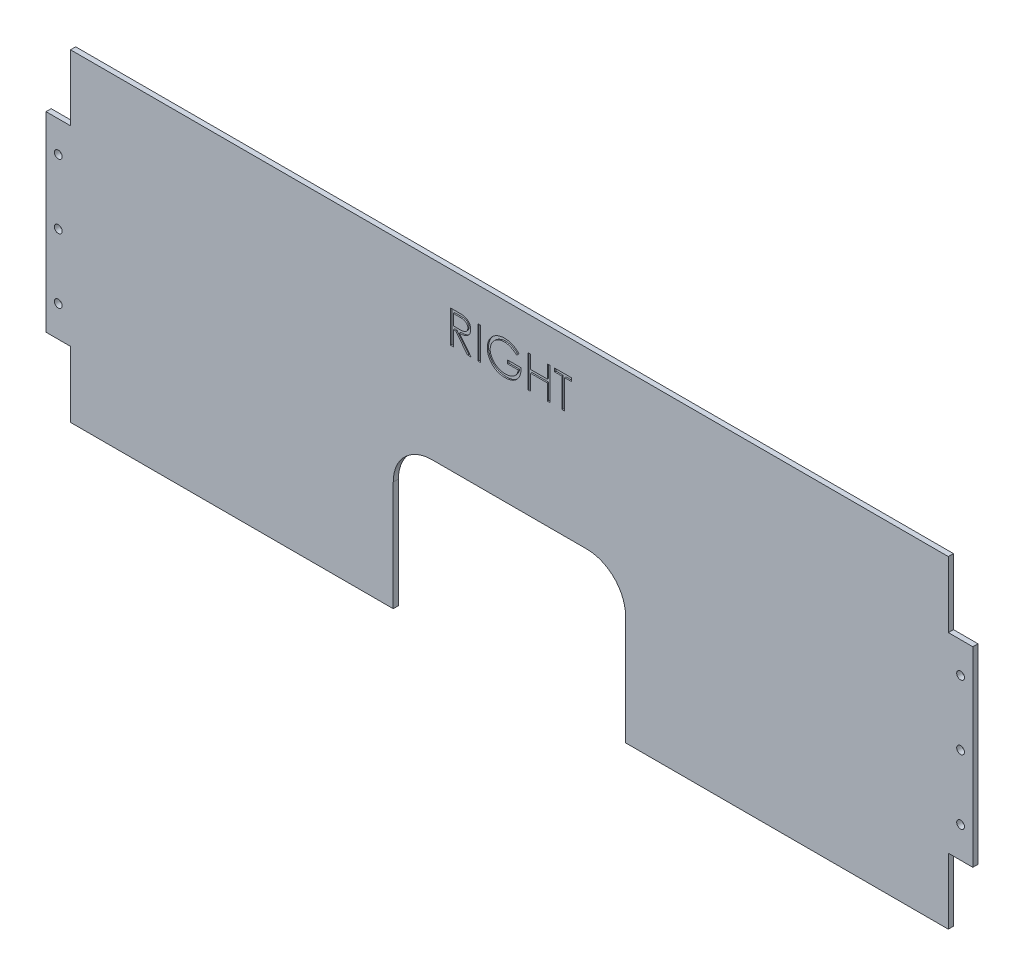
ISO-10303-21;
HEADER;
FILE_DESCRIPTION(('STEP AP214'),'2;1');
FILE_NAME('part.step','',(''),(''),'','','');
FILE_SCHEMA(('AUTOMOTIVE_DESIGN { 1 0 10303 214 1 1 1 1 }'));
ENDSEC;
DATA;
#1=APPLICATION_CONTEXT('core data for automotive mechanical design processes');
#2=APPLICATION_PROTOCOL_DEFINITION('international standard','automotive_design',2000,#1);
#3=PRODUCT_CONTEXT('',#1,'mechanical');
#4=PRODUCT('Part','Part','',(#3));
#5=PRODUCT_RELATED_PRODUCT_CATEGORY('part','',(#4));
#6=PRODUCT_DEFINITION_FORMATION('','',#4);
#7=PRODUCT_DEFINITION_CONTEXT('part definition',#1,'design');
#8=PRODUCT_DEFINITION('design','',#6,#7);
#9=PRODUCT_DEFINITION_SHAPE('','',#8);
#10=(LENGTH_UNIT() NAMED_UNIT(*) SI_UNIT(.MILLI.,.METRE.));
#11=(NAMED_UNIT(*) PLANE_ANGLE_UNIT() SI_UNIT($,.RADIAN.));
#12=(NAMED_UNIT(*) SI_UNIT($,.STERADIAN.) SOLID_ANGLE_UNIT());
#13=UNCERTAINTY_MEASURE_WITH_UNIT(LENGTH_MEASURE(1.E-05),#10,'distance_accuracy_value','');
#14=(GEOMETRIC_REPRESENTATION_CONTEXT(3) GLOBAL_UNCERTAINTY_ASSIGNED_CONTEXT((#13)) GLOBAL_UNIT_ASSIGNED_CONTEXT((#10,
#11,#12)) REPRESENTATION_CONTEXT('',''));
#15=CARTESIAN_POINT('',(0.,0.,0.));
#16=DIRECTION('',(0.,0.,1.));
#17=DIRECTION('',(1.,0.,0.));
#18=AXIS2_PLACEMENT_3D('',#15,#16,#17);
#19=CARTESIAN_POINT('',(0.,0.,4.));
#20=DIRECTION('',(0.,0.,-1.));
#21=DIRECTION('',(-1.,0.,0.));
#22=AXIS2_PLACEMENT_3D('',#19,#20,#21);
#23=PLANE('',#22);
#24=DIRECTION('',(0.,1.,0.));
#25=VECTOR('',#24,1.);
#26=CARTESIAN_POINT('',(-24.5192307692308,74.,4.));
#27=LINE('',#26,#25);
#28=CARTESIAN_POINT('',(-24.5192307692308,74.,4.));
#29=VERTEX_POINT('',#28);
#30=CARTESIAN_POINT('',(-24.5192307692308,99.,4.));
#31=VERTEX_POINT('',#30);
#32=EDGE_CURVE('E745',#29,#31,#27,.T.);
#33=ORIENTED_EDGE('',*,*,#32,.T.);
#34=DIRECTION('',(1.,0.,0.));
#35=VECTOR('',#34,1.);
#36=CARTESIAN_POINT('',(-24.5192307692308,99.,4.));
#37=LINE('',#36,#35);
#38=CARTESIAN_POINT('',(-22.2756410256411,99.,4.));
#39=VERTEX_POINT('',#38);
#40=EDGE_CURVE('E741',#31,#39,#37,.T.);
#41=ORIENTED_EDGE('',*,*,#40,.T.);
#42=DIRECTION('',(0.,-1.,0.));
#43=VECTOR('',#42,1.);
#44=CARTESIAN_POINT('',(-22.2756410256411,99.,4.));
#45=LINE('',#44,#43);
#46=CARTESIAN_POINT('',(-22.2756410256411,74.,4.));
#47=VERTEX_POINT('',#46);
#48=EDGE_CURVE('E736',#39,#47,#45,.T.);
#49=ORIENTED_EDGE('',*,*,#48,.T.);
#50=DIRECTION('',(-1.,0.,0.));
#51=VECTOR('',#50,1.);
#52=CARTESIAN_POINT('',(-22.2756410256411,74.,4.));
#53=LINE('',#52,#51);
#54=EDGE_CURVE('E732',#47,#29,#53,.T.);
#55=ORIENTED_EDGE('',*,*,#54,.T.);
#56=EDGE_LOOP('',(#33,#41,#49,#55));
#57=FACE_BOUND('',#56,.T.);
#58=DIRECTION('',(0.,1.,0.));
#59=VECTOR('',#58,1.);
#60=CARTESIAN_POINT('',(14.2628205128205,74.,4.));
#61=LINE('',#60,#59);
#62=CARTESIAN_POINT('',(14.2628205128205,74.,4.));
#63=VERTEX_POINT('',#62);
#64=CARTESIAN_POINT('',(14.2628205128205,99.,4.));
#65=VERTEX_POINT('',#64);
#66=EDGE_CURVE('E766',#63,#65,#61,.T.);
#67=ORIENTED_EDGE('',*,*,#66,.T.);
#68=DIRECTION('',(1.,0.,0.));
#69=VECTOR('',#68,1.);
#70=CARTESIAN_POINT('',(14.2628205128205,99.,4.));
#71=LINE('',#70,#69);
#72=CARTESIAN_POINT('',(16.5064102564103,99.,4.));
#73=VERTEX_POINT('',#72);
#74=EDGE_CURVE('E1468',#65,#73,#71,.T.);
#75=ORIENTED_EDGE('',*,*,#74,.T.);
#76=DIRECTION('',(0.,-1.,0.));
#77=VECTOR('',#76,1.);
#78=CARTESIAN_POINT('',(16.5064102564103,99.,4.));
#79=LINE('',#78,#77);
#80=CARTESIAN_POINT('',(16.5064102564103,88.7435897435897,4.));
#81=VERTEX_POINT('',#80);
#82=EDGE_CURVE('E1472',#73,#81,#79,.T.);
#83=ORIENTED_EDGE('',*,*,#82,.T.);
#84=DIRECTION('',(1.,0.,0.));
#85=VECTOR('',#84,1.);
#86=CARTESIAN_POINT('',(16.5064102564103,88.7435897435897,4.));
#87=LINE('',#86,#85);
#88=CARTESIAN_POINT('',(29.3269230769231,88.7435897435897,4.));
#89=VERTEX_POINT('',#88);
#90=EDGE_CURVE('E1476',#81,#89,#87,.T.);
#91=ORIENTED_EDGE('',*,*,#90,.T.);
#92=DIRECTION('',(0.,1.,0.));
#93=VECTOR('',#92,1.);
#94=CARTESIAN_POINT('',(29.3269230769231,88.7435897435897,4.));
#95=LINE('',#94,#93);
#96=CARTESIAN_POINT('',(29.3269230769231,99.,4.));
#97=VERTEX_POINT('',#96);
#98=EDGE_CURVE('E1480',#89,#97,#95,.T.);
#99=ORIENTED_EDGE('',*,*,#98,.T.);
#100=DIRECTION('',(1.,0.,0.));
#101=VECTOR('',#100,1.);
#102=CARTESIAN_POINT('',(29.3269230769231,99.,4.));
#103=LINE('',#102,#101);
#104=CARTESIAN_POINT('',(31.5705128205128,99.,4.));
#105=VERTEX_POINT('',#104);
#106=EDGE_CURVE('E1484',#97,#105,#103,.T.);
#107=ORIENTED_EDGE('',*,*,#106,.T.);
#108=DIRECTION('',(0.,-1.,0.));
#109=VECTOR('',#108,1.);
#110=CARTESIAN_POINT('',(31.5705128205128,99.,4.));
#111=LINE('',#110,#109);
#112=CARTESIAN_POINT('',(31.5705128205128,74.,4.));
#113=VERTEX_POINT('',#112);
#114=EDGE_CURVE('E1488',#105,#113,#111,.T.);
#115=ORIENTED_EDGE('',*,*,#114,.T.);
#116=DIRECTION('',(-1.,0.,0.));
#117=VECTOR('',#116,1.);
#118=CARTESIAN_POINT('',(31.5705128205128,74.,4.));
#119=LINE('',#118,#117);
#120=CARTESIAN_POINT('',(29.3269230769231,74.,4.));
#121=VERTEX_POINT('',#120);
#122=EDGE_CURVE('E1492',#113,#121,#119,.T.);
#123=ORIENTED_EDGE('',*,*,#122,.T.);
#124=DIRECTION('',(0.,1.,0.));
#125=VECTOR('',#124,1.);
#126=CARTESIAN_POINT('',(29.3269230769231,74.,4.));
#127=LINE('',#126,#125);
#128=CARTESIAN_POINT('',(29.3269230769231,86.1794871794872,4.));
#129=VERTEX_POINT('',#128);
#130=EDGE_CURVE('E1496',#121,#129,#127,.T.);
#131=ORIENTED_EDGE('',*,*,#130,.T.);
#132=DIRECTION('',(-1.,0.,0.));
#133=VECTOR('',#132,1.);
#134=CARTESIAN_POINT('',(29.3269230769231,86.1794871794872,4.));
#135=LINE('',#134,#133);
#136=CARTESIAN_POINT('',(16.5064102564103,86.1794871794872,4.));
#137=VERTEX_POINT('',#136);
#138=EDGE_CURVE('E1500',#129,#137,#135,.T.);
#139=ORIENTED_EDGE('',*,*,#138,.T.);
#140=DIRECTION('',(0.,-1.,0.));
#141=VECTOR('',#140,1.);
#142=CARTESIAN_POINT('',(16.5064102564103,86.1794871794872,4.));
#143=LINE('',#142,#141);
#144=CARTESIAN_POINT('',(16.5064102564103,74.,4.));
#145=VERTEX_POINT('',#144);
#146=EDGE_CURVE('E1504',#137,#145,#143,.T.);
#147=ORIENTED_EDGE('',*,*,#146,.T.);
#148=DIRECTION('',(-1.,0.,0.));
#149=VECTOR('',#148,1.);
#150=CARTESIAN_POINT('',(16.5064102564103,74.,4.));
#151=LINE('',#150,#149);
#152=EDGE_CURVE('E1430',#145,#63,#151,.T.);
#153=ORIENTED_EDGE('',*,*,#152,.T.);
#154=EDGE_LOOP('',(#67,#75,#83,#91,#99,#107,#115,#123,#131,#139,#147,#153));
#155=FACE_BOUND('',#154,.T.);
#156=DIRECTION('',(1.,0.,0.));
#157=VECTOR('',#156,1.);
#158=CARTESIAN_POINT('',(-340.,-125.,4.));
#159=LINE('',#158,#157);
#160=CARTESIAN_POINT('',(-340.,-125.,4.));
#161=VERTEX_POINT('',#160);
#162=CARTESIAN_POINT('',(-90.,-125.,4.));
#163=VERTEX_POINT('',#162);
#164=EDGE_CURVE('E1249',#161,#163,#159,.T.);
#165=ORIENTED_EDGE('',*,*,#164,.T.);
#166=DIRECTION('',(0.,-1.,0.));
#167=VECTOR('',#166,1.);
#168=CARTESIAN_POINT('',(-90.,-125.,4.));
#169=LINE('',#168,#167);
#170=CARTESIAN_POINT('',(-90.,-40.,4.));
#171=VERTEX_POINT('',#170);
#172=EDGE_CURVE('E715',#171,#163,#169,.T.);
#173=ORIENTED_EDGE('',*,*,#172,.F.);
#174=CARTESIAN_POINT('',(-60.,-40.,4.));
#175=DIRECTION('',(0.,0.,-1.));
#176=DIRECTION('',(-1.,0.,0.));
#177=AXIS2_PLACEMENT_3D('',#174,#175,#176);
#178=CIRCLE('',#177,30.);
#179=CARTESIAN_POINT('',(-60.,-9.99999999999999,4.));
#180=VERTEX_POINT('',#179);
#181=EDGE_CURVE('E54',#171,#180,#178,.T.);
#182=ORIENTED_EDGE('',*,*,#181,.T.);
#183=DIRECTION('',(-1.,0.,0.));
#184=VECTOR('',#183,1.);
#185=CARTESIAN_POINT('',(-90.,-9.99999999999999,4.));
#186=LINE('',#185,#184);
#187=CARTESIAN_POINT('',(59.9999999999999,-9.99999999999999,4.));
#188=VERTEX_POINT('',#187);
#189=EDGE_CURVE('E1324',#188,#180,#186,.T.);
#190=ORIENTED_EDGE('',*,*,#189,.F.);
#191=CARTESIAN_POINT('',(60.,-40.,4.));
#192=DIRECTION('',(0.,0.,-1.));
#193=DIRECTION('',(-1.,0.,0.));
#194=AXIS2_PLACEMENT_3D('',#191,#192,#193);
#195=CIRCLE('',#194,30.);
#196=CARTESIAN_POINT('',(90.,-40.,4.));
#197=VERTEX_POINT('',#196);
#198=EDGE_CURVE('E1125',#188,#197,#195,.T.);
#199=ORIENTED_EDGE('',*,*,#198,.T.);
#200=DIRECTION('',(0.,1.,0.));
#201=VECTOR('',#200,1.);
#202=CARTESIAN_POINT('',(90.,-125.,4.));
#203=LINE('',#202,#201);
#204=CARTESIAN_POINT('',(90.,-125.,4.));
#205=VERTEX_POINT('',#204);
#206=EDGE_CURVE('E1329',#205,#197,#203,.T.);
#207=ORIENTED_EDGE('',*,*,#206,.F.);
#208=CARTESIAN_POINT('',(340.,-125.,4.));
#209=VERTEX_POINT('',#208);
#210=EDGE_CURVE('E1253',#205,#209,#159,.T.);
#211=ORIENTED_EDGE('',*,*,#210,.T.);
#212=DIRECTION('',(0.,1.,0.));
#213=VECTOR('',#212,1.);
#214=CARTESIAN_POINT('',(340.,-74.,4.));
#215=LINE('',#214,#213);
#216=CARTESIAN_POINT('',(340.,-74.,4.));
#217=VERTEX_POINT('',#216);
#218=EDGE_CURVE('E1246',#209,#217,#215,.T.);
#219=ORIENTED_EDGE('',*,*,#218,.T.);
#220=DIRECTION('',(1.,0.,0.));
#221=VECTOR('',#220,1.);
#222=CARTESIAN_POINT('',(359.,-74.,4.));
#223=LINE('',#222,#221);
#224=CARTESIAN_POINT('',(359.,-74.,4.));
#225=VERTEX_POINT('',#224);
#226=EDGE_CURVE('E1243',#217,#225,#223,.T.);
#227=ORIENTED_EDGE('',*,*,#226,.T.);
#228=DIRECTION('',(0.,1.,0.));
#229=VECTOR('',#228,1.);
#230=CARTESIAN_POINT('',(359.,74.,4.));
#231=LINE('',#230,#229);
#232=CARTESIAN_POINT('',(359.,74.,4.));
#233=VERTEX_POINT('',#232);
#234=EDGE_CURVE('E1240',#225,#233,#231,.T.);
#235=ORIENTED_EDGE('',*,*,#234,.T.);
#236=DIRECTION('',(-1.,0.,0.));
#237=VECTOR('',#236,1.);
#238=CARTESIAN_POINT('',(340.,74.,4.));
#239=LINE('',#238,#237);
#240=CARTESIAN_POINT('',(340.,74.,4.));
#241=VERTEX_POINT('',#240);
#242=EDGE_CURVE('E1237',#233,#241,#239,.T.);
#243=ORIENTED_EDGE('',*,*,#242,.T.);
#244=DIRECTION('',(0.,1.,0.));
#245=VECTOR('',#244,1.);
#246=CARTESIAN_POINT('',(340.,125.,4.));
#247=LINE('',#246,#245);
#248=CARTESIAN_POINT('',(340.,125.,4.));
#249=VERTEX_POINT('',#248);
#250=EDGE_CURVE('E1234',#241,#249,#247,.T.);
#251=ORIENTED_EDGE('',*,*,#250,.T.);
#252=DIRECTION('',(-1.,0.,0.));
#253=VECTOR('',#252,1.);
#254=CARTESIAN_POINT('',(340.,125.,4.));
#255=LINE('',#254,#253);
#256=CARTESIAN_POINT('',(-340.,125.,4.));
#257=VERTEX_POINT('',#256);
#258=EDGE_CURVE('E1190',#249,#257,#255,.T.);
#259=ORIENTED_EDGE('',*,*,#258,.T.);
#260=DIRECTION('',(0.,-1.,0.));
#261=VECTOR('',#260,1.);
#262=CARTESIAN_POINT('',(-340.,125.,4.));
#263=LINE('',#262,#261);
#264=CARTESIAN_POINT('',(-340.,74.,4.));
#265=VERTEX_POINT('',#264);
#266=EDGE_CURVE('E1194',#257,#265,#263,.T.);
#267=ORIENTED_EDGE('',*,*,#266,.T.);
#268=DIRECTION('',(-1.,0.,0.));
#269=VECTOR('',#268,1.);
#270=CARTESIAN_POINT('',(-340.,74.,4.));
#271=LINE('',#270,#269);
#272=CARTESIAN_POINT('',(-359.,74.,4.));
#273=VERTEX_POINT('',#272);
#274=EDGE_CURVE('E1263',#265,#273,#271,.T.);
#275=ORIENTED_EDGE('',*,*,#274,.T.);
#276=DIRECTION('',(0.,-1.,0.));
#277=VECTOR('',#276,1.);
#278=CARTESIAN_POINT('',(-359.,74.,4.));
#279=LINE('',#278,#277);
#280=CARTESIAN_POINT('',(-359.,-74.,4.));
#281=VERTEX_POINT('',#280);
#282=EDGE_CURVE('E1260',#273,#281,#279,.T.);
#283=ORIENTED_EDGE('',*,*,#282,.T.);
#284=DIRECTION('',(1.,0.,0.));
#285=VECTOR('',#284,1.);
#286=CARTESIAN_POINT('',(-359.,-74.,4.));
#287=LINE('',#286,#285);
#288=CARTESIAN_POINT('',(-340.,-74.,4.));
#289=VERTEX_POINT('',#288);
#290=EDGE_CURVE('E1257',#281,#289,#287,.T.);
#291=ORIENTED_EDGE('',*,*,#290,.T.);
#292=DIRECTION('',(0.,-1.,0.));
#293=VECTOR('',#292,1.);
#294=CARTESIAN_POINT('',(-340.,-74.,4.));
#295=LINE('',#294,#293);
#296=EDGE_CURVE('E1254',#289,#161,#295,.T.);
#297=ORIENTED_EDGE('',*,*,#296,.T.);
#298=EDGE_LOOP('',(#165,#173,#182,#190,#199,#207,#211,#219,#227,#235,#243,#251,#259,#267,#275,
#283,#291,#297));
#299=FACE_BOUND('',#298,.T.);
#300=CARTESIAN_POINT('',(-349.5,50.,4.));
#301=DIRECTION('',(0.,0.,1.));
#302=DIRECTION('',(1.,0.,0.));
#303=AXIS2_PLACEMENT_3D('',#300,#301,#302);
#304=CIRCLE('',#303,2.99999999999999);
#305=CARTESIAN_POINT('',(-346.5,50.,4.));
#306=VERTEX_POINT('',#305);
#307=EDGE_CURVE('E1269',#306,#306,#304,.T.);
#308=ORIENTED_EDGE('',*,*,#307,.F.);
#309=EDGE_LOOP('',(#308));
#310=FACE_BOUND('',#309,.T.);
#311=CARTESIAN_POINT('',(-349.5,-50.,4.));
#312=DIRECTION('',(0.,0.,1.));
#313=DIRECTION('',(1.,0.,0.));
#314=AXIS2_PLACEMENT_3D('',#311,#312,#313);
#315=CIRCLE('',#314,2.99999999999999);
#316=CARTESIAN_POINT('',(-346.5,-50.,4.));
#317=VERTEX_POINT('',#316);
#318=EDGE_CURVE('E1273',#317,#317,#315,.T.);
#319=ORIENTED_EDGE('',*,*,#318,.F.);
#320=EDGE_LOOP('',(#319));
#321=FACE_BOUND('',#320,.T.);
#322=CARTESIAN_POINT('',(-349.5,0.,4.));
#323=DIRECTION('',(0.,0.,1.));
#324=DIRECTION('',(1.,0.,0.));
#325=AXIS2_PLACEMENT_3D('',#322,#323,#324);
#326=CIRCLE('',#325,2.99999999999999);
#327=CARTESIAN_POINT('',(-346.5,0.,4.));
#328=VERTEX_POINT('',#327);
#329=EDGE_CURVE('E1306',#328,#328,#326,.T.);
#330=ORIENTED_EDGE('',*,*,#329,.F.);
#331=EDGE_LOOP('',(#330));
#332=FACE_BOUND('',#331,.T.);
#333=CARTESIAN_POINT('',(349.5,0.,4.));
#334=DIRECTION('',(0.,0.,1.));
#335=DIRECTION('',(-1.,0.,0.));
#336=AXIS2_PLACEMENT_3D('',#333,#334,#335);
#337=CIRCLE('',#336,2.99999999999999);
#338=CARTESIAN_POINT('',(346.5,0.,4.));
#339=VERTEX_POINT('',#338);
#340=EDGE_CURVE('E1298',#339,#339,#337,.T.);
#341=ORIENTED_EDGE('',*,*,#340,.F.);
#342=EDGE_LOOP('',(#341));
#343=FACE_BOUND('',#342,.T.);
#344=CARTESIAN_POINT('',(349.5,-49.9999999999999,4.));
#345=DIRECTION('',(0.,0.,1.));
#346=DIRECTION('',(-1.,0.,0.));
#347=AXIS2_PLACEMENT_3D('',#344,#345,#346);
#348=CIRCLE('',#347,2.99999999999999);
#349=CARTESIAN_POINT('',(346.5,-49.9999999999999,4.));
#350=VERTEX_POINT('',#349);
#351=EDGE_CURVE('E1290',#350,#350,#348,.T.);
#352=ORIENTED_EDGE('',*,*,#351,.F.);
#353=EDGE_LOOP('',(#352));
#354=FACE_BOUND('',#353,.T.);
#355=CARTESIAN_POINT('',(349.5,50.0000000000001,4.));
#356=DIRECTION('',(0.,0.,1.));
#357=DIRECTION('',(-1.,0.,0.));
#358=AXIS2_PLACEMENT_3D('',#355,#356,#357);
#359=CIRCLE('',#358,2.99999999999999);
#360=CARTESIAN_POINT('',(346.5,50.0000000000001,4.));
#361=VERTEX_POINT('',#360);
#362=EDGE_CURVE('E1281',#361,#361,#359,.T.);
#363=ORIENTED_EDGE('',*,*,#362,.F.);
#364=EDGE_LOOP('',(#363));
#365=FACE_BOUND('',#364,.T.);
#366=DIRECTION('',(-1.,0.,0.));
#367=VECTOR('',#366,1.);
#368=CARTESIAN_POINT('',(40.5448717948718,96.4358974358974,4.));
#369=LINE('',#368,#367);
#370=CARTESIAN_POINT('',(40.5448717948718,96.4358974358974,4.));
#371=VERTEX_POINT('',#370);
#372=CARTESIAN_POINT('',(35.0961538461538,96.4358974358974,4.));
#373=VERTEX_POINT('',#372);
#374=EDGE_CURVE('E1369',#371,#373,#369,.T.);
#375=ORIENTED_EDGE('',*,*,#374,.T.);
#376=DIRECTION('',(0.,1.,0.));
#377=VECTOR('',#376,1.);
#378=CARTESIAN_POINT('',(35.0961538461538,96.4358974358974,4.));
#379=LINE('',#378,#377);
#380=CARTESIAN_POINT('',(35.0961538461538,99.,4.));
#381=VERTEX_POINT('',#380);
#382=EDGE_CURVE('E1374',#373,#381,#379,.T.);
#383=ORIENTED_EDGE('',*,*,#382,.T.);
#384=DIRECTION('',(1.,0.,0.));
#385=VECTOR('',#384,1.);
#386=CARTESIAN_POINT('',(35.0961538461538,99.,4.));
#387=LINE('',#386,#385);
#388=CARTESIAN_POINT('',(48.2371794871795,99.,4.));
#389=VERTEX_POINT('',#388);
#390=EDGE_CURVE('E1378',#381,#389,#387,.T.);
#391=ORIENTED_EDGE('',*,*,#390,.T.);
#392=DIRECTION('',(0.,-1.,0.));
#393=VECTOR('',#392,1.);
#394=CARTESIAN_POINT('',(48.2371794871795,99.,4.));
#395=LINE('',#394,#393);
#396=CARTESIAN_POINT('',(48.2371794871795,96.4358974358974,4.));
#397=VERTEX_POINT('',#396);
#398=EDGE_CURVE('E1382',#389,#397,#395,.T.);
#399=ORIENTED_EDGE('',*,*,#398,.T.);
#400=DIRECTION('',(-1.,0.,0.));
#401=VECTOR('',#400,1.);
#402=CARTESIAN_POINT('',(48.2371794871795,96.4358974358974,4.));
#403=LINE('',#402,#401);
#404=CARTESIAN_POINT('',(42.7884615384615,96.4358974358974,4.));
#405=VERTEX_POINT('',#404);
#406=EDGE_CURVE('E1386',#397,#405,#403,.T.);
#407=ORIENTED_EDGE('',*,*,#406,.T.);
#408=DIRECTION('',(0.,-1.,0.));
#409=VECTOR('',#408,1.);
#410=CARTESIAN_POINT('',(42.7884615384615,96.4358974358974,4.));
#411=LINE('',#410,#409);
#412=CARTESIAN_POINT('',(42.7884615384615,74.,4.));
#413=VERTEX_POINT('',#412);
#414=EDGE_CURVE('E1390',#405,#413,#411,.T.);
#415=ORIENTED_EDGE('',*,*,#414,.T.);
#416=DIRECTION('',(-1.,0.,0.));
#417=VECTOR('',#416,1.);
#418=CARTESIAN_POINT('',(42.7884615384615,74.,4.));
#419=LINE('',#418,#417);
#420=CARTESIAN_POINT('',(40.5448717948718,74.,4.));
#421=VERTEX_POINT('',#420);
#422=EDGE_CURVE('E1394',#413,#421,#419,.T.);
#423=ORIENTED_EDGE('',*,*,#422,.T.);
#424=DIRECTION('',(0.,1.,0.));
#425=VECTOR('',#424,1.);
#426=CARTESIAN_POINT('',(40.5448717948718,74.,4.));
#427=LINE('',#426,#425);
#428=EDGE_CURVE('E1346',#421,#371,#427,.T.);
#429=ORIENTED_EDGE('',*,*,#428,.T.);
#430=EDGE_LOOP('',(#375,#383,#391,#399,#407,#415,#423,#429));
#431=FACE_BOUND('',#430,.T.);
#432=CARTESIAN_POINT('',(-3.70092147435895,99.6410256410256,4.));
#433=CARTESIAN_POINT('',(-3.44207687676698,99.6368864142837,4.));
#434=CARTESIAN_POINT('',(-2.92881845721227,99.6286788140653,4.));
#435=CARTESIAN_POINT('',(-2.16506322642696,99.5717884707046,4.));
#436=CARTESIAN_POINT('',(-1.41311312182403,99.4816178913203,4.));
#437=CARTESIAN_POINT('',(-0.671853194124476,99.3585694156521,4.));
#438=CARTESIAN_POINT('',(0.0561922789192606,99.1909716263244,4.));
#439=CARTESIAN_POINT('',(0.773097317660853,98.990412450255,4.));
#440=CARTESIAN_POINT('',(1.47990114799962,98.7568994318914,4.));
#441=CARTESIAN_POINT('',(2.17438864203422,98.4784076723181,4.));
#442=CARTESIAN_POINT('',(2.86122947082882,98.16231035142,4.));
#443=CARTESIAN_POINT('',(3.54424261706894,97.8065001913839,4.));
#444=CARTESIAN_POINT('',(4.22109437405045,97.4048930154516,4.));
#445=CARTESIAN_POINT('',(4.89295852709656,96.9562963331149,4.));
#446=CARTESIAN_POINT('',(5.56407179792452,96.4684147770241,4.));
#447=CARTESIAN_POINT('',(6.22381924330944,95.9272946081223,4.));
#448=CARTESIAN_POINT('',(6.88812598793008,95.3542749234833,4.));
#449=CARTESIAN_POINT('',(7.31528180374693,94.9422593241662,4.));
#450=CARTESIAN_POINT('',(7.53205128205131,94.7331730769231,4.));
#451=B_SPLINE_CURVE_WITH_KNOTS('',3,(#432,#433,#434,#435,#436,#437,#438,#439,#440,#441,#442,
#443,#444,#445,#446,#447,#448,#449,#450),.UNSPECIFIED.,.F.,.F.,(4,1,1,1,1,1,1,1,1,1,1,1,1,1,1,1,
4),(0.,0.0616169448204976,0.122179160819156,0.182216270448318,0.241864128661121,
0.300960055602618,0.359969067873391,0.419032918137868,0.478068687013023,0.53799258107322,
0.598960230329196,0.661321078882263,0.725247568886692,0.791220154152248,0.858745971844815,
0.928317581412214,1.),.UNSPECIFIED.);
#452=CARTESIAN_POINT('',(-3.70092147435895,99.6410256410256,4.));
#453=VERTEX_POINT('',#452);
#454=CARTESIAN_POINT('',(7.53205128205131,94.7331730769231,4.));
#455=VERTEX_POINT('',#454);
#456=EDGE_CURVE('E721',#453,#455,#451,.T.);
#457=ORIENTED_EDGE('',*,*,#456,.T.);
#458=DIRECTION('',(-0.725753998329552,-0.687954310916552,0.));
#459=VECTOR('',#458,1.);
#460=CARTESIAN_POINT('',(7.53205128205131,94.7331730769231,4.));
#461=LINE('',#460,#459);
#462=CARTESIAN_POINT('',(5.60897435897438,92.9102564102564,4.));
#463=VERTEX_POINT('',#462);
#464=EDGE_CURVE('E886',#455,#463,#461,.T.);
#465=ORIENTED_EDGE('',*,*,#464,.T.);
#466=CARTESIAN_POINT('',(5.60897435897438,92.9102564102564,4.));
#467=CARTESIAN_POINT('',(5.26098230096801,93.2376197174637,4.));
#468=CARTESIAN_POINT('',(4.5732962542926,93.8845401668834,4.));
#469=CARTESIAN_POINT('',(3.45215166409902,94.7239044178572,4.));
#470=CARTESIAN_POINT('',(2.28241142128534,95.4429479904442,4.));
#471=CARTESIAN_POINT('',(1.07017930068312,96.0279925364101,4.));
#472=CARTESIAN_POINT('',(-0.154524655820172,96.4947979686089,4.));
#473=CARTESIAN_POINT('',(-1.37544448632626,96.8271418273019,4.));
#474=CARTESIAN_POINT('',(-2.58005663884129,97.0390885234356,4.));
#475=CARTESIAN_POINT('',(-3.38125105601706,97.0644340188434,4.));
#476=CARTESIAN_POINT('',(-3.77604166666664,97.0769230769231,4.));
#477=B_SPLINE_CURVE_WITH_KNOTS('',3,(#466,#467,#468,#469,#470,#471,#472,#473,#474,#475,#476),
.UNSPECIFIED.,.F.,.F.,(4,1,1,1,1,1,1,1,4),(0.,0.136144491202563,0.269042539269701,
0.398516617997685,0.527099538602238,0.652282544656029,0.771680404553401,0.887494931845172,1.),.UNSPECIFIED.);
#478=CARTESIAN_POINT('',(-3.77604166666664,97.0769230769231,4.));
#479=VERTEX_POINT('',#478);
#480=EDGE_CURVE('E877',#463,#479,#477,.T.);
#481=ORIENTED_EDGE('',*,*,#480,.T.);
#482=CARTESIAN_POINT('',(-3.77604166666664,97.0769230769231,4.));
#483=CARTESIAN_POINT('',(-4.01828952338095,97.0739687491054,4.));
#484=CARTESIAN_POINT('',(-4.50215695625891,97.06806775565,4.));
#485=CARTESIAN_POINT('',(-5.22088512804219,96.9927519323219,4.));
#486=CARTESIAN_POINT('',(-5.93207539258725,96.8844314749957,4.));
#487=CARTESIAN_POINT('',(-6.63438521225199,96.7277037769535,4.));
#488=CARTESIAN_POINT('',(-7.32918011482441,96.5290676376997,4.));
#489=CARTESIAN_POINT('',(-8.01404363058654,96.2806000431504,4.));
#490=CARTESIAN_POINT('',(-8.69025330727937,95.9909197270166,4.));
#491=CARTESIAN_POINT('',(-9.35143960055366,95.6561877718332,4.));
#492=CARTESIAN_POINT('',(-9.99244319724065,95.2884745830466,4.));
#493=CARTESIAN_POINT('',(-10.5978491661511,94.8809850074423,4.));
#494=CARTESIAN_POINT('',(-11.1715163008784,94.4467793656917,4.));
#495=CARTESIAN_POINT('',(-11.7026621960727,93.9749866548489,4.));
#496=CARTESIAN_POINT('',(-12.1943421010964,93.4698804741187,4.));
#497=CARTESIAN_POINT('',(-12.6582590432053,92.9408568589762,4.));
#498=CARTESIAN_POINT('',(-13.0780968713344,92.3734624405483,4.));
#499=CARTESIAN_POINT('',(-13.4573194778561,91.7781365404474,4.));
#500=CARTESIAN_POINT('',(-13.7956167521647,91.1653351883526,4.));
#501=CARTESIAN_POINT('',(-14.0942499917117,90.5409566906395,4.));
#502=CARTESIAN_POINT('',(-14.3449434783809,89.9070720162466,4.));
#503=CARTESIAN_POINT('',(-14.5432967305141,89.262885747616,4.));
#504=CARTESIAN_POINT('',(-14.7069442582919,88.6133815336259,4.));
#505=CARTESIAN_POINT('',(-14.822070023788,87.9540621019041,4.));
#506=CARTESIAN_POINT('',(-14.8869751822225,87.2842214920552,4.));
#507=CARTESIAN_POINT('',(-14.898202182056,86.8356696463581,4.));
#508=CARTESIAN_POINT('',(-14.9038461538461,86.6101762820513,4.));
#509=B_SPLINE_CURVE_WITH_KNOTS('',3,(#482,#483,#484,#485,#486,#487,#488,#489,#490,#491,#492,
#493,#494,#495,#496,#497,#498,#499,#500,#501,#502,#503,#504,#505,#506,#507,#508),.UNSPECIFIED.,
.F.,.F.,(4,1,1,1,1,1,1,1,1,1,1,1,1,1,1,1,1,1,1,1,1,1,1,1,4),(0.,0.0428411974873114,
0.0855712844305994,0.127718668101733,0.170068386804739,0.2127872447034,0.255481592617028,
0.298877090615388,0.342860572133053,0.386527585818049,0.429532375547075,0.471886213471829,
0.513729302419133,0.555081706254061,0.596535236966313,0.638120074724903,0.679822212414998,
0.721331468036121,0.761888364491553,0.802199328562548,0.841806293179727,0.881060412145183,
0.920633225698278,0.960101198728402,1.),.UNSPECIFIED.);
#510=CARTESIAN_POINT('',(-14.9038461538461,86.6101762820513,4.));
#511=VERTEX_POINT('',#510);
#512=EDGE_CURVE('E868',#479,#511,#509,.T.);
#513=ORIENTED_EDGE('',*,*,#512,.T.);
#514=CARTESIAN_POINT('',(-14.9038461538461,86.6101762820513,4.));
#515=CARTESIAN_POINT('',(-14.8984481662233,86.3796704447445,4.));
#516=CARTESIAN_POINT('',(-14.8876669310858,85.9192882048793,4.));
#517=CARTESIAN_POINT('',(-14.8186646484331,85.2321876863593,4.));
#518=CARTESIAN_POINT('',(-14.6906057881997,84.5552919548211,4.));
#519=CARTESIAN_POINT('',(-14.5194078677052,83.8863767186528,4.));
#520=CARTESIAN_POINT('',(-14.3052591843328,83.2242963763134,4.));
#521=CARTESIAN_POINT('',(-14.038311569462,82.5719213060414,4.));
#522=CARTESIAN_POINT('',(-13.7221287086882,81.9292756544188,4.));
#523=CARTESIAN_POINT('',(-13.3561533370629,81.3021498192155,4.));
#524=CARTESIAN_POINT('',(-12.9548233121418,80.6912710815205,4.));
#525=CARTESIAN_POINT('',(-12.5052298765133,80.115845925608,4.));
#526=CARTESIAN_POINT('',(-12.0276542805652,79.568211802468,4.));
#527=CARTESIAN_POINT('',(-11.5046978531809,79.0605277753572,4.));
#528=CARTESIAN_POINT('',(-10.9531296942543,78.5792142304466,4.));
#529=CARTESIAN_POINT('',(-10.3564705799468,78.1375319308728,4.));
#530=CARTESIAN_POINT('',(-9.72645300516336,77.7269731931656,4.));
#531=CARTESIAN_POINT('',(-9.0621157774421,77.3527123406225,4.));
#532=CARTESIAN_POINT('',(-8.37066733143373,77.0183656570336,4.));
#533=CARTESIAN_POINT('',(-7.66169052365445,76.7210521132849,4.));
#534=CARTESIAN_POINT('',(-6.93292041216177,76.4761997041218,4.));
#535=CARTESIAN_POINT('',(-6.18818691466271,76.2766418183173,4.));
#536=CARTESIAN_POINT('',(-5.4283778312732,76.113068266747,4.));
#537=CARTESIAN_POINT('',(-4.64963638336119,76.0078362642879,4.));
#538=CARTESIAN_POINT('',(-3.85768846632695,75.9314731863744,4.));
#539=CARTESIAN_POINT('',(-3.32384109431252,75.9258898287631,4.));
#540=CARTESIAN_POINT('',(-3.0548878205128,75.9230769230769,4.));
#541=B_SPLINE_CURVE_WITH_KNOTS('',3,(#514,#515,#516,#517,#518,#519,#520,#521,#522,#523,#524,
#525,#526,#527,#528,#529,#530,#531,#532,#533,#534,#535,#536,#537,#538,#539,#540),.UNSPECIFIED.,
.F.,.F.,(4,1,1,1,1,1,1,1,1,1,1,1,1,1,1,1,1,1,1,1,1,1,1,1,4),(0.,0.0389942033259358,
0.0778819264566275,0.116651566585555,0.15541606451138,0.194618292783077,0.234261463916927,
0.274547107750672,0.315667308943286,0.357019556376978,0.398082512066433,0.43909786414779,
0.479833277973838,0.521274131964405,0.562840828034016,0.60529206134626,0.648408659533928,
0.691727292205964,0.735148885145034,0.778368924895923,0.821660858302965,0.865523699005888,
0.909731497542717,0.954522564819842,1.),.UNSPECIFIED.);
#542=CARTESIAN_POINT('',(-3.0548878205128,75.9230769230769,4.));
#543=VERTEX_POINT('',#542);
#544=EDGE_CURVE('E859',#511,#543,#541,.T.);
#545=ORIENTED_EDGE('',*,*,#544,.T.);
#546=CARTESIAN_POINT('',(-3.0548878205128,75.9230769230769,4.));
#547=CARTESIAN_POINT('',(-2.73075676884,75.9298524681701,4.));
#548=CARTESIAN_POINT('',(-2.09427278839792,75.9431573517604,4.));
#549=CARTESIAN_POINT('',(-1.15865534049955,76.0467308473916,4.));
#550=CARTESIAN_POINT('',(-0.260061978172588,76.2084936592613,4.));
#551=CARTESIAN_POINT('',(0.598982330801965,76.4453929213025,4.));
#552=CARTESIAN_POINT('',(1.41947533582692,76.7475620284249,4.));
#553=CARTESIAN_POINT('',(2.20442491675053,77.1118147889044,4.));
#554=CARTESIAN_POINT('',(2.94765104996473,77.552122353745,4.));
#555=CARTESIAN_POINT('',(3.65138800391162,78.0490785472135,4.));
#556=CARTESIAN_POINT('',(4.29965361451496,78.6027559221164,4.));
#557=CARTESIAN_POINT('',(4.88432592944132,79.2002163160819,4.));
#558=CARTESIAN_POINT('',(5.39607942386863,79.8385596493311,4.));
#559=CARTESIAN_POINT('',(5.84254156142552,80.5140261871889,4.));
#560=CARTESIAN_POINT('',(6.21188909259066,81.2322069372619,4.));
#561=CARTESIAN_POINT('',(6.51505191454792,81.9895823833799,4.));
#562=CARTESIAN_POINT('',(6.74743256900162,82.7864931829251,4.));
#563=CARTESIAN_POINT('',(6.84282524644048,83.3371476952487,4.));
#564=CARTESIAN_POINT('',(6.89102564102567,83.6153846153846,4.));
#565=B_SPLINE_CURVE_WITH_KNOTS('',3,(#546,#547,#548,#549,#550,#551,#552,#553,#554,#555,#556,
#557,#558,#559,#560,#561,#562,#563,#564),.UNSPECIFIED.,.F.,.F.,(4,1,1,1,1,1,1,1,1,1,1,1,1,1,1,1,
4),(0.,0.0706300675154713,0.138693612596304,0.204917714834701,0.269440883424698,
0.332636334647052,0.395301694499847,0.457763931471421,0.520657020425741,0.582851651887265,
0.643315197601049,0.702580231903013,0.760907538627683,0.819489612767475,0.878269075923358,
0.93849131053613,1.),.UNSPECIFIED.);
#566=CARTESIAN_POINT('',(6.89102564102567,83.6153846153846,4.));
#567=VERTEX_POINT('',#566);
#568=EDGE_CURVE('E853',#543,#567,#565,.T.);
#569=ORIENTED_EDGE('',*,*,#568,.T.);
#570=DIRECTION('',(-1.,0.,0.));
#571=VECTOR('',#570,1.);
#572=CARTESIAN_POINT('',(6.89102564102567,83.6153846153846,4.));
#573=LINE('',#572,#571);
#574=CARTESIAN_POINT('',(-1.44230769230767,83.6153846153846,4.));
#575=VERTEX_POINT('',#574);
#576=EDGE_CURVE('E849',#567,#575,#573,.T.);
#577=ORIENTED_EDGE('',*,*,#576,.T.);
#578=DIRECTION('',(0.,1.,0.));
#579=VECTOR('',#578,1.);
#580=CARTESIAN_POINT('',(-1.44230769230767,83.6153846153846,4.));
#581=LINE('',#580,#579);
#582=CARTESIAN_POINT('',(-1.44230769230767,86.1794871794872,4.));
#583=VERTEX_POINT('',#582);
#584=EDGE_CURVE('E845',#575,#583,#581,.T.);
#585=ORIENTED_EDGE('',*,*,#584,.T.);
#586=DIRECTION('',(1.,0.,0.));
#587=VECTOR('',#586,1.);
#588=CARTESIAN_POINT('',(-1.44230769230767,86.1794871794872,4.));
#589=LINE('',#588,#587);
#590=CARTESIAN_POINT('',(9.13461538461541,86.1794871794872,4.));
#591=VERTEX_POINT('',#590);
#592=EDGE_CURVE('E838',#583,#591,#589,.T.);
#593=ORIENTED_EDGE('',*,*,#592,.T.);
#594=CARTESIAN_POINT('',(9.13461538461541,86.1794871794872,4.));
#595=CARTESIAN_POINT('',(9.1224307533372,85.7015765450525,4.));
#596=CARTESIAN_POINT('',(9.09858322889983,84.7662191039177,4.));
#597=CARTESIAN_POINT('',(8.9313052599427,83.4021457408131,4.));
#598=CARTESIAN_POINT('',(8.66118731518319,82.1137765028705,4.));
#599=CARTESIAN_POINT('',(8.29218508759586,80.8997545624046,4.));
#600=CARTESIAN_POINT('',(7.81450451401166,79.7618003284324,4.));
#601=CARTESIAN_POINT('',(7.23327216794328,78.698758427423,4.));
#602=CARTESIAN_POINT('',(6.53918558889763,77.7174964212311,4.));
#603=CARTESIAN_POINT('',(5.75696814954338,76.8100035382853,4.));
#604=CARTESIAN_POINT('',(4.87911130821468,76.000509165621,4.));
#605=CARTESIAN_POINT('',(3.92933545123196,75.2890381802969,4.));
#606=CARTESIAN_POINT('',(2.90607139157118,74.6897337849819,4.));
#607=CARTESIAN_POINT('',(1.81028705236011,74.2021576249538,4.));
#608=CARTESIAN_POINT('',(0.645569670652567,73.8216290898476,4.));
#609=CARTESIAN_POINT('',(-0.590775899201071,73.5518321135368,4.));
#610=CARTESIAN_POINT('',(-1.89707304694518,73.3901895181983,4.));
#611=CARTESIAN_POINT('',(-2.79233502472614,73.3695368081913,4.));
#612=CARTESIAN_POINT('',(-3.25020032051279,73.3589743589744,4.));
#613=B_SPLINE_CURVE_WITH_KNOTS('',3,(#594,#595,#596,#597,#598,#599,#600,#601,#602,#603,#604,
#605,#606,#607,#608,#609,#610,#611,#612),.UNSPECIFIED.,.F.,.F.,(4,1,1,1,1,1,1,1,1,1,1,1,1,1,1,1,
4),(0.,0.0712722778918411,0.139492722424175,0.204635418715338,0.267405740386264,
0.328445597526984,0.388397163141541,0.447733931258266,0.507391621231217,0.566767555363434,
0.625478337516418,0.684066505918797,0.743248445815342,0.804033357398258,0.866498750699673,
0.931723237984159,1.),.UNSPECIFIED.);
#614=CARTESIAN_POINT('',(-3.25020032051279,73.3589743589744,4.));
#615=VERTEX_POINT('',#614);
#616=EDGE_CURVE('E829',#591,#615,#613,.T.);
#617=ORIENTED_EDGE('',*,*,#616,.T.);
#618=CARTESIAN_POINT('',(-3.25020032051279,73.3589743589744,4.));
#619=CARTESIAN_POINT('',(-3.53241557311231,73.3630395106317,4.));
#620=CARTESIAN_POINT('',(-4.089035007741,73.3710572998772,4.));
#621=CARTESIAN_POINT('',(-4.91111306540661,73.4280383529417,4.));
#622=CARTESIAN_POINT('',(-5.71052464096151,73.5157567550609,4.));
#623=CARTESIAN_POINT('',(-6.48715327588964,73.6482219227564,4.));
#624=CARTESIAN_POINT('',(-7.24385572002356,73.8104694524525,4.));
#625=CARTESIAN_POINT('',(-7.97685275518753,74.0182317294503,4.));
#626=CARTESIAN_POINT('',(-8.68893662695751,74.2587224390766,4.));
#627=CARTESIAN_POINT('',(-9.38120795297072,74.5322629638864,4.));
#628=CARTESIAN_POINT('',(-10.0473832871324,74.8492033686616,4.));
#629=CARTESIAN_POINT('',(-10.6904298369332,75.2014150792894,4.));
#630=CARTESIAN_POINT('',(-11.313902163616,75.5870819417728,4.));
#631=CARTESIAN_POINT('',(-11.9135533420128,76.0128736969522,4.));
#632=CARTESIAN_POINT('',(-12.4925077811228,76.4756055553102,4.));
#633=CARTESIAN_POINT('',(-13.0470323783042,76.976204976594,4.));
#634=CARTESIAN_POINT('',(-13.5802315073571,77.5131415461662,4.));
#635=CARTESIAN_POINT('',(-13.9142348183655,77.894420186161,4.));
#636=CARTESIAN_POINT('',(-14.082532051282,78.0865384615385,4.));
#637=B_SPLINE_CURVE_WITH_KNOTS('',3,(#618,#619,#620,#621,#622,#623,#624,#625,#626,#627,#628,
#629,#630,#631,#632,#633,#634,#635,#636),.UNSPECIFIED.,.F.,.F.,(4,1,1,1,1,1,1,1,1,1,1,1,1,1,1,1,
4),(0.,0.0692365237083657,0.136556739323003,0.202094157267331,0.266464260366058,
0.329768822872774,0.391878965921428,0.453270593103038,0.514114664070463,0.574389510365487,
0.634141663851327,0.693923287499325,0.754152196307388,0.814470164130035,0.875660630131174,
0.937348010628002,1.),.UNSPECIFIED.);
#638=CARTESIAN_POINT('',(-14.082532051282,78.0865384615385,4.));
#639=VERTEX_POINT('',#638);
#640=EDGE_CURVE('E820',#615,#639,#637,.T.);
#641=ORIENTED_EDGE('',*,*,#640,.T.);
#642=CARTESIAN_POINT('',(-14.082532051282,78.0865384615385,4.));
#643=CARTESIAN_POINT('',(-14.3267172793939,78.3913288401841,4.));
#644=CARTESIAN_POINT('',(-14.8110345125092,78.9958503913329,4.));
#645=CARTESIAN_POINT('',(-15.4344499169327,79.9644214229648,4.));
#646=CARTESIAN_POINT('',(-15.965888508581,80.9672918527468,4.));
#647=CARTESIAN_POINT('',(-16.3970872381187,82.0072534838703,4.));
#648=CARTESIAN_POINT('',(-16.7337878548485,83.0833335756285,4.));
#649=CARTESIAN_POINT('',(-16.9752610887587,84.1941570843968,4.));
#650=CARTESIAN_POINT('',(-17.1167417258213,85.3411544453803,4.));
#651=CARTESIAN_POINT('',(-17.1371241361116,86.1173349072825,4.));
#652=CARTESIAN_POINT('',(-17.1474358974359,86.510016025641,4.));
#653=B_SPLINE_CURVE_WITH_KNOTS('',3,(#642,#643,#644,#645,#646,#647,#648,#649,#650,#651,#652),
.UNSPECIFIED.,.F.,.F.,(4,1,1,1,1,1,1,1,4),(0.,0.127895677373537,0.25366841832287,
0.37673843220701,0.499344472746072,0.62199930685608,0.745698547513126,0.871345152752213,1.),.UNSPECIFIED.);
#654=CARTESIAN_POINT('',(-17.1474358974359,86.510016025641,4.));
#655=VERTEX_POINT('',#654);
#656=EDGE_CURVE('E810',#639,#655,#653,.T.);
#657=ORIENTED_EDGE('',*,*,#656,.T.);
#658=CARTESIAN_POINT('',(-17.1474358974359,86.510016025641,4.));
#659=CARTESIAN_POINT('',(-17.143634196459,86.804060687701,4.));
#660=CARTESIAN_POINT('',(-17.1360791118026,87.3884128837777,4.));
#661=CARTESIAN_POINT('',(-17.044468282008,88.2559650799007,4.));
#662=CARTESIAN_POINT('',(-16.91302958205,89.1081128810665,4.));
#663=CARTESIAN_POINT('',(-16.7198363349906,89.9441597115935,4.));
#664=CARTESIAN_POINT('',(-16.4762915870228,90.7646639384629,4.));
#665=CARTESIAN_POINT('',(-16.1723381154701,91.5700065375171,4.));
#666=CARTESIAN_POINT('',(-15.8184460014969,92.3606627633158,4.));
#667=CARTESIAN_POINT('',(-15.407121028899,93.1311903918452,4.));
#668=CARTESIAN_POINT('',(-14.949374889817,93.8713647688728,4.));
#669=CARTESIAN_POINT('',(-14.4525876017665,94.578206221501,4.));
#670=CARTESIAN_POINT('',(-13.9097047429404,95.2388423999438,4.));
#671=CARTESIAN_POINT('',(-13.3295918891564,95.8616398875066,4.));
#672=CARTESIAN_POINT('',(-12.7053276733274,96.438774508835,4.));
#673=CARTESIAN_POINT('',(-12.0427603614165,96.9755895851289,4.));
#674=CARTESIAN_POINT('',(-11.3413793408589,97.4728051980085,4.));
#675=CARTESIAN_POINT('',(-10.5989780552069,97.9225897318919,4.));
#676=CARTESIAN_POINT('',(-9.82663745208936,98.3266155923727,4.));
#677=CARTESIAN_POINT('',(-9.026208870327,98.6808242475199,4.));
#678=CARTESIAN_POINT('',(-8.197936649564,98.9735622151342,4.));
#679=CARTESIAN_POINT('',(-7.34802609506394,99.2219463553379,4.));
#680=CARTESIAN_POINT('',(-6.47004394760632,99.4056259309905,4.));
#681=CARTESIAN_POINT('',(-5.57036154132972,99.5388312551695,4.));
#682=CARTESIAN_POINT('',(-4.6442893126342,99.6299783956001,4.));
#683=CARTESIAN_POINT('',(-4.01831767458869,99.6373087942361,4.));
#684=CARTESIAN_POINT('',(-3.70092147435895,99.6410256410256,4.));
#685=B_SPLINE_CURVE_WITH_KNOTS('',3,(#658,#659,#660,#661,#662,#663,#664,#665,#666,#667,#668,
#669,#670,#671,#672,#673,#674,#675,#676,#677,#678,#679,#680,#681,#682,#683,#684),.UNSPECIFIED.,
.F.,.F.,(4,1,1,1,1,1,1,1,1,1,1,1,1,1,1,1,1,1,1,1,1,1,1,1,4),(0.,0.0420393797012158,
0.0835444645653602,0.124643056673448,0.165303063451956,0.206170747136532,0.246970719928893,
0.288329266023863,0.329986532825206,0.371797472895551,0.412737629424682,0.453459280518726,
0.494001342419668,0.534380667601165,0.574951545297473,0.615891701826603,0.657249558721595,
0.699006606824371,0.740486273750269,0.782325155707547,0.82456745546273,0.867041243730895,
0.910499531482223,0.954619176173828,1.),.UNSPECIFIED.);
#686=EDGE_CURVE('E804',#655,#453,#685,.T.);
#687=ORIENTED_EDGE('',*,*,#686,.T.);
#688=EDGE_LOOP('',(#457,#465,#481,#513,#545,#569,#577,#585,#593,#617,#641,#657,#687));
#689=FACE_BOUND('',#688,.T.);
#690=DIRECTION('',(0.,1.,0.));
#691=VECTOR('',#690,1.);
#692=CARTESIAN_POINT('',(-45.6730769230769,74.,4.));
#693=LINE('',#692,#691);
#694=CARTESIAN_POINT('',(-45.6730769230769,74.,4.));
#695=VERTEX_POINT('',#694);
#696=CARTESIAN_POINT('',(-45.6730769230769,99.,4.));
#697=VERTEX_POINT('',#696);
#698=EDGE_CURVE('E61',#695,#697,#693,.T.);
#699=ORIENTED_EDGE('',*,*,#698,.T.);
#700=DIRECTION('',(1.,0.,0.));
#701=VECTOR('',#700,1.);
#702=CARTESIAN_POINT('',(-45.6730769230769,99.,4.));
#703=LINE('',#702,#701);
#704=CARTESIAN_POINT('',(-40.6700721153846,99.,4.));
#705=VERTEX_POINT('',#704);
#706=EDGE_CURVE('E627',#697,#705,#703,.T.);
#707=ORIENTED_EDGE('',*,*,#706,.T.);
#708=CARTESIAN_POINT('',(-40.6700721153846,99.,4.));
#709=CARTESIAN_POINT('',(-40.3362069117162,98.998888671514,4.));
#710=CARTESIAN_POINT('',(-39.6951487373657,98.9967547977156,4.));
#711=CARTESIAN_POINT('',(-38.7767682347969,98.9848564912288,4.));
#712=CARTESIAN_POINT('',(-37.9422889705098,98.9507539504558,4.));
#713=CARTESIAN_POINT('',(-37.1921472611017,98.9214069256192,4.));
#714=CARTESIAN_POINT('',(-36.5263568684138,98.8678930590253,4.));
#715=CARTESIAN_POINT('',(-35.9428762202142,98.8167455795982,4.));
#716=CARTESIAN_POINT('',(-35.4443926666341,98.7497908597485,4.));
#717=CARTESIAN_POINT('',(-35.1426365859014,98.6876092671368,4.));
#718=CARTESIAN_POINT('',(-35.0060096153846,98.6594551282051,4.));
#719=B_SPLINE_CURVE_WITH_KNOTS('',3,(#708,#709,#710,#711,#712,#713,#714,#715,#716,#717,#718),
.UNSPECIFIED.,.F.,.F.,(4,1,1,1,1,1,1,1,4),(0.,0.1762577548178,0.338434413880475,
0.484822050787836,0.617157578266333,0.734698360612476,0.837385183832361,0.926372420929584,1.),.UNSPECIFIED.);
#720=CARTESIAN_POINT('',(-35.0060096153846,98.6594551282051,4.));
#721=VERTEX_POINT('',#720);
#722=EDGE_CURVE('E631',#705,#721,#719,.T.);
#723=ORIENTED_EDGE('',*,*,#722,.T.);
#724=CARTESIAN_POINT('',(-35.0060096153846,98.6594551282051,4.));
#725=CARTESIAN_POINT('',(-34.8231051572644,98.6142639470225,4.));
#726=CARTESIAN_POINT('',(-34.4611980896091,98.5248456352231,4.));
#727=CARTESIAN_POINT('',(-33.9401261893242,98.3358484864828,4.));
#728=CARTESIAN_POINT('',(-33.4435953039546,98.1171368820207,4.));
#729=CARTESIAN_POINT('',(-32.9736679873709,97.860253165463,4.));
#730=CARTESIAN_POINT('',(-32.5326980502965,97.5632904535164,4.));
#731=CARTESIAN_POINT('',(-32.1161386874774,97.2313752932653,4.));
#732=CARTESIAN_POINT('',(-31.7220996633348,96.8663238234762,4.));
#733=CARTESIAN_POINT('',(-31.3665165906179,96.4589320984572,4.));
#734=CARTESIAN_POINT('',(-31.0312376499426,96.0315284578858,4.));
#735=CARTESIAN_POINT('',(-30.748461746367,95.5693587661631,4.));
#736=CARTESIAN_POINT('',(-30.5047011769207,95.0860621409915,4.));
#737=CARTESIAN_POINT('',(-30.310626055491,94.5767234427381,4.));
#738=CARTESIAN_POINT('',(-30.1543548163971,94.0462822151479,4.));
#739=CARTESIAN_POINT('',(-30.0441673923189,93.4899336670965,4.));
#740=CARTESIAN_POINT('',(-29.9780874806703,92.9102124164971,4.));
#741=CARTESIAN_POINT('',(-29.9713599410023,92.5147987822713,4.));
#742=CARTESIAN_POINT('',(-29.9679487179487,92.3143028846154,4.));
#743=B_SPLINE_CURVE_WITH_KNOTS('',3,(#724,#725,#726,#727,#728,#729,#730,#731,#732,#733,#734,
#735,#736,#737,#738,#739,#740,#741,#742),.UNSPECIFIED.,.F.,.F.,(4,1,1,1,1,1,1,1,1,1,1,1,1,1,1,1,
4),(0.,0.0642168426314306,0.127063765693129,0.18874453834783,0.249132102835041,
0.309452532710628,0.369826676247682,0.430650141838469,0.492351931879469,0.554072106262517,
0.615689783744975,0.676797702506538,0.738439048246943,0.801316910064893,0.865184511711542,
0.931641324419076,1.),.UNSPECIFIED.);
#744=CARTESIAN_POINT('',(-29.9679487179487,92.3143028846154,4.));
#745=VERTEX_POINT('',#744);
#746=EDGE_CURVE('E637',#721,#745,#743,.T.);
#747=ORIENTED_EDGE('',*,*,#746,.T.);
#748=CARTESIAN_POINT('',(-29.9679487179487,92.3143028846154,4.));
#749=CARTESIAN_POINT('',(-29.9784415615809,91.9811949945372,4.));
#750=CARTESIAN_POINT('',(-29.9989158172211,91.3312152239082,4.));
#751=CARTESIAN_POINT('',(-30.1898094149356,90.3879232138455,4.));
#752=CARTESIAN_POINT('',(-30.5024988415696,89.5079995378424,4.));
#753=CARTESIAN_POINT('',(-30.9333794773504,88.6925521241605,4.));
#754=CARTESIAN_POINT('',(-31.482090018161,87.9574760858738,4.));
#755=CARTESIAN_POINT('',(-32.1415528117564,87.3118299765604,4.));
#756=CARTESIAN_POINT('',(-32.9121357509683,86.771544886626,4.));
#757=CARTESIAN_POINT('',(-33.6294880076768,86.396881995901,4.));
#758=CARTESIAN_POINT('',(-34.2631608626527,86.1569326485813,4.));
#759=CARTESIAN_POINT('',(-34.7848273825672,85.9881015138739,4.));
#760=CARTESIAN_POINT('',(-35.3538772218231,85.8576589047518,4.));
#761=CARTESIAN_POINT('',(-35.9648581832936,85.7408008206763,4.));
#762=CARTESIAN_POINT('',(-36.6203128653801,85.6525744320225,4.));
#763=CARTESIAN_POINT('',(-37.3186702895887,85.5879559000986,4.));
#764=CARTESIAN_POINT('',(-38.0604285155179,85.547569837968,4.));
#765=CARTESIAN_POINT('',(-38.5699932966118,85.5415555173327,4.));
#766=CARTESIAN_POINT('',(-38.8321314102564,85.5384615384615,4.));
#767=B_SPLINE_CURVE_WITH_KNOTS('',3,(#748,#749,#750,#751,#752,#753,#754,#755,#756,#757,#758,
#759,#760,#761,#762,#763,#764,#765,#766),.UNSPECIFIED.,.F.,.F.,(4,1,1,1,1,1,1,1,1,1,1,1,1,1,1,1,
4),(0.,0.0787802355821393,0.153720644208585,0.226713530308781,0.299191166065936,
0.371189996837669,0.44300641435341,0.516689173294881,0.593217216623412,0.633872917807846,
0.676989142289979,0.722899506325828,0.771958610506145,0.824211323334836,0.879378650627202,
0.937948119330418,1.),.UNSPECIFIED.);
#768=CARTESIAN_POINT('',(-38.8321314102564,85.5384615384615,4.));
#769=VERTEX_POINT('',#768);
#770=EDGE_CURVE('E646',#745,#769,#767,.T.);
#771=ORIENTED_EDGE('',*,*,#770,.T.);
#772=DIRECTION('',(0.622788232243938,-0.782390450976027,0.));
#773=VECTOR('',#772,1.);
#774=CARTESIAN_POINT('',(-38.8321314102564,85.5384615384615,4.));
#775=LINE('',#774,#773);
#776=CARTESIAN_POINT('',(-29.6474358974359,74.,4.));
#777=VERTEX_POINT('',#776);
#778=EDGE_CURVE('E655',#769,#777,#775,.T.);
#779=ORIENTED_EDGE('',*,*,#778,.T.);
#780=DIRECTION('',(-1.,0.,0.));
#781=VECTOR('',#780,1.);
#782=CARTESIAN_POINT('',(-29.6474358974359,74.,4.));
#783=LINE('',#782,#781);
#784=CARTESIAN_POINT('',(-32.421875,74.,4.));
#785=VERTEX_POINT('',#784);
#786=EDGE_CURVE('E662',#777,#785,#783,.T.);
#787=ORIENTED_EDGE('',*,*,#786,.T.);
#788=DIRECTION('',(-0.622788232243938,0.782390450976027,0.));
#789=VECTOR('',#788,1.);
#790=CARTESIAN_POINT('',(-32.421875,74.,4.));
#791=LINE('',#790,#789);
#792=CARTESIAN_POINT('',(-41.6065705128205,85.5384615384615,4.));
#793=VERTEX_POINT('',#792);
#794=EDGE_CURVE('E666',#785,#793,#791,.T.);
#795=ORIENTED_EDGE('',*,*,#794,.T.);
#796=DIRECTION('',(-1.,0.,0.));
#797=VECTOR('',#796,1.);
#798=CARTESIAN_POINT('',(-41.6065705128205,85.5384615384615,4.));
#799=LINE('',#798,#797);
#800=CARTESIAN_POINT('',(-43.4294871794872,85.5384615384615,4.));
#801=VERTEX_POINT('',#800);
#802=EDGE_CURVE('E670',#793,#801,#799,.T.);
#803=ORIENTED_EDGE('',*,*,#802,.T.);
#804=DIRECTION('',(0.,-1.,0.));
#805=VECTOR('',#804,1.);
#806=CARTESIAN_POINT('',(-43.4294871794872,85.5384615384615,4.));
#807=LINE('',#806,#805);
#808=CARTESIAN_POINT('',(-43.4294871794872,74.,4.));
#809=VERTEX_POINT('',#808);
#810=EDGE_CURVE('E674',#801,#809,#807,.T.);
#811=ORIENTED_EDGE('',*,*,#810,.T.);
#812=DIRECTION('',(-1.,0.,0.));
#813=VECTOR('',#812,1.);
#814=CARTESIAN_POINT('',(-43.4294871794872,74.,4.));
#815=LINE('',#814,#813);
#816=EDGE_CURVE('E678',#809,#695,#815,.T.);
#817=ORIENTED_EDGE('',*,*,#816,.T.);
#818=EDGE_LOOP('',(#699,#707,#723,#747,#771,#779,#787,#795,#803,#811,#817));
#819=FACE_BOUND('',#818,.T.);
#820=ADVANCED_FACE('F45',(#57,#155,#299,#310,#321,#332,#343,#354,#365,#431,#689,#819),#23,.F.);
#821=CARTESIAN_POINT('',(-340.,-125.,4.));
#822=DIRECTION('',(0.,1.,0.));
#823=DIRECTION('',(0.,0.,1.));
#824=AXIS2_PLACEMENT_3D('',#821,#822,#823);
#825=PLANE('',#824);
#826=DIRECTION('',(1.,0.,0.));
#827=VECTOR('',#826,1.);
#828=CARTESIAN_POINT('',(-340.,-125.,0.));
#829=LINE('',#828,#827);
#830=CARTESIAN_POINT('',(-340.,-125.,0.));
#831=VERTEX_POINT('',#830);
#832=CARTESIAN_POINT('',(-90.,-125.,0.));
#833=VERTEX_POINT('',#832);
#834=EDGE_CURVE('E1210',#831,#833,#829,.T.);
#835=ORIENTED_EDGE('',*,*,#834,.T.);
#836=DIRECTION('',(0.,0.,1.));
#837=VECTOR('',#836,1.);
#838=CARTESIAN_POINT('',(-90.,-125.,0.));
#839=LINE('',#838,#837);
#840=EDGE_CURVE('E1317',#833,#163,#839,.T.);
#841=ORIENTED_EDGE('',*,*,#840,.T.);
#842=ORIENTED_EDGE('',*,*,#164,.F.);
#843=DIRECTION('',(0.,0.,-1.));
#844=VECTOR('',#843,1.);
#845=CARTESIAN_POINT('',(-340.,-125.,4.));
#846=LINE('',#845,#844);
#847=EDGE_CURVE('E1158',#161,#831,#846,.T.);
#848=ORIENTED_EDGE('',*,*,#847,.T.);
#849=EDGE_LOOP('',(#835,#841,#842,#848));
#850=FACE_BOUND('',#849,.T.);
#851=ADVANCED_FACE('F1056',(#850),#825,.F.);
#852=CARTESIAN_POINT('',(-340.,125.,4.));
#853=DIRECTION('',(1.,0.,0.));
#854=DIRECTION('',(0.,1.,0.));
#855=AXIS2_PLACEMENT_3D('',#852,#853,#854);
#856=PLANE('',#855);
#857=DIRECTION('',(0.,-1.,0.));
#858=VECTOR('',#857,1.);
#859=CARTESIAN_POINT('',(-340.,125.,0.));
#860=LINE('',#859,#858);
#861=CARTESIAN_POINT('',(-340.,125.,0.));
#862=VERTEX_POINT('',#861);
#863=CARTESIAN_POINT('',(-340.,74.,0.));
#864=VERTEX_POINT('',#863);
#865=EDGE_CURVE('E1227',#862,#864,#860,.T.);
#866=ORIENTED_EDGE('',*,*,#865,.T.);
#867=DIRECTION('',(0.,0.,-1.));
#868=VECTOR('',#867,1.);
#869=CARTESIAN_POINT('',(-340.,74.,4.));
#870=LINE('',#869,#868);
#871=EDGE_CURVE('E1142',#265,#864,#870,.T.);
#872=ORIENTED_EDGE('',*,*,#871,.F.);
#873=ORIENTED_EDGE('',*,*,#266,.F.);
#874=DIRECTION('',(0.,0.,-1.));
#875=VECTOR('',#874,1.);
#876=CARTESIAN_POINT('',(-340.,125.,4.));
#877=LINE('',#876,#875);
#878=EDGE_CURVE('E1186',#257,#862,#877,.T.);
#879=ORIENTED_EDGE('',*,*,#878,.T.);
#880=EDGE_LOOP('',(#866,#872,#873,#879));
#881=FACE_BOUND('',#880,.T.);
#882=ADVANCED_FACE('F1104',(#881),#856,.F.);
#883=CARTESIAN_POINT('',(-340.,74.,4.));
#884=DIRECTION('',(0.,-1.,0.));
#885=DIRECTION('',(0.,0.,-1.));
#886=AXIS2_PLACEMENT_3D('',#883,#884,#885);
#887=PLANE('',#886);
#888=DIRECTION('',(-1.,0.,0.));
#889=VECTOR('',#888,1.);
#890=CARTESIAN_POINT('',(-340.,74.,0.));
#891=LINE('',#890,#889);
#892=CARTESIAN_POINT('',(-359.,74.,0.));
#893=VERTEX_POINT('',#892);
#894=EDGE_CURVE('E1224',#864,#893,#891,.T.);
#895=ORIENTED_EDGE('',*,*,#894,.T.);
#896=DIRECTION('',(0.,0.,-1.));
#897=VECTOR('',#896,1.);
#898=CARTESIAN_POINT('',(-359.,74.,4.));
#899=LINE('',#898,#897);
#900=EDGE_CURVE('E1146',#273,#893,#899,.T.);
#901=ORIENTED_EDGE('',*,*,#900,.F.);
#902=ORIENTED_EDGE('',*,*,#274,.F.);
#903=ORIENTED_EDGE('',*,*,#871,.T.);
#904=EDGE_LOOP('',(#895,#901,#902,#903));
#905=FACE_BOUND('',#904,.T.);
#906=ADVANCED_FACE('F1100',(#905),#887,.F.);
#907=CARTESIAN_POINT('',(-359.,74.,4.));
#908=DIRECTION('',(1.,0.,0.));
#909=DIRECTION('',(0.,0.,-1.));
#910=AXIS2_PLACEMENT_3D('',#907,#908,#909);
#911=PLANE('',#910);
#912=DIRECTION('',(0.,-1.,0.));
#913=VECTOR('',#912,1.);
#914=CARTESIAN_POINT('',(-359.,74.,0.));
#915=LINE('',#914,#913);
#916=CARTESIAN_POINT('',(-359.,-74.,0.));
#917=VERTEX_POINT('',#916);
#918=EDGE_CURVE('E1221',#893,#917,#915,.T.);
#919=ORIENTED_EDGE('',*,*,#918,.T.);
#920=DIRECTION('',(0.,0.,-1.));
#921=VECTOR('',#920,1.);
#922=CARTESIAN_POINT('',(-359.,-74.,4.));
#923=LINE('',#922,#921);
#924=EDGE_CURVE('E1150',#281,#917,#923,.T.);
#925=ORIENTED_EDGE('',*,*,#924,.F.);
#926=ORIENTED_EDGE('',*,*,#282,.F.);
#927=ORIENTED_EDGE('',*,*,#900,.T.);
#928=EDGE_LOOP('',(#919,#925,#926,#927));
#929=FACE_BOUND('',#928,.T.);
#930=ADVANCED_FACE('F1096',(#929),#911,.F.);
#931=CARTESIAN_POINT('',(-359.,-74.,4.));
#932=DIRECTION('',(0.,1.,0.));
#933=DIRECTION('',(0.,0.,1.));
#934=AXIS2_PLACEMENT_3D('',#931,#932,#933);
#935=PLANE('',#934);
#936=DIRECTION('',(1.,0.,0.));
#937=VECTOR('',#936,1.);
#938=CARTESIAN_POINT('',(-359.,-74.,0.));
#939=LINE('',#938,#937);
#940=CARTESIAN_POINT('',(-340.,-74.,0.));
#941=VERTEX_POINT('',#940);
#942=EDGE_CURVE('E1218',#917,#941,#939,.T.);
#943=ORIENTED_EDGE('',*,*,#942,.T.);
#944=DIRECTION('',(0.,0.,-1.));
#945=VECTOR('',#944,1.);
#946=CARTESIAN_POINT('',(-340.,-74.,4.));
#947=LINE('',#946,#945);
#948=EDGE_CURVE('E1154',#289,#941,#947,.T.);
#949=ORIENTED_EDGE('',*,*,#948,.F.);
#950=ORIENTED_EDGE('',*,*,#290,.F.);
#951=ORIENTED_EDGE('',*,*,#924,.T.);
#952=EDGE_LOOP('',(#943,#949,#950,#951));
#953=FACE_BOUND('',#952,.T.);
#954=ADVANCED_FACE('F1092',(#953),#935,.F.);
#955=CARTESIAN_POINT('',(-340.,-74.,4.));
#956=DIRECTION('',(1.,0.,0.));
#957=DIRECTION('',(0.,1.,0.));
#958=AXIS2_PLACEMENT_3D('',#955,#956,#957);
#959=PLANE('',#958);
#960=DIRECTION('',(0.,-1.,0.));
#961=VECTOR('',#960,1.);
#962=CARTESIAN_POINT('',(-340.,-74.,0.));
#963=LINE('',#962,#961);
#964=EDGE_CURVE('E1215',#941,#831,#963,.T.);
#965=ORIENTED_EDGE('',*,*,#964,.T.);
#966=ORIENTED_EDGE('',*,*,#847,.F.);
#967=ORIENTED_EDGE('',*,*,#296,.F.);
#968=ORIENTED_EDGE('',*,*,#948,.T.);
#969=EDGE_LOOP('',(#965,#966,#967,#968));
#970=FACE_BOUND('',#969,.T.);
#971=ADVANCED_FACE('F1088',(#970),#959,.F.);
#972=ORIENTED_EDGE('',*,*,#210,.F.);
#973=DIRECTION('',(0.,0.,1.));
#974=VECTOR('',#973,1.);
#975=CARTESIAN_POINT('',(90.,-125.,0.));
#976=LINE('',#975,#974);
#977=CARTESIAN_POINT('',(90.,-125.,0.));
#978=VERTEX_POINT('',#977);
#979=EDGE_CURVE('E1282',#978,#205,#976,.T.);
#980=ORIENTED_EDGE('',*,*,#979,.F.);
#981=CARTESIAN_POINT('',(340.,-125.,0.));
#982=VERTEX_POINT('',#981);
#983=EDGE_CURVE('E1214',#978,#982,#829,.T.);
#984=ORIENTED_EDGE('',*,*,#983,.T.);
#985=DIRECTION('',(0.,0.,-1.));
#986=VECTOR('',#985,1.);
#987=CARTESIAN_POINT('',(340.,-125.,4.));
#988=LINE('',#987,#986);
#989=EDGE_CURVE('E1162',#209,#982,#988,.T.);
#990=ORIENTED_EDGE('',*,*,#989,.F.);
#991=EDGE_LOOP('',(#972,#980,#984,#990));
#992=FACE_BOUND('',#991,.T.);
#993=ADVANCED_FACE('F1084',(#992),#825,.F.);
#994=CARTESIAN_POINT('',(340.,-74.,4.));
#995=DIRECTION('',(-1.,0.,0.));
#996=DIRECTION('',(0.,-1.,0.));
#997=AXIS2_PLACEMENT_3D('',#994,#995,#996);
#998=PLANE('',#997);
#999=DIRECTION('',(0.,1.,0.));
#1000=VECTOR('',#999,1.);
#1001=CARTESIAN_POINT('',(340.,-74.,0.));
#1002=LINE('',#1001,#1000);
#1003=CARTESIAN_POINT('',(340.,-74.,0.));
#1004=VERTEX_POINT('',#1003);
#1005=EDGE_CURVE('E1207',#982,#1004,#1002,.T.);
#1006=ORIENTED_EDGE('',*,*,#1005,.T.);
#1007=DIRECTION('',(0.,0.,-1.));
#1008=VECTOR('',#1007,1.);
#1009=CARTESIAN_POINT('',(340.,-74.,4.));
#1010=LINE('',#1009,#1008);
#1011=EDGE_CURVE('E1166',#217,#1004,#1010,.T.);
#1012=ORIENTED_EDGE('',*,*,#1011,.F.);
#1013=ORIENTED_EDGE('',*,*,#218,.F.);
#1014=ORIENTED_EDGE('',*,*,#989,.T.);
#1015=EDGE_LOOP('',(#1006,#1012,#1013,#1014));
#1016=FACE_BOUND('',#1015,.T.);
#1017=ADVANCED_FACE('F1080',(#1016),#998,.F.);
#1018=CARTESIAN_POINT('',(359.,-74.,4.));
#1019=DIRECTION('',(0.,1.,0.));
#1020=DIRECTION('',(0.,0.,1.));
#1021=AXIS2_PLACEMENT_3D('',#1018,#1019,#1020);
#1022=PLANE('',#1021);
#1023=DIRECTION('',(1.,0.,0.));
#1024=VECTOR('',#1023,1.);
#1025=CARTESIAN_POINT('',(359.,-74.,0.));
#1026=LINE('',#1025,#1024);
#1027=CARTESIAN_POINT('',(359.,-74.,0.));
#1028=VERTEX_POINT('',#1027);
#1029=EDGE_CURVE('E1204',#1004,#1028,#1026,.T.);
#1030=ORIENTED_EDGE('',*,*,#1029,.T.);
#1031=DIRECTION('',(0.,0.,-1.));
#1032=VECTOR('',#1031,1.);
#1033=CARTESIAN_POINT('',(359.,-74.,4.));
#1034=LINE('',#1033,#1032);
#1035=EDGE_CURVE('E1170',#225,#1028,#1034,.T.);
#1036=ORIENTED_EDGE('',*,*,#1035,.F.);
#1037=ORIENTED_EDGE('',*,*,#226,.F.);
#1038=ORIENTED_EDGE('',*,*,#1011,.T.);
#1039=EDGE_LOOP('',(#1030,#1036,#1037,#1038));
#1040=FACE_BOUND('',#1039,.T.);
#1041=ADVANCED_FACE('F1076',(#1040),#1022,.F.);
#1042=CARTESIAN_POINT('',(359.,74.,4.));
#1043=DIRECTION('',(-1.,0.,0.));
#1044=DIRECTION('',(0.,0.,1.));
#1045=AXIS2_PLACEMENT_3D('',#1042,#1043,#1044);
#1046=PLANE('',#1045);
#1047=DIRECTION('',(0.,1.,0.));
#1048=VECTOR('',#1047,1.);
#1049=CARTESIAN_POINT('',(359.,74.,0.));
#1050=LINE('',#1049,#1048);
#1051=CARTESIAN_POINT('',(359.,74.,0.));
#1052=VERTEX_POINT('',#1051);
#1053=EDGE_CURVE('E1201',#1028,#1052,#1050,.T.);
#1054=ORIENTED_EDGE('',*,*,#1053,.T.);
#1055=DIRECTION('',(0.,0.,-1.));
#1056=VECTOR('',#1055,1.);
#1057=CARTESIAN_POINT('',(359.,74.,4.));
#1058=LINE('',#1057,#1056);
#1059=EDGE_CURVE('E1174',#233,#1052,#1058,.T.);
#1060=ORIENTED_EDGE('',*,*,#1059,.F.);
#1061=ORIENTED_EDGE('',*,*,#234,.F.);
#1062=ORIENTED_EDGE('',*,*,#1035,.T.);
#1063=EDGE_LOOP('',(#1054,#1060,#1061,#1062));
#1064=FACE_BOUND('',#1063,.T.);
#1065=ADVANCED_FACE('F1072',(#1064),#1046,.F.);
#1066=CARTESIAN_POINT('',(340.,74.,4.));
#1067=DIRECTION('',(0.,-1.,0.));
#1068=DIRECTION('',(0.,0.,-1.));
#1069=AXIS2_PLACEMENT_3D('',#1066,#1067,#1068);
#1070=PLANE('',#1069);
#1071=DIRECTION('',(-1.,0.,0.));
#1072=VECTOR('',#1071,1.);
#1073=CARTESIAN_POINT('',(340.,74.,0.));
#1074=LINE('',#1073,#1072);
#1075=CARTESIAN_POINT('',(340.,74.,0.));
#1076=VERTEX_POINT('',#1075);
#1077=EDGE_CURVE('E1198',#1052,#1076,#1074,.T.);
#1078=ORIENTED_EDGE('',*,*,#1077,.T.);
#1079=DIRECTION('',(0.,0.,-1.));
#1080=VECTOR('',#1079,1.);
#1081=CARTESIAN_POINT('',(340.,74.,4.));
#1082=LINE('',#1081,#1080);
#1083=EDGE_CURVE('E1178',#241,#1076,#1082,.T.);
#1084=ORIENTED_EDGE('',*,*,#1083,.F.);
#1085=ORIENTED_EDGE('',*,*,#242,.F.);
#1086=ORIENTED_EDGE('',*,*,#1059,.T.);
#1087=EDGE_LOOP('',(#1078,#1084,#1085,#1086));
#1088=FACE_BOUND('',#1087,.T.);
#1089=ADVANCED_FACE('F1068',(#1088),#1070,.F.);
#1090=CARTESIAN_POINT('',(340.,125.,4.));
#1091=DIRECTION('',(-1.,0.,0.));
#1092=DIRECTION('',(0.,-1.,0.));
#1093=AXIS2_PLACEMENT_3D('',#1090,#1091,#1092);
#1094=PLANE('',#1093);
#1095=DIRECTION('',(0.,1.,0.));
#1096=VECTOR('',#1095,1.);
#1097=CARTESIAN_POINT('',(340.,125.,0.));
#1098=LINE('',#1097,#1096);
#1099=CARTESIAN_POINT('',(340.,125.,0.));
#1100=VERTEX_POINT('',#1099);
#1101=EDGE_CURVE('E1195',#1076,#1100,#1098,.T.);
#1102=ORIENTED_EDGE('',*,*,#1101,.T.);
#1103=DIRECTION('',(0.,0.,-1.));
#1104=VECTOR('',#1103,1.);
#1105=CARTESIAN_POINT('',(340.,125.,4.));
#1106=LINE('',#1105,#1104);
#1107=EDGE_CURVE('E1182',#249,#1100,#1106,.T.);
#1108=ORIENTED_EDGE('',*,*,#1107,.F.);
#1109=ORIENTED_EDGE('',*,*,#250,.F.);
#1110=ORIENTED_EDGE('',*,*,#1083,.T.);
#1111=EDGE_LOOP('',(#1102,#1108,#1109,#1110));
#1112=FACE_BOUND('',#1111,.T.);
#1113=ADVANCED_FACE('F1064',(#1112),#1094,.F.);
#1114=CARTESIAN_POINT('',(340.,125.,4.));
#1115=DIRECTION('',(0.,-1.,0.));
#1116=DIRECTION('',(0.,0.,-1.));
#1117=AXIS2_PLACEMENT_3D('',#1114,#1115,#1116);
#1118=PLANE('',#1117);
#1119=DIRECTION('',(-1.,0.,0.));
#1120=VECTOR('',#1119,1.);
#1121=CARTESIAN_POINT('',(340.,125.,0.));
#1122=LINE('',#1121,#1120);
#1123=EDGE_CURVE('E1191',#1100,#862,#1122,.T.);
#1124=ORIENTED_EDGE('',*,*,#1123,.T.);
#1125=ORIENTED_EDGE('',*,*,#878,.F.);
#1126=ORIENTED_EDGE('',*,*,#258,.F.);
#1127=ORIENTED_EDGE('',*,*,#1107,.T.);
#1128=EDGE_LOOP('',(#1124,#1125,#1126,#1127));
#1129=FACE_BOUND('',#1128,.T.);
#1130=ADVANCED_FACE('F1060',(#1129),#1118,.F.);
#1131=CARTESIAN_POINT('',(0.,0.,0.));
#1132=DIRECTION('',(0.,0.,-1.));
#1133=DIRECTION('',(-1.,0.,0.));
#1134=AXIS2_PLACEMENT_3D('',#1131,#1132,#1133);
#1135=PLANE('',#1134);
#1136=DIRECTION('',(-1.,0.,0.));
#1137=VECTOR('',#1136,1.);
#1138=CARTESIAN_POINT('',(-90.,-9.99999999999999,0.));
#1139=LINE('',#1138,#1137);
#1140=CARTESIAN_POINT('',(59.9999999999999,-9.99999999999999,0.));
#1141=VERTEX_POINT('',#1140);
#1142=CARTESIAN_POINT('',(-60.,-9.99999999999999,0.));
#1143=VERTEX_POINT('',#1142);
#1144=EDGE_CURVE('E1321',#1141,#1143,#1139,.T.);
#1145=ORIENTED_EDGE('',*,*,#1144,.T.);
#1146=CARTESIAN_POINT('',(-60.,-40.,0.));
#1147=DIRECTION('',(0.,0.,-1.));
#1148=DIRECTION('',(-1.,0.,0.));
#1149=AXIS2_PLACEMENT_3D('',#1146,#1147,#1148);
#1150=CIRCLE('',#1149,30.);
#1151=CARTESIAN_POINT('',(-90.,-40.,0.));
#1152=VERTEX_POINT('',#1151);
#1153=EDGE_CURVE('E11',#1143,#1152,#1150,.F.);
#1154=ORIENTED_EDGE('',*,*,#1153,.T.);
#1155=DIRECTION('',(0.,-1.,0.));
#1156=VECTOR('',#1155,1.);
#1157=CARTESIAN_POINT('',(-90.,-125.,0.));
#1158=LINE('',#1157,#1156);
#1159=EDGE_CURVE('E1328',#1152,#833,#1158,.T.);
#1160=ORIENTED_EDGE('',*,*,#1159,.T.);
#1161=ORIENTED_EDGE('',*,*,#834,.F.);
#1162=ORIENTED_EDGE('',*,*,#964,.F.);
#1163=ORIENTED_EDGE('',*,*,#942,.F.);
#1164=ORIENTED_EDGE('',*,*,#918,.F.);
#1165=ORIENTED_EDGE('',*,*,#894,.F.);
#1166=ORIENTED_EDGE('',*,*,#865,.F.);
#1167=ORIENTED_EDGE('',*,*,#1123,.F.);
#1168=ORIENTED_EDGE('',*,*,#1101,.F.);
#1169=ORIENTED_EDGE('',*,*,#1077,.F.);
#1170=ORIENTED_EDGE('',*,*,#1053,.F.);
#1171=ORIENTED_EDGE('',*,*,#1029,.F.);
#1172=ORIENTED_EDGE('',*,*,#1005,.F.);
#1173=ORIENTED_EDGE('',*,*,#983,.F.);
#1174=DIRECTION('',(0.,1.,0.));
#1175=VECTOR('',#1174,1.);
#1176=CARTESIAN_POINT('',(90.,-125.,0.));
#1177=LINE('',#1176,#1175);
#1178=CARTESIAN_POINT('',(90.,-40.,0.));
#1179=VERTEX_POINT('',#1178);
#1180=EDGE_CURVE('E1337',#978,#1179,#1177,.T.);
#1181=ORIENTED_EDGE('',*,*,#1180,.T.);
#1182=CARTESIAN_POINT('',(60.,-40.,0.));
#1183=DIRECTION('',(0.,0.,-1.));
#1184=DIRECTION('',(-1.,0.,0.));
#1185=AXIS2_PLACEMENT_3D('',#1182,#1183,#1184);
#1186=CIRCLE('',#1185,30.);
#1187=EDGE_CURVE('E1117',#1179,#1141,#1186,.F.);
#1188=ORIENTED_EDGE('',*,*,#1187,.T.);
#1189=EDGE_LOOP('',(#1145,#1154,#1160,#1161,#1162,#1163,#1164,#1165,#1166,#1167,#1168,#1169,
#1170,#1171,#1172,#1173,#1181,#1188));
#1190=FACE_BOUND('',#1189,.T.);
#1191=CARTESIAN_POINT('',(349.5,50.0000000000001,0.));
#1192=DIRECTION('',(0.,0.,1.));
#1193=DIRECTION('',(-1.,0.,0.));
#1194=AXIS2_PLACEMENT_3D('',#1191,#1192,#1193);
#1195=CIRCLE('',#1194,2.99999999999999);
#1196=CARTESIAN_POINT('',(346.5,50.0000000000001,0.));
#1197=VERTEX_POINT('',#1196);
#1198=EDGE_CURVE('E1277',#1197,#1197,#1195,.T.);
#1199=ORIENTED_EDGE('',*,*,#1198,.T.);
#1200=EDGE_LOOP('',(#1199));
#1201=FACE_BOUND('',#1200,.T.);
#1202=CARTESIAN_POINT('',(349.5,-49.9999999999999,0.));
#1203=DIRECTION('',(0.,0.,1.));
#1204=DIRECTION('',(-1.,0.,0.));
#1205=AXIS2_PLACEMENT_3D('',#1202,#1203,#1204);
#1206=CIRCLE('',#1205,2.99999999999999);
#1207=CARTESIAN_POINT('',(346.5,-49.9999999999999,0.));
#1208=VERTEX_POINT('',#1207);
#1209=EDGE_CURVE('E1286',#1208,#1208,#1206,.T.);
#1210=ORIENTED_EDGE('',*,*,#1209,.T.);
#1211=EDGE_LOOP('',(#1210));
#1212=FACE_BOUND('',#1211,.T.);
#1213=CARTESIAN_POINT('',(349.5,0.,0.));
#1214=DIRECTION('',(0.,0.,1.));
#1215=DIRECTION('',(-1.,0.,0.));
#1216=AXIS2_PLACEMENT_3D('',#1213,#1214,#1215);
#1217=CIRCLE('',#1216,2.99999999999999);
#1218=CARTESIAN_POINT('',(346.5,0.,0.));
#1219=VERTEX_POINT('',#1218);
#1220=EDGE_CURVE('E1294',#1219,#1219,#1217,.T.);
#1221=ORIENTED_EDGE('',*,*,#1220,.T.);
#1222=EDGE_LOOP('',(#1221));
#1223=FACE_BOUND('',#1222,.T.);
#1224=CARTESIAN_POINT('',(-349.5,0.,0.));
#1225=DIRECTION('',(0.,0.,1.));
#1226=DIRECTION('',(1.,0.,0.));
#1227=AXIS2_PLACEMENT_3D('',#1224,#1225,#1226);
#1228=CIRCLE('',#1227,2.99999999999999);
#1229=CARTESIAN_POINT('',(-346.5,0.,0.));
#1230=VERTEX_POINT('',#1229);
#1231=EDGE_CURVE('E1302',#1230,#1230,#1228,.T.);
#1232=ORIENTED_EDGE('',*,*,#1231,.T.);
#1233=EDGE_LOOP('',(#1232));
#1234=FACE_BOUND('',#1233,.T.);
#1235=CARTESIAN_POINT('',(-349.5,-50.,0.));
#1236=DIRECTION('',(0.,0.,1.));
#1237=DIRECTION('',(1.,0.,0.));
#1238=AXIS2_PLACEMENT_3D('',#1235,#1236,#1237);
#1239=CIRCLE('',#1238,2.99999999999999);
#1240=CARTESIAN_POINT('',(-346.5,-50.,0.));
#1241=VERTEX_POINT('',#1240);
#1242=EDGE_CURVE('E1310',#1241,#1241,#1239,.T.);
#1243=ORIENTED_EDGE('',*,*,#1242,.T.);
#1244=EDGE_LOOP('',(#1243));
#1245=FACE_BOUND('',#1244,.T.);
#1246=CARTESIAN_POINT('',(-349.5,50.,0.));
#1247=DIRECTION('',(0.,0.,1.));
#1248=DIRECTION('',(1.,0.,0.));
#1249=AXIS2_PLACEMENT_3D('',#1246,#1247,#1248);
#1250=CIRCLE('',#1249,2.99999999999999);
#1251=CARTESIAN_POINT('',(-346.5,50.,0.));
#1252=VERTEX_POINT('',#1251);
#1253=EDGE_CURVE('E1231',#1252,#1252,#1250,.T.);
#1254=ORIENTED_EDGE('',*,*,#1253,.T.);
#1255=EDGE_LOOP('',(#1254));
#1256=FACE_BOUND('',#1255,.T.);
#1257=ADVANCED_FACE('F1052',(#1190,#1201,#1212,#1223,#1234,#1245,#1256),#1135,.T.);
#1258=CARTESIAN_POINT('',(-349.5,50.,0.));
#1259=DIRECTION('',(0.,0.,1.));
#1260=DIRECTION('',(1.,0.,0.));
#1261=AXIS2_PLACEMENT_3D('',#1258,#1259,#1260);
#1262=CYLINDRICAL_SURFACE('',#1261,2.99999999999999);
#1263=ORIENTED_EDGE('',*,*,#1253,.F.);
#1264=EDGE_LOOP('',(#1263));
#1265=FACE_BOUND('',#1264,.T.);
#1266=ORIENTED_EDGE('',*,*,#307,.T.);
#1267=EDGE_LOOP('',(#1266));
#1268=FACE_BOUND('',#1267,.T.);
#1269=ADVANCED_FACE('F1034',(#1265,#1268),#1262,.F.);
#1270=CARTESIAN_POINT('',(-349.5,-50.,0.));
#1271=DIRECTION('',(0.,0.,1.));
#1272=DIRECTION('',(1.,0.,0.));
#1273=AXIS2_PLACEMENT_3D('',#1270,#1271,#1272);
#1274=CYLINDRICAL_SURFACE('',#1273,2.99999999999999);
#1275=ORIENTED_EDGE('',*,*,#1242,.F.);
#1276=EDGE_LOOP('',(#1275));
#1277=FACE_BOUND('',#1276,.T.);
#1278=ORIENTED_EDGE('',*,*,#318,.T.);
#1279=EDGE_LOOP('',(#1278));
#1280=FACE_BOUND('',#1279,.T.);
#1281=ADVANCED_FACE('F1030',(#1277,#1280),#1274,.F.);
#1282=CARTESIAN_POINT('',(-349.5,0.,0.));
#1283=DIRECTION('',(0.,0.,1.));
#1284=DIRECTION('',(1.,0.,0.));
#1285=AXIS2_PLACEMENT_3D('',#1282,#1283,#1284);
#1286=CYLINDRICAL_SURFACE('',#1285,2.99999999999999);
#1287=ORIENTED_EDGE('',*,*,#1231,.F.);
#1288=EDGE_LOOP('',(#1287));
#1289=FACE_BOUND('',#1288,.T.);
#1290=ORIENTED_EDGE('',*,*,#329,.T.);
#1291=EDGE_LOOP('',(#1290));
#1292=FACE_BOUND('',#1291,.T.);
#1293=ADVANCED_FACE('F1033',(#1289,#1292),#1286,.F.);
#1294=CARTESIAN_POINT('',(349.5,0.,0.));
#1295=DIRECTION('',(0.,0.,1.));
#1296=DIRECTION('',(1.,0.,0.));
#1297=AXIS2_PLACEMENT_3D('',#1294,#1295,#1296);
#1298=CYLINDRICAL_SURFACE('',#1297,2.99999999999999);
#1299=ORIENTED_EDGE('',*,*,#1220,.F.);
#1300=EDGE_LOOP('',(#1299));
#1301=FACE_BOUND('',#1300,.T.);
#1302=ORIENTED_EDGE('',*,*,#340,.T.);
#1303=EDGE_LOOP('',(#1302));
#1304=FACE_BOUND('',#1303,.T.);
#1305=ADVANCED_FACE('F1038',(#1301,#1304),#1298,.F.);
#1306=CARTESIAN_POINT('',(349.5,-49.9999999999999,0.));
#1307=DIRECTION('',(0.,0.,1.));
#1308=DIRECTION('',(1.,0.,0.));
#1309=AXIS2_PLACEMENT_3D('',#1306,#1307,#1308);
#1310=CYLINDRICAL_SURFACE('',#1309,2.99999999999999);
#1311=ORIENTED_EDGE('',*,*,#1209,.F.);
#1312=EDGE_LOOP('',(#1311));
#1313=FACE_BOUND('',#1312,.T.);
#1314=ORIENTED_EDGE('',*,*,#351,.T.);
#1315=EDGE_LOOP('',(#1314));
#1316=FACE_BOUND('',#1315,.T.);
#1317=ADVANCED_FACE('F1042',(#1313,#1316),#1310,.F.);
#1318=CARTESIAN_POINT('',(349.5,50.0000000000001,0.));
#1319=DIRECTION('',(0.,0.,1.));
#1320=DIRECTION('',(1.,0.,0.));
#1321=AXIS2_PLACEMENT_3D('',#1318,#1319,#1320);
#1322=CYLINDRICAL_SURFACE('',#1321,2.99999999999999);
#1323=ORIENTED_EDGE('',*,*,#1198,.F.);
#1324=EDGE_LOOP('',(#1323));
#1325=FACE_BOUND('',#1324,.T.);
#1326=ORIENTED_EDGE('',*,*,#362,.T.);
#1327=EDGE_LOOP('',(#1326));
#1328=FACE_BOUND('',#1327,.T.);
#1329=ADVANCED_FACE('F1028',(#1325,#1328),#1322,.F.);
#1330=CARTESIAN_POINT('',(-90.,-125.,0.));
#1331=DIRECTION('',(-1.,0.,0.));
#1332=DIRECTION('',(0.,0.,1.));
#1333=AXIS2_PLACEMENT_3D('',#1330,#1331,#1332);
#1334=PLANE('',#1333);
#1335=ORIENTED_EDGE('',*,*,#1159,.F.);
#1336=DIRECTION('',(0.,0.,1.));
#1337=VECTOR('',#1336,1.);
#1338=CARTESIAN_POINT('',(-90.,-40.,4.));
#1339=LINE('',#1338,#1337);
#1340=EDGE_CURVE('E1129',#1152,#171,#1339,.T.);
#1341=ORIENTED_EDGE('',*,*,#1340,.T.);
#1342=ORIENTED_EDGE('',*,*,#172,.T.);
#1343=ORIENTED_EDGE('',*,*,#840,.F.);
#1344=EDGE_LOOP('',(#1335,#1341,#1342,#1343));
#1345=FACE_BOUND('',#1344,.T.);
#1346=ADVANCED_FACE('F1020',(#1345),#1334,.F.);
#1347=CARTESIAN_POINT('',(-90.,-9.99999999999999,0.));
#1348=DIRECTION('',(0.,1.,0.));
#1349=DIRECTION('',(0.,0.,1.));
#1350=AXIS2_PLACEMENT_3D('',#1347,#1348,#1349);
#1351=PLANE('',#1350);
#1352=ORIENTED_EDGE('',*,*,#1144,.F.);
#1353=DIRECTION('',(0.,0.,1.));
#1354=VECTOR('',#1353,1.);
#1355=CARTESIAN_POINT('',(60.,-9.99999999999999,4.));
#1356=LINE('',#1355,#1354);
#1357=EDGE_CURVE('E1120',#1141,#188,#1356,.T.);
#1358=ORIENTED_EDGE('',*,*,#1357,.T.);
#1359=ORIENTED_EDGE('',*,*,#189,.T.);
#1360=DIRECTION('',(0.,0.,1.));
#1361=VECTOR('',#1360,1.);
#1362=CARTESIAN_POINT('',(-60.,-9.99999999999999,0.));
#1363=LINE('',#1362,#1361);
#1364=EDGE_CURVE('E1139',#180,#1143,#1363,.F.);
#1365=ORIENTED_EDGE('',*,*,#1364,.T.);
#1366=EDGE_LOOP('',(#1352,#1358,#1359,#1365));
#1367=FACE_BOUND('',#1366,.T.);
#1368=ADVANCED_FACE('F1016',(#1367),#1351,.F.);
#1369=CARTESIAN_POINT('',(90.,-125.,0.));
#1370=DIRECTION('',(1.,0.,0.));
#1371=DIRECTION('',(0.,1.,0.));
#1372=AXIS2_PLACEMENT_3D('',#1369,#1370,#1371);
#1373=PLANE('',#1372);
#1374=ORIENTED_EDGE('',*,*,#206,.T.);
#1375=DIRECTION('',(0.,0.,1.));
#1376=VECTOR('',#1375,1.);
#1377=CARTESIAN_POINT('',(90.,-40.,0.));
#1378=LINE('',#1377,#1376);
#1379=EDGE_CURVE('E1118',#197,#1179,#1378,.F.);
#1380=ORIENTED_EDGE('',*,*,#1379,.T.);
#1381=ORIENTED_EDGE('',*,*,#1180,.F.);
#1382=ORIENTED_EDGE('',*,*,#979,.T.);
#1383=EDGE_LOOP('',(#1374,#1380,#1381,#1382));
#1384=FACE_BOUND('',#1383,.T.);
#1385=ADVANCED_FACE('F1019',(#1384),#1373,.F.);
#1386=CARTESIAN_POINT('',(60.,-40.,0.));
#1387=DIRECTION('',(0.,0.,-1.));
#1388=DIRECTION('',(-1.,0.,0.));
#1389=AXIS2_PLACEMENT_3D('',#1386,#1387,#1388);
#1390=CYLINDRICAL_SURFACE('',#1389,30.);
#1391=ORIENTED_EDGE('',*,*,#1187,.F.);
#1392=ORIENTED_EDGE('',*,*,#1379,.F.);
#1393=ORIENTED_EDGE('',*,*,#198,.F.);
#1394=ORIENTED_EDGE('',*,*,#1357,.F.);
#1395=EDGE_LOOP('',(#1391,#1392,#1393,#1394));
#1396=FACE_BOUND('',#1395,.T.);
#1397=ADVANCED_FACE('F1024',(#1396),#1390,.F.);
#1398=CARTESIAN_POINT('',(-60.,-40.,0.));
#1399=DIRECTION('',(0.,0.,-1.));
#1400=DIRECTION('',(-1.,0.,0.));
#1401=AXIS2_PLACEMENT_3D('',#1398,#1399,#1400);
#1402=CYLINDRICAL_SURFACE('',#1401,30.);
#1403=ORIENTED_EDGE('',*,*,#1153,.F.);
#1404=ORIENTED_EDGE('',*,*,#1364,.F.);
#1405=ORIENTED_EDGE('',*,*,#181,.F.);
#1406=ORIENTED_EDGE('',*,*,#1340,.F.);
#1407=EDGE_LOOP('',(#1403,#1404,#1405,#1406));
#1408=FACE_BOUND('',#1407,.T.);
#1409=ADVANCED_FACE('F47',(#1408),#1402,.F.);
#1410=CARTESIAN_POINT('',(40.5448717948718,96.4358974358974,3.));
#1411=DIRECTION('',(0.,1.,0.));
#1412=DIRECTION('',(0.,0.,1.));
#1413=AXIS2_PLACEMENT_3D('',#1410,#1411,#1412);
#1414=PLANE('',#1413);
#1415=ORIENTED_EDGE('',*,*,#374,.F.);
#1416=DIRECTION('',(0.,0.,1.));
#1417=VECTOR('',#1416,1.);
#1418=CARTESIAN_POINT('',(40.5448717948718,96.4358974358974,3.));
#1419=LINE('',#1418,#1417);
#1420=CARTESIAN_POINT('',(40.5448717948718,96.4358974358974,3.));
#1421=VERTEX_POINT('',#1420);
#1422=EDGE_CURVE('E1368',#1421,#371,#1419,.T.);
#1423=ORIENTED_EDGE('',*,*,#1422,.F.);
#1424=DIRECTION('',(-1.,0.,0.));
#1425=VECTOR('',#1424,1.);
#1426=CARTESIAN_POINT('',(40.5448717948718,96.4358974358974,3.));
#1427=LINE('',#1426,#1425);
#1428=CARTESIAN_POINT('',(35.0961538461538,96.4358974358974,3.));
#1429=VERTEX_POINT('',#1428);
#1430=EDGE_CURVE('E1342',#1421,#1429,#1427,.T.);
#1431=ORIENTED_EDGE('',*,*,#1430,.T.);
#1432=DIRECTION('',(0.,0.,1.));
#1433=VECTOR('',#1432,1.);
#1434=CARTESIAN_POINT('',(35.0961538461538,96.4358974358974,3.));
#1435=LINE('',#1434,#1433);
#1436=EDGE_CURVE('E1422',#1429,#373,#1435,.T.);
#1437=ORIENTED_EDGE('',*,*,#1436,.T.);
#1438=EDGE_LOOP('',(#1415,#1423,#1431,#1437));
#1439=FACE_BOUND('',#1438,.T.);
#1440=ADVANCED_FACE('F981',(#1439),#1414,.T.);
#1441=CARTESIAN_POINT('',(35.0961538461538,96.4358974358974,3.));
#1442=DIRECTION('',(1.,0.,0.));
#1443=DIRECTION('',(0.,0.,-1.));
#1444=AXIS2_PLACEMENT_3D('',#1441,#1442,#1443);
#1445=PLANE('',#1444);
#1446=ORIENTED_EDGE('',*,*,#382,.F.);
#1447=ORIENTED_EDGE('',*,*,#1436,.F.);
#1448=DIRECTION('',(0.,1.,0.));
#1449=VECTOR('',#1448,1.);
#1450=CARTESIAN_POINT('',(35.0961538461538,96.4358974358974,3.));
#1451=LINE('',#1450,#1449);
#1452=CARTESIAN_POINT('',(35.0961538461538,99.,3.));
#1453=VERTEX_POINT('',#1452);
#1454=EDGE_CURVE('E1347',#1429,#1453,#1451,.T.);
#1455=ORIENTED_EDGE('',*,*,#1454,.T.);
#1456=DIRECTION('',(0.,0.,1.));
#1457=VECTOR('',#1456,1.);
#1458=CARTESIAN_POINT('',(35.0961538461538,99.,3.));
#1459=LINE('',#1458,#1457);
#1460=EDGE_CURVE('E1419',#1453,#381,#1459,.T.);
#1461=ORIENTED_EDGE('',*,*,#1460,.T.);
#1462=EDGE_LOOP('',(#1446,#1447,#1455,#1461));
#1463=FACE_BOUND('',#1462,.T.);
#1464=ADVANCED_FACE('F984',(#1463),#1445,.T.);
#1465=CARTESIAN_POINT('',(35.0961538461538,99.,3.));
#1466=DIRECTION('',(0.,-1.,0.));
#1467=DIRECTION('',(0.,0.,-1.));
#1468=AXIS2_PLACEMENT_3D('',#1465,#1466,#1467);
#1469=PLANE('',#1468);
#1470=ORIENTED_EDGE('',*,*,#390,.F.);
#1471=ORIENTED_EDGE('',*,*,#1460,.F.);
#1472=DIRECTION('',(1.,0.,0.));
#1473=VECTOR('',#1472,1.);
#1474=CARTESIAN_POINT('',(35.0961538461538,99.,3.));
#1475=LINE('',#1474,#1473);
#1476=CARTESIAN_POINT('',(48.2371794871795,99.,3.));
#1477=VERTEX_POINT('',#1476);
#1478=EDGE_CURVE('E1350',#1453,#1477,#1475,.T.);
#1479=ORIENTED_EDGE('',*,*,#1478,.T.);
#1480=DIRECTION('',(0.,0.,1.));
#1481=VECTOR('',#1480,1.);
#1482=CARTESIAN_POINT('',(48.2371794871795,99.,3.));
#1483=LINE('',#1482,#1481);
#1484=EDGE_CURVE('E1416',#1477,#389,#1483,.T.);
#1485=ORIENTED_EDGE('',*,*,#1484,.T.);
#1486=EDGE_LOOP('',(#1470,#1471,#1479,#1485));
#1487=FACE_BOUND('',#1486,.T.);
#1488=ADVANCED_FACE('F988',(#1487),#1469,.T.);
#1489=CARTESIAN_POINT('',(48.2371794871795,99.,3.));
#1490=DIRECTION('',(-1.,0.,0.));
#1491=DIRECTION('',(0.,0.,1.));
#1492=AXIS2_PLACEMENT_3D('',#1489,#1490,#1491);
#1493=PLANE('',#1492);
#1494=ORIENTED_EDGE('',*,*,#398,.F.);
#1495=ORIENTED_EDGE('',*,*,#1484,.F.);
#1496=DIRECTION('',(0.,-1.,0.));
#1497=VECTOR('',#1496,1.);
#1498=CARTESIAN_POINT('',(48.2371794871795,99.,3.));
#1499=LINE('',#1498,#1497);
#1500=CARTESIAN_POINT('',(48.2371794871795,96.4358974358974,3.));
#1501=VERTEX_POINT('',#1500);
#1502=EDGE_CURVE('E1353',#1477,#1501,#1499,.T.);
#1503=ORIENTED_EDGE('',*,*,#1502,.T.);
#1504=DIRECTION('',(0.,0.,1.));
#1505=VECTOR('',#1504,1.);
#1506=CARTESIAN_POINT('',(48.2371794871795,96.4358974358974,3.));
#1507=LINE('',#1506,#1505);
#1508=EDGE_CURVE('E1413',#1501,#397,#1507,.T.);
#1509=ORIENTED_EDGE('',*,*,#1508,.T.);
#1510=EDGE_LOOP('',(#1494,#1495,#1503,#1509));
#1511=FACE_BOUND('',#1510,.T.);
#1512=ADVANCED_FACE('F992',(#1511),#1493,.T.);
#1513=CARTESIAN_POINT('',(48.2371794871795,96.4358974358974,3.));
#1514=DIRECTION('',(0.,1.,0.));
#1515=DIRECTION('',(0.,0.,1.));
#1516=AXIS2_PLACEMENT_3D('',#1513,#1514,#1515);
#1517=PLANE('',#1516);
#1518=ORIENTED_EDGE('',*,*,#406,.F.);
#1519=ORIENTED_EDGE('',*,*,#1508,.F.);
#1520=DIRECTION('',(-1.,0.,0.));
#1521=VECTOR('',#1520,1.);
#1522=CARTESIAN_POINT('',(48.2371794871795,96.4358974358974,3.));
#1523=LINE('',#1522,#1521);
#1524=CARTESIAN_POINT('',(42.7884615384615,96.4358974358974,3.));
#1525=VERTEX_POINT('',#1524);
#1526=EDGE_CURVE('E1356',#1501,#1525,#1523,.T.);
#1527=ORIENTED_EDGE('',*,*,#1526,.T.);
#1528=DIRECTION('',(0.,0.,1.));
#1529=VECTOR('',#1528,1.);
#1530=CARTESIAN_POINT('',(42.7884615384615,96.4358974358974,3.));
#1531=LINE('',#1530,#1529);
#1532=EDGE_CURVE('E1410',#1525,#405,#1531,.T.);
#1533=ORIENTED_EDGE('',*,*,#1532,.T.);
#1534=EDGE_LOOP('',(#1518,#1519,#1527,#1533));
#1535=FACE_BOUND('',#1534,.T.);
#1536=ADVANCED_FACE('F996',(#1535),#1517,.T.);
#1537=CARTESIAN_POINT('',(42.7884615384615,96.4358974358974,3.));
#1538=DIRECTION('',(-1.,0.,0.));
#1539=DIRECTION('',(0.,0.,1.));
#1540=AXIS2_PLACEMENT_3D('',#1537,#1538,#1539);
#1541=PLANE('',#1540);
#1542=ORIENTED_EDGE('',*,*,#414,.F.);
#1543=ORIENTED_EDGE('',*,*,#1532,.F.);
#1544=DIRECTION('',(0.,-1.,0.));
#1545=VECTOR('',#1544,1.);
#1546=CARTESIAN_POINT('',(42.7884615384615,96.4358974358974,3.));
#1547=LINE('',#1546,#1545);
#1548=CARTESIAN_POINT('',(42.7884615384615,74.,3.));
#1549=VERTEX_POINT('',#1548);
#1550=EDGE_CURVE('E1359',#1525,#1549,#1547,.T.);
#1551=ORIENTED_EDGE('',*,*,#1550,.T.);
#1552=DIRECTION('',(0.,0.,1.));
#1553=VECTOR('',#1552,1.);
#1554=CARTESIAN_POINT('',(42.7884615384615,74.,3.));
#1555=LINE('',#1554,#1553);
#1556=EDGE_CURVE('E1407',#1549,#413,#1555,.T.);
#1557=ORIENTED_EDGE('',*,*,#1556,.T.);
#1558=EDGE_LOOP('',(#1542,#1543,#1551,#1557));
#1559=FACE_BOUND('',#1558,.T.);
#1560=ADVANCED_FACE('F1000',(#1559),#1541,.T.);
#1561=CARTESIAN_POINT('',(42.7884615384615,74.,3.));
#1562=DIRECTION('',(0.,1.,0.));
#1563=DIRECTION('',(0.,0.,1.));
#1564=AXIS2_PLACEMENT_3D('',#1561,#1562,#1563);
#1565=PLANE('',#1564);
#1566=ORIENTED_EDGE('',*,*,#422,.F.);
#1567=ORIENTED_EDGE('',*,*,#1556,.F.);
#1568=DIRECTION('',(-1.,0.,0.));
#1569=VECTOR('',#1568,1.);
#1570=CARTESIAN_POINT('',(42.7884615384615,74.,3.));
#1571=LINE('',#1570,#1569);
#1572=CARTESIAN_POINT('',(40.5448717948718,74.,3.));
#1573=VERTEX_POINT('',#1572);
#1574=EDGE_CURVE('E1362',#1549,#1573,#1571,.T.);
#1575=ORIENTED_EDGE('',*,*,#1574,.T.);
#1576=DIRECTION('',(0.,0.,1.));
#1577=VECTOR('',#1576,1.);
#1578=CARTESIAN_POINT('',(40.5448717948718,74.,3.));
#1579=LINE('',#1578,#1577);
#1580=EDGE_CURVE('E1404',#1573,#421,#1579,.T.);
#1581=ORIENTED_EDGE('',*,*,#1580,.T.);
#1582=EDGE_LOOP('',(#1566,#1567,#1575,#1581));
#1583=FACE_BOUND('',#1582,.T.);
#1584=ADVANCED_FACE('F1004',(#1583),#1565,.T.);
#1585=CARTESIAN_POINT('',(40.5448717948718,74.,3.));
#1586=DIRECTION('',(1.,0.,0.));
#1587=DIRECTION('',(0.,0.,-1.));
#1588=AXIS2_PLACEMENT_3D('',#1585,#1586,#1587);
#1589=PLANE('',#1588);
#1590=ORIENTED_EDGE('',*,*,#428,.F.);
#1591=ORIENTED_EDGE('',*,*,#1580,.F.);
#1592=DIRECTION('',(0.,1.,0.));
#1593=VECTOR('',#1592,1.);
#1594=CARTESIAN_POINT('',(40.5448717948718,74.,3.));
#1595=LINE('',#1594,#1593);
#1596=EDGE_CURVE('E1365',#1573,#1421,#1595,.T.);
#1597=ORIENTED_EDGE('',*,*,#1596,.T.);
#1598=ORIENTED_EDGE('',*,*,#1422,.T.);
#1599=EDGE_LOOP('',(#1590,#1591,#1597,#1598));
#1600=FACE_BOUND('',#1599,.T.);
#1601=ADVANCED_FACE('F1008',(#1600),#1589,.T.);
#1602=CARTESIAN_POINT('',(0.,0.,3.));
#1603=DIRECTION('',(0.,0.,-1.));
#1604=DIRECTION('',(-1.,0.,0.));
#1605=AXIS2_PLACEMENT_3D('',#1602,#1603,#1604);
#1606=PLANE('',#1605);
#1607=ORIENTED_EDGE('',*,*,#1430,.F.);
#1608=ORIENTED_EDGE('',*,*,#1596,.F.);
#1609=ORIENTED_EDGE('',*,*,#1574,.F.);
#1610=ORIENTED_EDGE('',*,*,#1550,.F.);
#1611=ORIENTED_EDGE('',*,*,#1526,.F.);
#1612=ORIENTED_EDGE('',*,*,#1502,.F.);
#1613=ORIENTED_EDGE('',*,*,#1478,.F.);
#1614=ORIENTED_EDGE('',*,*,#1454,.F.);
#1615=EDGE_LOOP('',(#1607,#1608,#1609,#1610,#1611,#1612,#1613,#1614));
#1616=FACE_BOUND('',#1615,.T.);
#1617=ADVANCED_FACE('F931',(#1616),#1606,.F.);
#1618=CARTESIAN_POINT('',(14.2628205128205,74.,3.));
#1619=DIRECTION('',(1.,0.,0.));
#1620=DIRECTION('',(0.,0.,-1.));
#1621=AXIS2_PLACEMENT_3D('',#1618,#1619,#1620);
#1622=PLANE('',#1621);
#1623=ORIENTED_EDGE('',*,*,#66,.F.);
#1624=DIRECTION('',(0.,0.,1.));
#1625=VECTOR('',#1624,1.);
#1626=CARTESIAN_POINT('',(14.2628205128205,74.,3.));
#1627=LINE('',#1626,#1625);
#1628=CARTESIAN_POINT('',(14.2628205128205,74.,3.));
#1629=VERTEX_POINT('',#1628);
#1630=EDGE_CURVE('E1464',#1629,#63,#1627,.T.);
#1631=ORIENTED_EDGE('',*,*,#1630,.F.);
#1632=DIRECTION('',(0.,1.,0.));
#1633=VECTOR('',#1632,1.);
#1634=CARTESIAN_POINT('',(14.2628205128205,74.,3.));
#1635=LINE('',#1634,#1633);
#1636=CARTESIAN_POINT('',(14.2628205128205,99.,3.));
#1637=VERTEX_POINT('',#1636);
#1638=EDGE_CURVE('E1426',#1629,#1637,#1635,.T.);
#1639=ORIENTED_EDGE('',*,*,#1638,.T.);
#1640=DIRECTION('',(0.,0.,1.));
#1641=VECTOR('',#1640,1.);
#1642=CARTESIAN_POINT('',(14.2628205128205,99.,3.));
#1643=LINE('',#1642,#1641);
#1644=EDGE_CURVE('E1373',#1637,#65,#1643,.T.);
#1645=ORIENTED_EDGE('',*,*,#1644,.T.);
#1646=EDGE_LOOP('',(#1623,#1631,#1639,#1645));
#1647=FACE_BOUND('',#1646,.T.);
#1648=ADVANCED_FACE('F927',(#1647),#1622,.T.);
#1649=CARTESIAN_POINT('',(14.2628205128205,99.,3.));
#1650=DIRECTION('',(0.,-1.,0.));
#1651=DIRECTION('',(0.,0.,-1.));
#1652=AXIS2_PLACEMENT_3D('',#1649,#1650,#1651);
#1653=PLANE('',#1652);
#1654=ORIENTED_EDGE('',*,*,#74,.F.);
#1655=ORIENTED_EDGE('',*,*,#1644,.F.);
#1656=DIRECTION('',(1.,0.,0.));
#1657=VECTOR('',#1656,1.);
#1658=CARTESIAN_POINT('',(14.2628205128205,99.,3.));
#1659=LINE('',#1658,#1657);
#1660=CARTESIAN_POINT('',(16.5064102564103,99.,3.));
#1661=VERTEX_POINT('',#1660);
#1662=EDGE_CURVE('E1431',#1637,#1661,#1659,.T.);
#1663=ORIENTED_EDGE('',*,*,#1662,.T.);
#1664=DIRECTION('',(0.,0.,1.));
#1665=VECTOR('',#1664,1.);
#1666=CARTESIAN_POINT('',(16.5064102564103,99.,3.));
#1667=LINE('',#1666,#1665);
#1668=EDGE_CURVE('E1541',#1661,#73,#1667,.T.);
#1669=ORIENTED_EDGE('',*,*,#1668,.T.);
#1670=EDGE_LOOP('',(#1654,#1655,#1663,#1669));
#1671=FACE_BOUND('',#1670,.T.);
#1672=ADVANCED_FACE('F930',(#1671),#1653,.T.);
#1673=CARTESIAN_POINT('',(16.5064102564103,99.,3.));
#1674=DIRECTION('',(-1.,0.,0.));
#1675=DIRECTION('',(0.,0.,1.));
#1676=AXIS2_PLACEMENT_3D('',#1673,#1674,#1675);
#1677=PLANE('',#1676);
#1678=ORIENTED_EDGE('',*,*,#82,.F.);
#1679=ORIENTED_EDGE('',*,*,#1668,.F.);
#1680=DIRECTION('',(0.,-1.,0.));
#1681=VECTOR('',#1680,1.);
#1682=CARTESIAN_POINT('',(16.5064102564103,99.,3.));
#1683=LINE('',#1682,#1681);
#1684=CARTESIAN_POINT('',(16.5064102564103,88.7435897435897,3.));
#1685=VERTEX_POINT('',#1684);
#1686=EDGE_CURVE('E1434',#1661,#1685,#1683,.T.);
#1687=ORIENTED_EDGE('',*,*,#1686,.T.);
#1688=DIRECTION('',(0.,0.,1.));
#1689=VECTOR('',#1688,1.);
#1690=CARTESIAN_POINT('',(16.5064102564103,88.7435897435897,3.));
#1691=LINE('',#1690,#1689);
#1692=EDGE_CURVE('E1538',#1685,#81,#1691,.T.);
#1693=ORIENTED_EDGE('',*,*,#1692,.T.);
#1694=EDGE_LOOP('',(#1678,#1679,#1687,#1693));
#1695=FACE_BOUND('',#1694,.T.);
#1696=ADVANCED_FACE('F935',(#1695),#1677,.T.);
#1697=CARTESIAN_POINT('',(16.5064102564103,88.7435897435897,3.));
#1698=DIRECTION('',(0.,-1.,0.));
#1699=DIRECTION('',(0.,0.,-1.));
#1700=AXIS2_PLACEMENT_3D('',#1697,#1698,#1699);
#1701=PLANE('',#1700);
#1702=ORIENTED_EDGE('',*,*,#90,.F.);
#1703=ORIENTED_EDGE('',*,*,#1692,.F.);
#1704=DIRECTION('',(1.,0.,0.));
#1705=VECTOR('',#1704,1.);
#1706=CARTESIAN_POINT('',(16.5064102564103,88.7435897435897,3.));
#1707=LINE('',#1706,#1705);
#1708=CARTESIAN_POINT('',(29.3269230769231,88.7435897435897,3.));
#1709=VERTEX_POINT('',#1708);
#1710=EDGE_CURVE('E1437',#1685,#1709,#1707,.T.);
#1711=ORIENTED_EDGE('',*,*,#1710,.T.);
#1712=DIRECTION('',(0.,0.,1.));
#1713=VECTOR('',#1712,1.);
#1714=CARTESIAN_POINT('',(29.3269230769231,88.7435897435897,3.));
#1715=LINE('',#1714,#1713);
#1716=EDGE_CURVE('E1535',#1709,#89,#1715,.T.);
#1717=ORIENTED_EDGE('',*,*,#1716,.T.);
#1718=EDGE_LOOP('',(#1702,#1703,#1711,#1717));
#1719=FACE_BOUND('',#1718,.T.);
#1720=ADVANCED_FACE('F939',(#1719),#1701,.T.);
#1721=CARTESIAN_POINT('',(29.3269230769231,88.7435897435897,3.));
#1722=DIRECTION('',(1.,0.,0.));
#1723=DIRECTION('',(0.,0.,-1.));
#1724=AXIS2_PLACEMENT_3D('',#1721,#1722,#1723);
#1725=PLANE('',#1724);
#1726=ORIENTED_EDGE('',*,*,#98,.F.);
#1727=ORIENTED_EDGE('',*,*,#1716,.F.);
#1728=DIRECTION('',(0.,1.,0.));
#1729=VECTOR('',#1728,1.);
#1730=CARTESIAN_POINT('',(29.3269230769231,88.7435897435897,3.));
#1731=LINE('',#1730,#1729);
#1732=CARTESIAN_POINT('',(29.3269230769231,99.,3.));
#1733=VERTEX_POINT('',#1732);
#1734=EDGE_CURVE('E1440',#1709,#1733,#1731,.T.);
#1735=ORIENTED_EDGE('',*,*,#1734,.T.);
#1736=DIRECTION('',(0.,0.,1.));
#1737=VECTOR('',#1736,1.);
#1738=CARTESIAN_POINT('',(29.3269230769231,99.,3.));
#1739=LINE('',#1738,#1737);
#1740=EDGE_CURVE('E1532',#1733,#97,#1739,.T.);
#1741=ORIENTED_EDGE('',*,*,#1740,.T.);
#1742=EDGE_LOOP('',(#1726,#1727,#1735,#1741));
#1743=FACE_BOUND('',#1742,.T.);
#1744=ADVANCED_FACE('F943',(#1743),#1725,.T.);
#1745=CARTESIAN_POINT('',(29.3269230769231,99.,3.));
#1746=DIRECTION('',(0.,-1.,0.));
#1747=DIRECTION('',(0.,0.,-1.));
#1748=AXIS2_PLACEMENT_3D('',#1745,#1746,#1747);
#1749=PLANE('',#1748);
#1750=ORIENTED_EDGE('',*,*,#106,.F.);
#1751=ORIENTED_EDGE('',*,*,#1740,.F.);
#1752=DIRECTION('',(1.,0.,0.));
#1753=VECTOR('',#1752,1.);
#1754=CARTESIAN_POINT('',(29.3269230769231,99.,3.));
#1755=LINE('',#1754,#1753);
#1756=CARTESIAN_POINT('',(31.5705128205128,99.,3.));
#1757=VERTEX_POINT('',#1756);
#1758=EDGE_CURVE('E1443',#1733,#1757,#1755,.T.);
#1759=ORIENTED_EDGE('',*,*,#1758,.T.);
#1760=DIRECTION('',(0.,0.,1.));
#1761=VECTOR('',#1760,1.);
#1762=CARTESIAN_POINT('',(31.5705128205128,99.,3.));
#1763=LINE('',#1762,#1761);
#1764=EDGE_CURVE('E1529',#1757,#105,#1763,.T.);
#1765=ORIENTED_EDGE('',*,*,#1764,.T.);
#1766=EDGE_LOOP('',(#1750,#1751,#1759,#1765));
#1767=FACE_BOUND('',#1766,.T.);
#1768=ADVANCED_FACE('F947',(#1767),#1749,.T.);
#1769=CARTESIAN_POINT('',(31.5705128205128,99.,3.));
#1770=DIRECTION('',(-1.,0.,0.));
#1771=DIRECTION('',(0.,0.,1.));
#1772=AXIS2_PLACEMENT_3D('',#1769,#1770,#1771);
#1773=PLANE('',#1772);
#1774=ORIENTED_EDGE('',*,*,#114,.F.);
#1775=ORIENTED_EDGE('',*,*,#1764,.F.);
#1776=DIRECTION('',(0.,-1.,0.));
#1777=VECTOR('',#1776,1.);
#1778=CARTESIAN_POINT('',(31.5705128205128,99.,3.));
#1779=LINE('',#1778,#1777);
#1780=CARTESIAN_POINT('',(31.5705128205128,74.,3.));
#1781=VERTEX_POINT('',#1780);
#1782=EDGE_CURVE('E1446',#1757,#1781,#1779,.T.);
#1783=ORIENTED_EDGE('',*,*,#1782,.T.);
#1784=DIRECTION('',(0.,0.,1.));
#1785=VECTOR('',#1784,1.);
#1786=CARTESIAN_POINT('',(31.5705128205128,74.,3.));
#1787=LINE('',#1786,#1785);
#1788=EDGE_CURVE('E1526',#1781,#113,#1787,.T.);
#1789=ORIENTED_EDGE('',*,*,#1788,.T.);
#1790=EDGE_LOOP('',(#1774,#1775,#1783,#1789));
#1791=FACE_BOUND('',#1790,.T.);
#1792=ADVANCED_FACE('F951',(#1791),#1773,.T.);
#1793=CARTESIAN_POINT('',(31.5705128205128,74.,3.));
#1794=DIRECTION('',(0.,1.,0.));
#1795=DIRECTION('',(0.,0.,1.));
#1796=AXIS2_PLACEMENT_3D('',#1793,#1794,#1795);
#1797=PLANE('',#1796);
#1798=ORIENTED_EDGE('',*,*,#122,.F.);
#1799=ORIENTED_EDGE('',*,*,#1788,.F.);
#1800=DIRECTION('',(-1.,0.,0.));
#1801=VECTOR('',#1800,1.);
#1802=CARTESIAN_POINT('',(31.5705128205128,74.,3.));
#1803=LINE('',#1802,#1801);
#1804=CARTESIAN_POINT('',(29.3269230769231,74.,3.));
#1805=VERTEX_POINT('',#1804);
#1806=EDGE_CURVE('E1449',#1781,#1805,#1803,.T.);
#1807=ORIENTED_EDGE('',*,*,#1806,.T.);
#1808=DIRECTION('',(0.,0.,1.));
#1809=VECTOR('',#1808,1.);
#1810=CARTESIAN_POINT('',(29.3269230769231,74.,3.));
#1811=LINE('',#1810,#1809);
#1812=EDGE_CURVE('E1523',#1805,#121,#1811,.T.);
#1813=ORIENTED_EDGE('',*,*,#1812,.T.);
#1814=EDGE_LOOP('',(#1798,#1799,#1807,#1813));
#1815=FACE_BOUND('',#1814,.T.);
#1816=ADVANCED_FACE('F955',(#1815),#1797,.T.);
#1817=CARTESIAN_POINT('',(29.3269230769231,74.,3.));
#1818=DIRECTION('',(1.,0.,0.));
#1819=DIRECTION('',(0.,0.,-1.));
#1820=AXIS2_PLACEMENT_3D('',#1817,#1818,#1819);
#1821=PLANE('',#1820);
#1822=ORIENTED_EDGE('',*,*,#130,.F.);
#1823=ORIENTED_EDGE('',*,*,#1812,.F.);
#1824=DIRECTION('',(0.,1.,0.));
#1825=VECTOR('',#1824,1.);
#1826=CARTESIAN_POINT('',(29.3269230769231,74.,3.));
#1827=LINE('',#1826,#1825);
#1828=CARTESIAN_POINT('',(29.3269230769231,86.1794871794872,3.));
#1829=VERTEX_POINT('',#1828);
#1830=EDGE_CURVE('E1452',#1805,#1829,#1827,.T.);
#1831=ORIENTED_EDGE('',*,*,#1830,.T.);
#1832=DIRECTION('',(0.,0.,1.));
#1833=VECTOR('',#1832,1.);
#1834=CARTESIAN_POINT('',(29.3269230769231,86.1794871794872,3.));
#1835=LINE('',#1834,#1833);
#1836=EDGE_CURVE('E1520',#1829,#129,#1835,.T.);
#1837=ORIENTED_EDGE('',*,*,#1836,.T.);
#1838=EDGE_LOOP('',(#1822,#1823,#1831,#1837));
#1839=FACE_BOUND('',#1838,.T.);
#1840=ADVANCED_FACE('F959',(#1839),#1821,.T.);
#1841=CARTESIAN_POINT('',(29.3269230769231,86.1794871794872,3.));
#1842=DIRECTION('',(0.,1.,0.));
#1843=DIRECTION('',(0.,0.,1.));
#1844=AXIS2_PLACEMENT_3D('',#1841,#1842,#1843);
#1845=PLANE('',#1844);
#1846=ORIENTED_EDGE('',*,*,#138,.F.);
#1847=ORIENTED_EDGE('',*,*,#1836,.F.);
#1848=DIRECTION('',(-1.,0.,0.));
#1849=VECTOR('',#1848,1.);
#1850=CARTESIAN_POINT('',(29.3269230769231,86.1794871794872,3.));
#1851=LINE('',#1850,#1849);
#1852=CARTESIAN_POINT('',(16.5064102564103,86.1794871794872,3.));
#1853=VERTEX_POINT('',#1852);
#1854=EDGE_CURVE('E1455',#1829,#1853,#1851,.T.);
#1855=ORIENTED_EDGE('',*,*,#1854,.T.);
#1856=DIRECTION('',(0.,0.,1.));
#1857=VECTOR('',#1856,1.);
#1858=CARTESIAN_POINT('',(16.5064102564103,86.1794871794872,3.));
#1859=LINE('',#1858,#1857);
#1860=EDGE_CURVE('E1517',#1853,#137,#1859,.T.);
#1861=ORIENTED_EDGE('',*,*,#1860,.T.);
#1862=EDGE_LOOP('',(#1846,#1847,#1855,#1861));
#1863=FACE_BOUND('',#1862,.T.);
#1864=ADVANCED_FACE('F963',(#1863),#1845,.T.);
#1865=CARTESIAN_POINT('',(16.5064102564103,86.1794871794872,3.));
#1866=DIRECTION('',(-1.,0.,0.));
#1867=DIRECTION('',(0.,0.,1.));
#1868=AXIS2_PLACEMENT_3D('',#1865,#1866,#1867);
#1869=PLANE('',#1868);
#1870=ORIENTED_EDGE('',*,*,#146,.F.);
#1871=ORIENTED_EDGE('',*,*,#1860,.F.);
#1872=DIRECTION('',(0.,-1.,0.));
#1873=VECTOR('',#1872,1.);
#1874=CARTESIAN_POINT('',(16.5064102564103,86.1794871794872,3.));
#1875=LINE('',#1874,#1873);
#1876=CARTESIAN_POINT('',(16.5064102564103,74.,3.));
#1877=VERTEX_POINT('',#1876);
#1878=EDGE_CURVE('E1458',#1853,#1877,#1875,.T.);
#1879=ORIENTED_EDGE('',*,*,#1878,.T.);
#1880=DIRECTION('',(0.,0.,1.));
#1881=VECTOR('',#1880,1.);
#1882=CARTESIAN_POINT('',(16.5064102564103,74.,3.));
#1883=LINE('',#1882,#1881);
#1884=EDGE_CURVE('E1514',#1877,#145,#1883,.T.);
#1885=ORIENTED_EDGE('',*,*,#1884,.T.);
#1886=EDGE_LOOP('',(#1870,#1871,#1879,#1885));
#1887=FACE_BOUND('',#1886,.T.);
#1888=ADVANCED_FACE('F967',(#1887),#1869,.T.);
#1889=CARTESIAN_POINT('',(16.5064102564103,74.,3.));
#1890=DIRECTION('',(0.,1.,0.));
#1891=DIRECTION('',(0.,0.,1.));
#1892=AXIS2_PLACEMENT_3D('',#1889,#1890,#1891);
#1893=PLANE('',#1892);
#1894=ORIENTED_EDGE('',*,*,#152,.F.);
#1895=ORIENTED_EDGE('',*,*,#1884,.F.);
#1896=DIRECTION('',(-1.,0.,0.));
#1897=VECTOR('',#1896,1.);
#1898=CARTESIAN_POINT('',(16.5064102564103,74.,3.));
#1899=LINE('',#1898,#1897);
#1900=EDGE_CURVE('E1461',#1877,#1629,#1899,.T.);
#1901=ORIENTED_EDGE('',*,*,#1900,.T.);
#1902=ORIENTED_EDGE('',*,*,#1630,.T.);
#1903=EDGE_LOOP('',(#1894,#1895,#1901,#1902));
#1904=FACE_BOUND('',#1903,.T.);
#1905=ADVANCED_FACE('F971',(#1904),#1893,.T.);
#1906=CARTESIAN_POINT('',(0.,0.,3.));
#1907=DIRECTION('',(0.,0.,-1.));
#1908=DIRECTION('',(-1.,0.,0.));
#1909=AXIS2_PLACEMENT_3D('',#1906,#1907,#1908);
#1910=PLANE('',#1909);
#1911=ORIENTED_EDGE('',*,*,#1638,.F.);
#1912=ORIENTED_EDGE('',*,*,#1900,.F.);
#1913=ORIENTED_EDGE('',*,*,#1878,.F.);
#1914=ORIENTED_EDGE('',*,*,#1854,.F.);
#1915=ORIENTED_EDGE('',*,*,#1830,.F.);
#1916=ORIENTED_EDGE('',*,*,#1806,.F.);
#1917=ORIENTED_EDGE('',*,*,#1782,.F.);
#1918=ORIENTED_EDGE('',*,*,#1758,.F.);
#1919=ORIENTED_EDGE('',*,*,#1734,.F.);
#1920=ORIENTED_EDGE('',*,*,#1710,.F.);
#1921=ORIENTED_EDGE('',*,*,#1686,.F.);
#1922=ORIENTED_EDGE('',*,*,#1662,.F.);
#1923=EDGE_LOOP('',(#1911,#1912,#1913,#1914,#1915,#1916,#1917,#1918,#1919,#1920,#1921,#1922));
#1924=FACE_BOUND('',#1923,.T.);
#1925=ADVANCED_FACE('F975',(#1924),#1910,.F.);
#1926=CARTESIAN_POINT('',(-3.70092147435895,99.6410256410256,3.));
#1927=CARTESIAN_POINT('',(-3.44207687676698,99.6368864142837,3.));
#1928=CARTESIAN_POINT('',(-2.92881845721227,99.6286788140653,3.));
#1929=CARTESIAN_POINT('',(-2.16506322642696,99.5717884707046,3.));
#1930=CARTESIAN_POINT('',(-1.41311312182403,99.4816178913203,3.));
#1931=CARTESIAN_POINT('',(-0.671853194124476,99.3585694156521,3.));
#1932=CARTESIAN_POINT('',(0.0561922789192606,99.1909716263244,3.));
#1933=CARTESIAN_POINT('',(0.773097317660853,98.990412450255,3.));
#1934=CARTESIAN_POINT('',(1.47990114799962,98.7568994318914,3.));
#1935=CARTESIAN_POINT('',(2.17438864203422,98.4784076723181,3.));
#1936=CARTESIAN_POINT('',(2.86122947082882,98.16231035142,3.));
#1937=CARTESIAN_POINT('',(3.54424261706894,97.8065001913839,3.));
#1938=CARTESIAN_POINT('',(4.22109437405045,97.4048930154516,3.));
#1939=CARTESIAN_POINT('',(4.89295852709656,96.9562963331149,3.));
#1940=CARTESIAN_POINT('',(5.56407179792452,96.4684147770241,3.));
#1941=CARTESIAN_POINT('',(6.22381924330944,95.9272946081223,3.));
#1942=CARTESIAN_POINT('',(6.88812598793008,95.3542749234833,3.));
#1943=CARTESIAN_POINT('',(7.31528180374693,94.9422593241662,3.));
#1944=CARTESIAN_POINT('',(7.53205128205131,94.7331730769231,3.));
#1945=B_SPLINE_CURVE_WITH_KNOTS('',3,(#1926,#1927,#1928,#1929,#1930,#1931,#1932,#1933,#1934,
#1935,#1936,#1937,#1938,#1939,#1940,#1941,#1942,#1943,#1944),.UNSPECIFIED.,.F.,.F.,(4,1,1,1,1,1,
1,1,1,1,1,1,1,1,1,1,4),(0.,0.0616169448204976,0.122179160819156,0.182216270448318,
0.241864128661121,0.300960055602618,0.359969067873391,0.419032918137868,0.478068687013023,
0.53799258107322,0.598960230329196,0.661321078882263,0.725247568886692,0.791220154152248,
0.858745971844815,0.928317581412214,1.),.UNSPECIFIED.);
#1946=DIRECTION('',(0.,0.,1.));
#1947=VECTOR('',#1946,1.);
#1948=SURFACE_OF_LINEAR_EXTRUSION('',#1945,#1947);
#1949=ORIENTED_EDGE('',*,*,#456,.F.);
#1950=DIRECTION('',(0.,0.,1.));
#1951=VECTOR('',#1950,1.);
#1952=CARTESIAN_POINT('',(-3.70092147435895,99.6410256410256,3.));
#1953=LINE('',#1952,#1951);
#1954=CARTESIAN_POINT('',(-3.70092147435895,99.6410256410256,3.));
#1955=VERTEX_POINT('',#1954);
#1956=EDGE_CURVE('E799',#1955,#453,#1953,.T.);
#1957=ORIENTED_EDGE('',*,*,#1956,.F.);
#1958=CARTESIAN_POINT('',(7.53205128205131,94.7331730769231,3.));
#1959=VERTEX_POINT('',#1958);
#1960=EDGE_CURVE('E811',#1955,#1959,#1945,.T.);
#1961=ORIENTED_EDGE('',*,*,#1960,.T.);
#1962=DIRECTION('',(0.,0.,1.));
#1963=VECTOR('',#1962,1.);
#1964=CARTESIAN_POINT('',(7.53205128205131,94.7331730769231,3.));
#1965=LINE('',#1964,#1963);
#1966=EDGE_CURVE('E761',#1959,#455,#1965,.T.);
#1967=ORIENTED_EDGE('',*,*,#1966,.T.);
#1968=EDGE_LOOP('',(#1949,#1957,#1961,#1967));
#1969=FACE_BOUND('',#1968,.T.);
#1970=ADVANCED_FACE('F979',(#1969),#1948,.T.);
#1971=CARTESIAN_POINT('',(7.53205128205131,94.7331730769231,3.));
#1972=DIRECTION('',(-0.687954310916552,0.725753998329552,0.));
#1973=DIRECTION('',(-0.725753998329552,-0.687954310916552,0.));
#1974=AXIS2_PLACEMENT_3D('',#1971,#1972,#1973);
#1975=PLANE('',#1974);
#1976=ORIENTED_EDGE('',*,*,#464,.F.);
#1977=ORIENTED_EDGE('',*,*,#1966,.F.);
#1978=DIRECTION('',(-0.725753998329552,-0.687954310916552,0.));
#1979=VECTOR('',#1978,1.);
#1980=CARTESIAN_POINT('',(7.53205128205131,94.7331730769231,3.));
#1981=LINE('',#1980,#1979);
#1982=CARTESIAN_POINT('',(5.60897435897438,92.9102564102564,3.));
#1983=VERTEX_POINT('',#1982);
#1984=EDGE_CURVE('E1553',#1959,#1983,#1981,.T.);
#1985=ORIENTED_EDGE('',*,*,#1984,.T.);
#1986=DIRECTION('',(0.,0.,1.));
#1987=VECTOR('',#1986,1.);
#1988=CARTESIAN_POINT('',(5.60897435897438,92.9102564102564,3.));
#1989=LINE('',#1988,#1987);
#1990=EDGE_CURVE('E765',#1983,#463,#1989,.T.);
#1991=ORIENTED_EDGE('',*,*,#1990,.T.);
#1992=EDGE_LOOP('',(#1976,#1977,#1985,#1991));
#1993=FACE_BOUND('',#1992,.T.);
#1994=ADVANCED_FACE('F1562',(#1993),#1975,.T.);
#1995=CARTESIAN_POINT('',(5.60897435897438,92.9102564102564,3.));
#1996=CARTESIAN_POINT('',(5.26098230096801,93.2376197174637,3.));
#1997=CARTESIAN_POINT('',(4.5732962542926,93.8845401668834,3.));
#1998=CARTESIAN_POINT('',(3.45215166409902,94.7239044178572,3.));
#1999=CARTESIAN_POINT('',(2.28241142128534,95.4429479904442,3.));
#2000=CARTESIAN_POINT('',(1.07017930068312,96.0279925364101,3.));
#2001=CARTESIAN_POINT('',(-0.154524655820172,96.4947979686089,3.));
#2002=CARTESIAN_POINT('',(-1.37544448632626,96.8271418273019,3.));
#2003=CARTESIAN_POINT('',(-2.58005663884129,97.0390885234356,3.));
#2004=CARTESIAN_POINT('',(-3.38125105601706,97.0644340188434,3.));
#2005=CARTESIAN_POINT('',(-3.77604166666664,97.0769230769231,3.));
#2006=B_SPLINE_CURVE_WITH_KNOTS('',3,(#1995,#1996,#1997,#1998,#1999,#2000,#2001,#2002,#2003,
#2004,#2005),.UNSPECIFIED.,.F.,.F.,(4,1,1,1,1,1,1,1,4),(0.,0.136144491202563,0.269042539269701,
0.398516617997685,0.527099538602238,0.652282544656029,0.771680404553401,0.887494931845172,1.),.UNSPECIFIED.);
#2007=DIRECTION('',(0.,0.,1.));
#2008=VECTOR('',#2007,1.);
#2009=SURFACE_OF_LINEAR_EXTRUSION('',#2006,#2008);
#2010=ORIENTED_EDGE('',*,*,#480,.F.);
#2011=ORIENTED_EDGE('',*,*,#1990,.F.);
#2012=CARTESIAN_POINT('',(-3.77604166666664,97.0769230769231,3.));
#2013=VERTEX_POINT('',#2012);
#2014=EDGE_CURVE('E1576',#1983,#2013,#2006,.T.);
#2015=ORIENTED_EDGE('',*,*,#2014,.T.);
#2016=DIRECTION('',(0.,0.,1.));
#2017=VECTOR('',#2016,1.);
#2018=CARTESIAN_POINT('',(-3.77604166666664,97.0769230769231,3.));
#2019=LINE('',#2018,#2017);
#2020=EDGE_CURVE('E769',#2013,#479,#2019,.T.);
#2021=ORIENTED_EDGE('',*,*,#2020,.T.);
#2022=EDGE_LOOP('',(#2010,#2011,#2015,#2021));
#2023=FACE_BOUND('',#2022,.T.);
#2024=ADVANCED_FACE('F1568',(#2023),#2009,.T.);
#2025=CARTESIAN_POINT('',(-3.77604166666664,97.0769230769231,3.));
#2026=CARTESIAN_POINT('',(-4.01828952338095,97.0739687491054,3.));
#2027=CARTESIAN_POINT('',(-4.50215695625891,97.06806775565,3.));
#2028=CARTESIAN_POINT('',(-5.22088512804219,96.9927519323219,3.));
#2029=CARTESIAN_POINT('',(-5.93207539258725,96.8844314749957,3.));
#2030=CARTESIAN_POINT('',(-6.63438521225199,96.7277037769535,3.));
#2031=CARTESIAN_POINT('',(-7.32918011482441,96.5290676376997,3.));
#2032=CARTESIAN_POINT('',(-8.01404363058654,96.2806000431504,3.));
#2033=CARTESIAN_POINT('',(-8.69025330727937,95.9909197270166,3.));
#2034=CARTESIAN_POINT('',(-9.35143960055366,95.6561877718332,3.));
#2035=CARTESIAN_POINT('',(-9.99244319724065,95.2884745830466,3.));
#2036=CARTESIAN_POINT('',(-10.5978491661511,94.8809850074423,3.));
#2037=CARTESIAN_POINT('',(-11.1715163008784,94.4467793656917,3.));
#2038=CARTESIAN_POINT('',(-11.7026621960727,93.9749866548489,3.));
#2039=CARTESIAN_POINT('',(-12.1943421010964,93.4698804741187,3.));
#2040=CARTESIAN_POINT('',(-12.6582590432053,92.9408568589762,3.));
#2041=CARTESIAN_POINT('',(-13.0780968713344,92.3734624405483,3.));
#2042=CARTESIAN_POINT('',(-13.4573194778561,91.7781365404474,3.));
#2043=CARTESIAN_POINT('',(-13.7956167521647,91.1653351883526,3.));
#2044=CARTESIAN_POINT('',(-14.0942499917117,90.5409566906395,3.));
#2045=CARTESIAN_POINT('',(-14.3449434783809,89.9070720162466,3.));
#2046=CARTESIAN_POINT('',(-14.5432967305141,89.262885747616,3.));
#2047=CARTESIAN_POINT('',(-14.7069442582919,88.6133815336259,3.));
#2048=CARTESIAN_POINT('',(-14.822070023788,87.9540621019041,3.));
#2049=CARTESIAN_POINT('',(-14.8869751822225,87.2842214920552,3.));
#2050=CARTESIAN_POINT('',(-14.898202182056,86.8356696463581,3.));
#2051=CARTESIAN_POINT('',(-14.9038461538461,86.6101762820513,3.));
#2052=B_SPLINE_CURVE_WITH_KNOTS('',3,(#2025,#2026,#2027,#2028,#2029,#2030,#2031,#2032,#2033,
#2034,#2035,#2036,#2037,#2038,#2039,#2040,#2041,#2042,#2043,#2044,#2045,#2046,#2047,#2048,#2049,
#2050,#2051),.UNSPECIFIED.,.F.,.F.,(4,1,1,1,1,1,1,1,1,1,1,1,1,1,1,1,1,1,1,1,1,1,1,1,4),(0.,
0.0428411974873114,0.0855712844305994,0.127718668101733,0.170068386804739,0.2127872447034,
0.255481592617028,0.298877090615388,0.342860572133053,0.386527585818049,0.429532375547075,
0.471886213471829,0.513729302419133,0.555081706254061,0.596535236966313,0.638120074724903,
0.679822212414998,0.721331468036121,0.761888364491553,0.802199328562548,0.841806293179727,
0.881060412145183,0.920633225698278,0.960101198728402,1.),.UNSPECIFIED.);
#2053=DIRECTION('',(0.,0.,1.));
#2054=VECTOR('',#2053,1.);
#2055=SURFACE_OF_LINEAR_EXTRUSION('',#2052,#2054);
#2056=ORIENTED_EDGE('',*,*,#512,.F.);
#2057=ORIENTED_EDGE('',*,*,#2020,.F.);
#2058=CARTESIAN_POINT('',(-14.9038461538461,86.6101762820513,3.));
#2059=VERTEX_POINT('',#2058);
#2060=EDGE_CURVE('E1581',#2013,#2059,#2052,.T.);
#2061=ORIENTED_EDGE('',*,*,#2060,.T.);
#2062=DIRECTION('',(0.,0.,1.));
#2063=VECTOR('',#2062,1.);
#2064=CARTESIAN_POINT('',(-14.9038461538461,86.6101762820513,3.));
#2065=LINE('',#2064,#2063);
#2066=EDGE_CURVE('E772',#2059,#511,#2065,.T.);
#2067=ORIENTED_EDGE('',*,*,#2066,.T.);
#2068=EDGE_LOOP('',(#2056,#2057,#2061,#2067));
#2069=FACE_BOUND('',#2068,.T.);
#2070=ADVANCED_FACE('F1572',(#2069),#2055,.T.);
#2071=CARTESIAN_POINT('',(-14.9038461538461,86.6101762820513,3.));
#2072=CARTESIAN_POINT('',(-14.8984481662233,86.3796704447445,3.));
#2073=CARTESIAN_POINT('',(-14.8876669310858,85.9192882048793,3.));
#2074=CARTESIAN_POINT('',(-14.8186646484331,85.2321876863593,3.));
#2075=CARTESIAN_POINT('',(-14.6906057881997,84.5552919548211,3.));
#2076=CARTESIAN_POINT('',(-14.5194078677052,83.8863767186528,3.));
#2077=CARTESIAN_POINT('',(-14.3052591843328,83.2242963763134,3.));
#2078=CARTESIAN_POINT('',(-14.038311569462,82.5719213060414,3.));
#2079=CARTESIAN_POINT('',(-13.7221287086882,81.9292756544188,3.));
#2080=CARTESIAN_POINT('',(-13.3561533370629,81.3021498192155,3.));
#2081=CARTESIAN_POINT('',(-12.9548233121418,80.6912710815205,3.));
#2082=CARTESIAN_POINT('',(-12.5052298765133,80.115845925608,3.));
#2083=CARTESIAN_POINT('',(-12.0276542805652,79.568211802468,3.));
#2084=CARTESIAN_POINT('',(-11.5046978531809,79.0605277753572,3.));
#2085=CARTESIAN_POINT('',(-10.9531296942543,78.5792142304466,3.));
#2086=CARTESIAN_POINT('',(-10.3564705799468,78.1375319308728,3.));
#2087=CARTESIAN_POINT('',(-9.72645300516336,77.7269731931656,3.));
#2088=CARTESIAN_POINT('',(-9.0621157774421,77.3527123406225,3.));
#2089=CARTESIAN_POINT('',(-8.37066733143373,77.0183656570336,3.));
#2090=CARTESIAN_POINT('',(-7.66169052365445,76.7210521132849,3.));
#2091=CARTESIAN_POINT('',(-6.93292041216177,76.4761997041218,3.));
#2092=CARTESIAN_POINT('',(-6.18818691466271,76.2766418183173,3.));
#2093=CARTESIAN_POINT('',(-5.4283778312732,76.113068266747,3.));
#2094=CARTESIAN_POINT('',(-4.64963638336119,76.0078362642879,3.));
#2095=CARTESIAN_POINT('',(-3.85768846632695,75.9314731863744,3.));
#2096=CARTESIAN_POINT('',(-3.32384109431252,75.9258898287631,3.));
#2097=CARTESIAN_POINT('',(-3.0548878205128,75.9230769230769,3.));
#2098=B_SPLINE_CURVE_WITH_KNOTS('',3,(#2071,#2072,#2073,#2074,#2075,#2076,#2077,#2078,#2079,
#2080,#2081,#2082,#2083,#2084,#2085,#2086,#2087,#2088,#2089,#2090,#2091,#2092,#2093,#2094,#2095,
#2096,#2097),.UNSPECIFIED.,.F.,.F.,(4,1,1,1,1,1,1,1,1,1,1,1,1,1,1,1,1,1,1,1,1,1,1,1,4),(0.,
0.0389942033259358,0.0778819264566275,0.116651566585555,0.15541606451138,0.194618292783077,
0.234261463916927,0.274547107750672,0.315667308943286,0.357019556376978,0.398082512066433,
0.43909786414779,0.479833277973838,0.521274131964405,0.562840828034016,0.60529206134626,
0.648408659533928,0.691727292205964,0.735148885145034,0.778368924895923,0.821660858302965,
0.865523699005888,0.909731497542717,0.954522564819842,1.),.UNSPECIFIED.);
#2099=DIRECTION('',(0.,0.,1.));
#2100=VECTOR('',#2099,1.);
#2101=SURFACE_OF_LINEAR_EXTRUSION('',#2098,#2100);
#2102=ORIENTED_EDGE('',*,*,#544,.F.);
#2103=ORIENTED_EDGE('',*,*,#2066,.F.);
#2104=CARTESIAN_POINT('',(-3.0548878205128,75.9230769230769,3.));
#2105=VERTEX_POINT('',#2104);
#2106=EDGE_CURVE('E1590',#2059,#2105,#2098,.T.);
#2107=ORIENTED_EDGE('',*,*,#2106,.T.);
#2108=DIRECTION('',(0.,0.,1.));
#2109=VECTOR('',#2108,1.);
#2110=CARTESIAN_POINT('',(-3.0548878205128,75.9230769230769,3.));
#2111=LINE('',#2110,#2109);
#2112=EDGE_CURVE('E775',#2105,#543,#2111,.T.);
#2113=ORIENTED_EDGE('',*,*,#2112,.T.);
#2114=EDGE_LOOP('',(#2102,#2103,#2107,#2113));
#2115=FACE_BOUND('',#2114,.T.);
#2116=ADVANCED_FACE('F1607',(#2115),#2101,.T.);
#2117=CARTESIAN_POINT('',(-3.0548878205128,75.9230769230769,3.));
#2118=CARTESIAN_POINT('',(-2.73075676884,75.9298524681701,3.));
#2119=CARTESIAN_POINT('',(-2.09427278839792,75.9431573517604,3.));
#2120=CARTESIAN_POINT('',(-1.15865534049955,76.0467308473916,3.));
#2121=CARTESIAN_POINT('',(-0.260061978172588,76.2084936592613,3.));
#2122=CARTESIAN_POINT('',(0.598982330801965,76.4453929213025,3.));
#2123=CARTESIAN_POINT('',(1.41947533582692,76.7475620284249,3.));
#2124=CARTESIAN_POINT('',(2.20442491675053,77.1118147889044,3.));
#2125=CARTESIAN_POINT('',(2.94765104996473,77.552122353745,3.));
#2126=CARTESIAN_POINT('',(3.65138800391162,78.0490785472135,3.));
#2127=CARTESIAN_POINT('',(4.29965361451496,78.6027559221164,3.));
#2128=CARTESIAN_POINT('',(4.88432592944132,79.2002163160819,3.));
#2129=CARTESIAN_POINT('',(5.39607942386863,79.8385596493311,3.));
#2130=CARTESIAN_POINT('',(5.84254156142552,80.5140261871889,3.));
#2131=CARTESIAN_POINT('',(6.21188909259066,81.2322069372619,3.));
#2132=CARTESIAN_POINT('',(6.51505191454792,81.9895823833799,3.));
#2133=CARTESIAN_POINT('',(6.74743256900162,82.7864931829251,3.));
#2134=CARTESIAN_POINT('',(6.84282524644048,83.3371476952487,3.));
#2135=CARTESIAN_POINT('',(6.89102564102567,83.6153846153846,3.));
#2136=B_SPLINE_CURVE_WITH_KNOTS('',3,(#2117,#2118,#2119,#2120,#2121,#2122,#2123,#2124,#2125,
#2126,#2127,#2128,#2129,#2130,#2131,#2132,#2133,#2134,#2135),.UNSPECIFIED.,.F.,.F.,(4,1,1,1,1,1,
1,1,1,1,1,1,1,1,1,1,4),(0.,0.0706300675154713,0.138693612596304,0.204917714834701,
0.269440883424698,0.332636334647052,0.395301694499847,0.457763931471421,0.520657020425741,
0.582851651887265,0.643315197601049,0.702580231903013,0.760907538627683,0.819489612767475,
0.878269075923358,0.93849131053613,1.),.UNSPECIFIED.);
#2137=DIRECTION('',(0.,0.,1.));
#2138=VECTOR('',#2137,1.);
#2139=SURFACE_OF_LINEAR_EXTRUSION('',#2136,#2138);
#2140=ORIENTED_EDGE('',*,*,#568,.F.);
#2141=ORIENTED_EDGE('',*,*,#2112,.F.);
#2142=CARTESIAN_POINT('',(6.89102564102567,83.6153846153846,3.));
#2143=VERTEX_POINT('',#2142);
#2144=EDGE_CURVE('E1599',#2105,#2143,#2136,.T.);
#2145=ORIENTED_EDGE('',*,*,#2144,.T.);
#2146=DIRECTION('',(0.,0.,1.));
#2147=VECTOR('',#2146,1.);
#2148=CARTESIAN_POINT('',(6.89102564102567,83.6153846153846,3.));
#2149=LINE('',#2148,#2147);
#2150=EDGE_CURVE('E778',#2143,#567,#2149,.T.);
#2151=ORIENTED_EDGE('',*,*,#2150,.T.);
#2152=EDGE_LOOP('',(#2140,#2141,#2145,#2151));
#2153=FACE_BOUND('',#2152,.T.);
#2154=ADVANCED_FACE('F1610',(#2153),#2139,.T.);
#2155=CARTESIAN_POINT('',(6.89102564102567,83.6153846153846,3.));
#2156=DIRECTION('',(0.,1.,0.));
#2157=DIRECTION('',(0.,0.,1.));
#2158=AXIS2_PLACEMENT_3D('',#2155,#2156,#2157);
#2159=PLANE('',#2158);
#2160=ORIENTED_EDGE('',*,*,#576,.F.);
#2161=ORIENTED_EDGE('',*,*,#2150,.F.);
#2162=DIRECTION('',(-1.,0.,0.));
#2163=VECTOR('',#2162,1.);
#2164=CARTESIAN_POINT('',(6.89102564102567,83.6153846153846,3.));
#2165=LINE('',#2164,#2163);
#2166=CARTESIAN_POINT('',(-1.44230769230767,83.6153846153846,3.));
#2167=VERTEX_POINT('',#2166);
#2168=EDGE_CURVE('E1650',#2143,#2167,#2165,.T.);
#2169=ORIENTED_EDGE('',*,*,#2168,.T.);
#2170=DIRECTION('',(0.,0.,1.));
#2171=VECTOR('',#2170,1.);
#2172=CARTESIAN_POINT('',(-1.44230769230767,83.6153846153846,3.));
#2173=LINE('',#2172,#2171);
#2174=EDGE_CURVE('E781',#2167,#575,#2173,.T.);
#2175=ORIENTED_EDGE('',*,*,#2174,.T.);
#2176=EDGE_LOOP('',(#2160,#2161,#2169,#2175));
#2177=FACE_BOUND('',#2176,.T.);
#2178=ADVANCED_FACE('F1614',(#2177),#2159,.T.);
#2179=CARTESIAN_POINT('',(-1.44230769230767,83.6153846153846,3.));
#2180=DIRECTION('',(1.,0.,0.));
#2181=DIRECTION('',(0.,0.,-1.));
#2182=AXIS2_PLACEMENT_3D('',#2179,#2180,#2181);
#2183=PLANE('',#2182);
#2184=ORIENTED_EDGE('',*,*,#584,.F.);
#2185=ORIENTED_EDGE('',*,*,#2174,.F.);
#2186=DIRECTION('',(0.,1.,0.));
#2187=VECTOR('',#2186,1.);
#2188=CARTESIAN_POINT('',(-1.44230769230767,83.6153846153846,3.));
#2189=LINE('',#2188,#2187);
#2190=CARTESIAN_POINT('',(-1.44230769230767,86.1794871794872,3.));
#2191=VERTEX_POINT('',#2190);
#2192=EDGE_CURVE('E1648',#2167,#2191,#2189,.T.);
#2193=ORIENTED_EDGE('',*,*,#2192,.T.);
#2194=DIRECTION('',(0.,0.,1.));
#2195=VECTOR('',#2194,1.);
#2196=CARTESIAN_POINT('',(-1.44230769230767,86.1794871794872,3.));
#2197=LINE('',#2196,#2195);
#2198=EDGE_CURVE('E784',#2191,#583,#2197,.T.);
#2199=ORIENTED_EDGE('',*,*,#2198,.T.);
#2200=EDGE_LOOP('',(#2184,#2185,#2193,#2199));
#2201=FACE_BOUND('',#2200,.T.);
#2202=ADVANCED_FACE('F1618',(#2201),#2183,.T.);
#2203=CARTESIAN_POINT('',(-1.44230769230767,86.1794871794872,3.));
#2204=DIRECTION('',(0.,-1.,0.));
#2205=DIRECTION('',(0.,0.,-1.));
#2206=AXIS2_PLACEMENT_3D('',#2203,#2204,#2205);
#2207=PLANE('',#2206);
#2208=ORIENTED_EDGE('',*,*,#592,.F.);
#2209=ORIENTED_EDGE('',*,*,#2198,.F.);
#2210=DIRECTION('',(1.,0.,0.));
#2211=VECTOR('',#2210,1.);
#2212=CARTESIAN_POINT('',(-1.44230769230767,86.1794871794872,3.));
#2213=LINE('',#2212,#2211);
#2214=CARTESIAN_POINT('',(9.13461538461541,86.1794871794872,3.));
#2215=VERTEX_POINT('',#2214);
#2216=EDGE_CURVE('E1638',#2191,#2215,#2213,.T.);
#2217=ORIENTED_EDGE('',*,*,#2216,.T.);
#2218=DIRECTION('',(0.,0.,1.));
#2219=VECTOR('',#2218,1.);
#2220=CARTESIAN_POINT('',(9.13461538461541,86.1794871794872,3.));
#2221=LINE('',#2220,#2219);
#2222=EDGE_CURVE('E787',#2215,#591,#2221,.T.);
#2223=ORIENTED_EDGE('',*,*,#2222,.T.);
#2224=EDGE_LOOP('',(#2208,#2209,#2217,#2223));
#2225=FACE_BOUND('',#2224,.T.);
#2226=ADVANCED_FACE('F1622',(#2225),#2207,.T.);
#2227=CARTESIAN_POINT('',(9.13461538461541,86.1794871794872,3.));
#2228=CARTESIAN_POINT('',(9.1224307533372,85.7015765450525,3.));
#2229=CARTESIAN_POINT('',(9.09858322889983,84.7662191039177,3.));
#2230=CARTESIAN_POINT('',(8.9313052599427,83.4021457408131,3.));
#2231=CARTESIAN_POINT('',(8.66118731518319,82.1137765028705,3.));
#2232=CARTESIAN_POINT('',(8.29218508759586,80.8997545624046,3.));
#2233=CARTESIAN_POINT('',(7.81450451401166,79.7618003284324,3.));
#2234=CARTESIAN_POINT('',(7.23327216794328,78.698758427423,3.));
#2235=CARTESIAN_POINT('',(6.53918558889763,77.7174964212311,3.));
#2236=CARTESIAN_POINT('',(5.75696814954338,76.8100035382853,3.));
#2237=CARTESIAN_POINT('',(4.87911130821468,76.000509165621,3.));
#2238=CARTESIAN_POINT('',(3.92933545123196,75.2890381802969,3.));
#2239=CARTESIAN_POINT('',(2.90607139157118,74.6897337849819,3.));
#2240=CARTESIAN_POINT('',(1.81028705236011,74.2021576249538,3.));
#2241=CARTESIAN_POINT('',(0.645569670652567,73.8216290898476,3.));
#2242=CARTESIAN_POINT('',(-0.590775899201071,73.5518321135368,3.));
#2243=CARTESIAN_POINT('',(-1.89707304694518,73.3901895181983,3.));
#2244=CARTESIAN_POINT('',(-2.79233502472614,73.3695368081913,3.));
#2245=CARTESIAN_POINT('',(-3.25020032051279,73.3589743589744,3.));
#2246=B_SPLINE_CURVE_WITH_KNOTS('',3,(#2227,#2228,#2229,#2230,#2231,#2232,#2233,#2234,#2235,
#2236,#2237,#2238,#2239,#2240,#2241,#2242,#2243,#2244,#2245),.UNSPECIFIED.,.F.,.F.,(4,1,1,1,1,1,
1,1,1,1,1,1,1,1,1,1,4),(0.,0.0712722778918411,0.139492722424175,0.204635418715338,
0.267405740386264,0.328445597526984,0.388397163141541,0.447733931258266,0.507391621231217,
0.566767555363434,0.625478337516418,0.684066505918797,0.743248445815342,0.804033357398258,
0.866498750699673,0.931723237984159,1.),.UNSPECIFIED.);
#2247=DIRECTION('',(0.,0.,1.));
#2248=VECTOR('',#2247,1.);
#2249=SURFACE_OF_LINEAR_EXTRUSION('',#2246,#2248);
#2250=ORIENTED_EDGE('',*,*,#616,.F.);
#2251=ORIENTED_EDGE('',*,*,#2222,.F.);
#2252=CARTESIAN_POINT('',(-3.25020032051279,73.3589743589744,3.));
#2253=VERTEX_POINT('',#2252);
#2254=EDGE_CURVE('E1632',#2215,#2253,#2246,.T.);
#2255=ORIENTED_EDGE('',*,*,#2254,.T.);
#2256=DIRECTION('',(0.,0.,1.));
#2257=VECTOR('',#2256,1.);
#2258=CARTESIAN_POINT('',(-3.25020032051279,73.3589743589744,3.));
#2259=LINE('',#2258,#2257);
#2260=EDGE_CURVE('E790',#2253,#615,#2259,.T.);
#2261=ORIENTED_EDGE('',*,*,#2260,.T.);
#2262=EDGE_LOOP('',(#2250,#2251,#2255,#2261));
#2263=FACE_BOUND('',#2262,.T.);
#2264=ADVANCED_FACE('F1626',(#2263),#2249,.T.);
#2265=CARTESIAN_POINT('',(-3.25020032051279,73.3589743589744,3.));
#2266=CARTESIAN_POINT('',(-3.53241557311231,73.3630395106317,3.));
#2267=CARTESIAN_POINT('',(-4.089035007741,73.3710572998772,3.));
#2268=CARTESIAN_POINT('',(-4.91111306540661,73.4280383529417,3.));
#2269=CARTESIAN_POINT('',(-5.71052464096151,73.5157567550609,3.));
#2270=CARTESIAN_POINT('',(-6.48715327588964,73.6482219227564,3.));
#2271=CARTESIAN_POINT('',(-7.24385572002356,73.8104694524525,3.));
#2272=CARTESIAN_POINT('',(-7.97685275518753,74.0182317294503,3.));
#2273=CARTESIAN_POINT('',(-8.68893662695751,74.2587224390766,3.));
#2274=CARTESIAN_POINT('',(-9.38120795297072,74.5322629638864,3.));
#2275=CARTESIAN_POINT('',(-10.0473832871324,74.8492033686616,3.));
#2276=CARTESIAN_POINT('',(-10.6904298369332,75.2014150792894,3.));
#2277=CARTESIAN_POINT('',(-11.313902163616,75.5870819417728,3.));
#2278=CARTESIAN_POINT('',(-11.9135533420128,76.0128736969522,3.));
#2279=CARTESIAN_POINT('',(-12.4925077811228,76.4756055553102,3.));
#2280=CARTESIAN_POINT('',(-13.0470323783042,76.976204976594,3.));
#2281=CARTESIAN_POINT('',(-13.5802315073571,77.5131415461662,3.));
#2282=CARTESIAN_POINT('',(-13.9142348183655,77.894420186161,3.));
#2283=CARTESIAN_POINT('',(-14.082532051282,78.0865384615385,3.));
#2284=B_SPLINE_CURVE_WITH_KNOTS('',3,(#2265,#2266,#2267,#2268,#2269,#2270,#2271,#2272,#2273,
#2274,#2275,#2276,#2277,#2278,#2279,#2280,#2281,#2282,#2283),.UNSPECIFIED.,.F.,.F.,(4,1,1,1,1,1,
1,1,1,1,1,1,1,1,1,1,4),(0.,0.0692365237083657,0.136556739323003,0.202094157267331,
0.266464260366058,0.329768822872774,0.391878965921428,0.453270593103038,0.514114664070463,
0.574389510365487,0.634141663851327,0.693923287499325,0.754152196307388,0.814470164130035,
0.875660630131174,0.937348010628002,1.),.UNSPECIFIED.);
#2285=DIRECTION('',(0.,0.,1.));
#2286=VECTOR('',#2285,1.);
#2287=SURFACE_OF_LINEAR_EXTRUSION('',#2284,#2286);
#2288=ORIENTED_EDGE('',*,*,#640,.F.);
#2289=ORIENTED_EDGE('',*,*,#2260,.F.);
#2290=CARTESIAN_POINT('',(-14.082532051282,78.0865384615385,3.));
#2291=VERTEX_POINT('',#2290);
#2292=EDGE_CURVE('E1639',#2253,#2291,#2284,.T.);
#2293=ORIENTED_EDGE('',*,*,#2292,.T.);
#2294=DIRECTION('',(0.,0.,1.));
#2295=VECTOR('',#2294,1.);
#2296=CARTESIAN_POINT('',(-14.082532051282,78.0865384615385,3.));
#2297=LINE('',#2296,#2295);
#2298=EDGE_CURVE('E793',#2291,#639,#2297,.T.);
#2299=ORIENTED_EDGE('',*,*,#2298,.T.);
#2300=EDGE_LOOP('',(#2288,#2289,#2293,#2299));
#2301=FACE_BOUND('',#2300,.T.);
#2302=ADVANCED_FACE('F1630',(#2301),#2287,.T.);
#2303=CARTESIAN_POINT('',(-14.082532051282,78.0865384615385,3.));
#2304=CARTESIAN_POINT('',(-14.3267172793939,78.3913288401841,3.));
#2305=CARTESIAN_POINT('',(-14.8110345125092,78.9958503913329,3.));
#2306=CARTESIAN_POINT('',(-15.4344499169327,79.9644214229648,3.));
#2307=CARTESIAN_POINT('',(-15.965888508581,80.9672918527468,3.));
#2308=CARTESIAN_POINT('',(-16.3970872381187,82.0072534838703,3.));
#2309=CARTESIAN_POINT('',(-16.7337878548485,83.0833335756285,3.));
#2310=CARTESIAN_POINT('',(-16.9752610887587,84.1941570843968,3.));
#2311=CARTESIAN_POINT('',(-17.1167417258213,85.3411544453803,3.));
#2312=CARTESIAN_POINT('',(-17.1371241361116,86.1173349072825,3.));
#2313=CARTESIAN_POINT('',(-17.1474358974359,86.510016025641,3.));
#2314=B_SPLINE_CURVE_WITH_KNOTS('',3,(#2303,#2304,#2305,#2306,#2307,#2308,#2309,#2310,#2311,
#2312,#2313),.UNSPECIFIED.,.F.,.F.,(4,1,1,1,1,1,1,1,4),(0.,0.127895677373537,0.25366841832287,
0.37673843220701,0.499344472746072,0.62199930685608,0.745698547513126,0.871345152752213,1.),.UNSPECIFIED.);
#2315=DIRECTION('',(0.,0.,1.));
#2316=VECTOR('',#2315,1.);
#2317=SURFACE_OF_LINEAR_EXTRUSION('',#2314,#2316);
#2318=ORIENTED_EDGE('',*,*,#656,.F.);
#2319=ORIENTED_EDGE('',*,*,#2298,.F.);
#2320=CARTESIAN_POINT('',(-17.1474358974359,86.510016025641,3.));
#2321=VERTEX_POINT('',#2320);
#2322=EDGE_CURVE('E906',#2291,#2321,#2314,.T.);
#2323=ORIENTED_EDGE('',*,*,#2322,.T.);
#2324=DIRECTION('',(0.,0.,1.));
#2325=VECTOR('',#2324,1.);
#2326=CARTESIAN_POINT('',(-17.1474358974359,86.510016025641,3.));
#2327=LINE('',#2326,#2325);
#2328=EDGE_CURVE('E796',#2321,#655,#2327,.T.);
#2329=ORIENTED_EDGE('',*,*,#2328,.T.);
#2330=EDGE_LOOP('',(#2318,#2319,#2323,#2329));
#2331=FACE_BOUND('',#2330,.T.);
#2332=ADVANCED_FACE('F920',(#2331),#2317,.T.);
#2333=CARTESIAN_POINT('',(-17.1474358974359,86.510016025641,3.));
#2334=CARTESIAN_POINT('',(-17.143634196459,86.804060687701,3.));
#2335=CARTESIAN_POINT('',(-17.1360791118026,87.3884128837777,3.));
#2336=CARTESIAN_POINT('',(-17.044468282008,88.2559650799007,3.));
#2337=CARTESIAN_POINT('',(-16.91302958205,89.1081128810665,3.));
#2338=CARTESIAN_POINT('',(-16.7198363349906,89.9441597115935,3.));
#2339=CARTESIAN_POINT('',(-16.4762915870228,90.7646639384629,3.));
#2340=CARTESIAN_POINT('',(-16.1723381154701,91.5700065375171,3.));
#2341=CARTESIAN_POINT('',(-15.8184460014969,92.3606627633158,3.));
#2342=CARTESIAN_POINT('',(-15.407121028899,93.1311903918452,3.));
#2343=CARTESIAN_POINT('',(-14.949374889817,93.8713647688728,3.));
#2344=CARTESIAN_POINT('',(-14.4525876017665,94.578206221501,3.));
#2345=CARTESIAN_POINT('',(-13.9097047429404,95.2388423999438,3.));
#2346=CARTESIAN_POINT('',(-13.3295918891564,95.8616398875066,3.));
#2347=CARTESIAN_POINT('',(-12.7053276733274,96.438774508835,3.));
#2348=CARTESIAN_POINT('',(-12.0427603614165,96.9755895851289,3.));
#2349=CARTESIAN_POINT('',(-11.3413793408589,97.4728051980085,3.));
#2350=CARTESIAN_POINT('',(-10.5989780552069,97.9225897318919,3.));
#2351=CARTESIAN_POINT('',(-9.82663745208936,98.3266155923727,3.));
#2352=CARTESIAN_POINT('',(-9.026208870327,98.6808242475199,3.));
#2353=CARTESIAN_POINT('',(-8.197936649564,98.9735622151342,3.));
#2354=CARTESIAN_POINT('',(-7.34802609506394,99.2219463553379,3.));
#2355=CARTESIAN_POINT('',(-6.47004394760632,99.4056259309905,3.));
#2356=CARTESIAN_POINT('',(-5.57036154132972,99.5388312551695,3.));
#2357=CARTESIAN_POINT('',(-4.6442893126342,99.6299783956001,3.));
#2358=CARTESIAN_POINT('',(-4.01831767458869,99.6373087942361,3.));
#2359=CARTESIAN_POINT('',(-3.70092147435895,99.6410256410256,3.));
#2360=B_SPLINE_CURVE_WITH_KNOTS('',3,(#2333,#2334,#2335,#2336,#2337,#2338,#2339,#2340,#2341,
#2342,#2343,#2344,#2345,#2346,#2347,#2348,#2349,#2350,#2351,#2352,#2353,#2354,#2355,#2356,#2357,
#2358,#2359),.UNSPECIFIED.,.F.,.F.,(4,1,1,1,1,1,1,1,1,1,1,1,1,1,1,1,1,1,1,1,1,1,1,1,4),(0.,
0.0420393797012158,0.0835444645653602,0.124643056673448,0.165303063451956,0.206170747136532,
0.246970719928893,0.288329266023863,0.329986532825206,0.371797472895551,0.412737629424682,
0.453459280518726,0.494001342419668,0.534380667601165,0.574951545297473,0.615891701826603,
0.657249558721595,0.699006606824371,0.740486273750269,0.782325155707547,0.82456745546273,
0.867041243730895,0.910499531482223,0.954619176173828,1.),.UNSPECIFIED.);
#2361=DIRECTION('',(0.,0.,1.));
#2362=VECTOR('',#2361,1.);
#2363=SURFACE_OF_LINEAR_EXTRUSION('',#2360,#2362);
#2364=ORIENTED_EDGE('',*,*,#686,.F.);
#2365=ORIENTED_EDGE('',*,*,#2328,.F.);
#2366=EDGE_CURVE('E803',#2321,#1955,#2360,.T.);
#2367=ORIENTED_EDGE('',*,*,#2366,.T.);
#2368=ORIENTED_EDGE('',*,*,#1956,.T.);
#2369=EDGE_LOOP('',(#2364,#2365,#2367,#2368));
#2370=FACE_BOUND('',#2369,.T.);
#2371=ADVANCED_FACE('F915',(#2370),#2363,.T.);
#2372=CARTESIAN_POINT('',(2.42137939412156,98.3626310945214,3.));
#2373=DIRECTION('',(0.,0.,1.));
#2374=DIRECTION('',(0.,-1.,0.));
#2375=AXIS2_PLACEMENT_3D('',#2372,#2373,#2374);
#2376=PLANE('',#2375);
#2377=ORIENTED_EDGE('',*,*,#1960,.F.);
#2378=ORIENTED_EDGE('',*,*,#2366,.F.);
#2379=ORIENTED_EDGE('',*,*,#2322,.F.);
#2380=ORIENTED_EDGE('',*,*,#2292,.F.);
#2381=ORIENTED_EDGE('',*,*,#2254,.F.);
#2382=ORIENTED_EDGE('',*,*,#2216,.F.);
#2383=ORIENTED_EDGE('',*,*,#2192,.F.);
#2384=ORIENTED_EDGE('',*,*,#2168,.F.);
#2385=ORIENTED_EDGE('',*,*,#2144,.F.);
#2386=ORIENTED_EDGE('',*,*,#2106,.F.);
#2387=ORIENTED_EDGE('',*,*,#2060,.F.);
#2388=ORIENTED_EDGE('',*,*,#2014,.F.);
#2389=ORIENTED_EDGE('',*,*,#1984,.F.);
#2390=EDGE_LOOP('',(#2377,#2378,#2379,#2380,#2381,#2382,#2383,#2384,#2385,#2386,#2387,#2388,#2389));
#2391=FACE_BOUND('',#2390,.T.);
#2392=ADVANCED_FACE('F919',(#2391),#2376,.T.);
#2393=CARTESIAN_POINT('',(-24.5192307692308,74.,3.));
#2394=DIRECTION('',(1.,0.,0.));
#2395=DIRECTION('',(0.,0.,-1.));
#2396=AXIS2_PLACEMENT_3D('',#2393,#2394,#2395);
#2397=PLANE('',#2396);
#2398=ORIENTED_EDGE('',*,*,#32,.F.);
#2399=DIRECTION('',(0.,0.,1.));
#2400=VECTOR('',#2399,1.);
#2401=CARTESIAN_POINT('',(-24.5192307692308,74.,3.));
#2402=LINE('',#2401,#2400);
#2403=CARTESIAN_POINT('',(-24.5192307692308,74.,3.));
#2404=VERTEX_POINT('',#2403);
#2405=EDGE_CURVE('E727',#2404,#29,#2402,.T.);
#2406=ORIENTED_EDGE('',*,*,#2405,.F.);
#2407=DIRECTION('',(0.,1.,0.));
#2408=VECTOR('',#2407,1.);
#2409=CARTESIAN_POINT('',(-24.5192307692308,74.,3.));
#2410=LINE('',#2409,#2408);
#2411=CARTESIAN_POINT('',(-24.5192307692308,99.,3.));
#2412=VERTEX_POINT('',#2411);
#2413=EDGE_CURVE('E737',#2404,#2412,#2410,.T.);
#2414=ORIENTED_EDGE('',*,*,#2413,.T.);
#2415=DIRECTION('',(0.,0.,1.));
#2416=VECTOR('',#2415,1.);
#2417=CARTESIAN_POINT('',(-24.5192307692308,99.,3.));
#2418=LINE('',#2417,#2416);
#2419=EDGE_CURVE('E716',#2412,#31,#2418,.T.);
#2420=ORIENTED_EDGE('',*,*,#2419,.T.);
#2421=EDGE_LOOP('',(#2398,#2406,#2414,#2420));
#2422=FACE_BOUND('',#2421,.T.);
#2423=ADVANCED_FACE('F925',(#2422),#2397,.T.);
#2424=CARTESIAN_POINT('',(-24.5192307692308,99.,3.));
#2425=DIRECTION('',(0.,-1.,0.));
#2426=DIRECTION('',(0.,0.,-1.));
#2427=AXIS2_PLACEMENT_3D('',#2424,#2425,#2426);
#2428=PLANE('',#2427);
#2429=ORIENTED_EDGE('',*,*,#40,.F.);
#2430=ORIENTED_EDGE('',*,*,#2419,.F.);
#2431=DIRECTION('',(1.,0.,0.));
#2432=VECTOR('',#2431,1.);
#2433=CARTESIAN_POINT('',(-24.5192307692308,99.,3.));
#2434=LINE('',#2433,#2432);
#2435=CARTESIAN_POINT('',(-22.2756410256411,99.,3.));
#2436=VERTEX_POINT('',#2435);
#2437=EDGE_CURVE('E755',#2412,#2436,#2434,.T.);
#2438=ORIENTED_EDGE('',*,*,#2437,.T.);
#2439=DIRECTION('',(0.,0.,1.));
#2440=VECTOR('',#2439,1.);
#2441=CARTESIAN_POINT('',(-22.2756410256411,99.,3.));
#2442=LINE('',#2441,#2440);
#2443=EDGE_CURVE('E720',#2436,#39,#2442,.T.);
#2444=ORIENTED_EDGE('',*,*,#2443,.T.);
#2445=EDGE_LOOP('',(#2429,#2430,#2438,#2444));
#2446=FACE_BOUND('',#2445,.T.);
#2447=ADVANCED_FACE('F1740',(#2446),#2428,.T.);
#2448=CARTESIAN_POINT('',(-22.2756410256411,99.,3.));
#2449=DIRECTION('',(-1.,0.,0.));
#2450=DIRECTION('',(0.,0.,1.));
#2451=AXIS2_PLACEMENT_3D('',#2448,#2449,#2450);
#2452=PLANE('',#2451);
#2453=ORIENTED_EDGE('',*,*,#48,.F.);
#2454=ORIENTED_EDGE('',*,*,#2443,.F.);
#2455=DIRECTION('',(0.,-1.,0.));
#2456=VECTOR('',#2455,1.);
#2457=CARTESIAN_POINT('',(-22.2756410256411,99.,3.));
#2458=LINE('',#2457,#2456);
#2459=CARTESIAN_POINT('',(-22.2756410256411,74.,3.));
#2460=VERTEX_POINT('',#2459);
#2461=EDGE_CURVE('E752',#2436,#2460,#2458,.T.);
#2462=ORIENTED_EDGE('',*,*,#2461,.T.);
#2463=DIRECTION('',(0.,0.,1.));
#2464=VECTOR('',#2463,1.);
#2465=CARTESIAN_POINT('',(-22.2756410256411,74.,3.));
#2466=LINE('',#2465,#2464);
#2467=EDGE_CURVE('E724',#2460,#47,#2466,.T.);
#2468=ORIENTED_EDGE('',*,*,#2467,.T.);
#2469=EDGE_LOOP('',(#2453,#2454,#2462,#2468));
#2470=FACE_BOUND('',#2469,.T.);
#2471=ADVANCED_FACE('F1744',(#2470),#2452,.T.);
#2472=CARTESIAN_POINT('',(-22.2756410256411,74.,3.));
#2473=DIRECTION('',(0.,1.,0.));
#2474=DIRECTION('',(0.,0.,1.));
#2475=AXIS2_PLACEMENT_3D('',#2472,#2473,#2474);
#2476=PLANE('',#2475);
#2477=ORIENTED_EDGE('',*,*,#54,.F.);
#2478=ORIENTED_EDGE('',*,*,#2467,.F.);
#2479=DIRECTION('',(-1.,0.,0.));
#2480=VECTOR('',#2479,1.);
#2481=CARTESIAN_POINT('',(-22.2756410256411,74.,3.));
#2482=LINE('',#2481,#2480);
#2483=EDGE_CURVE('E731',#2460,#2404,#2482,.T.);
#2484=ORIENTED_EDGE('',*,*,#2483,.T.);
#2485=ORIENTED_EDGE('',*,*,#2405,.T.);
#2486=EDGE_LOOP('',(#2477,#2478,#2484,#2485));
#2487=FACE_BOUND('',#2486,.T.);
#2488=ADVANCED_FACE('F1747',(#2487),#2476,.T.);
#2489=CARTESIAN_POINT('',(0.,0.,3.));
#2490=DIRECTION('',(0.,0.,-1.));
#2491=DIRECTION('',(-1.,0.,0.));
#2492=AXIS2_PLACEMENT_3D('',#2489,#2490,#2491);
#2493=PLANE('',#2492);
#2494=ORIENTED_EDGE('',*,*,#2413,.F.);
#2495=ORIENTED_EDGE('',*,*,#2483,.F.);
#2496=ORIENTED_EDGE('',*,*,#2461,.F.);
#2497=ORIENTED_EDGE('',*,*,#2437,.F.);
#2498=EDGE_LOOP('',(#2494,#2495,#2496,#2497));
#2499=FACE_BOUND('',#2498,.T.);
#2500=ADVANCED_FACE('F1564',(#2499),#2493,.F.);
#2501=CARTESIAN_POINT('',(-45.6730769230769,74.,3.));
#2502=DIRECTION('',(1.,0.,0.));
#2503=DIRECTION('',(0.,0.,-1.));
#2504=AXIS2_PLACEMENT_3D('',#2501,#2502,#2503);
#2505=PLANE('',#2504);
#2506=ORIENTED_EDGE('',*,*,#698,.F.);
#2507=DIRECTION('',(0.,0.,1.));
#2508=VECTOR('',#2507,1.);
#2509=CARTESIAN_POINT('',(-45.6730769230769,74.,3.));
#2510=LINE('',#2509,#2508);
#2511=CARTESIAN_POINT('',(-45.6730769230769,74.,3.));
#2512=VERTEX_POINT('',#2511);
#2513=EDGE_CURVE('E624',#2512,#695,#2510,.T.);
#2514=ORIENTED_EDGE('',*,*,#2513,.F.);
#2515=DIRECTION('',(0.,1.,0.));
#2516=VECTOR('',#2515,1.);
#2517=CARTESIAN_POINT('',(-45.6730769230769,74.,3.));
#2518=LINE('',#2517,#2516);
#2519=CARTESIAN_POINT('',(-45.6730769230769,99.,3.));
#2520=VERTEX_POINT('',#2519);
#2521=EDGE_CURVE('E682',#2512,#2520,#2518,.T.);
#2522=ORIENTED_EDGE('',*,*,#2521,.T.);
#2523=DIRECTION('',(0.,0.,1.));
#2524=VECTOR('',#2523,1.);
#2525=CARTESIAN_POINT('',(-45.6730769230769,99.,3.));
#2526=LINE('',#2525,#2524);
#2527=EDGE_CURVE('E712',#2520,#697,#2526,.T.);
#2528=ORIENTED_EDGE('',*,*,#2527,.T.);
#2529=EDGE_LOOP('',(#2506,#2514,#2522,#2528));
#2530=FACE_BOUND('',#2529,.T.);
#2531=ADVANCED_FACE('F1734',(#2530),#2505,.T.);
#2532=CARTESIAN_POINT('',(-45.6730769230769,99.,3.));
#2533=DIRECTION('',(0.,-1.,0.));
#2534=DIRECTION('',(0.,0.,-1.));
#2535=AXIS2_PLACEMENT_3D('',#2532,#2533,#2534);
#2536=PLANE('',#2535);
#2537=ORIENTED_EDGE('',*,*,#706,.F.);
#2538=ORIENTED_EDGE('',*,*,#2527,.F.);
#2539=DIRECTION('',(1.,0.,0.));
#2540=VECTOR('',#2539,1.);
#2541=CARTESIAN_POINT('',(-45.6730769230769,99.,3.));
#2542=LINE('',#2541,#2540);
#2543=CARTESIAN_POINT('',(-40.6700721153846,99.,3.));
#2544=VERTEX_POINT('',#2543);
#2545=EDGE_CURVE('E1717',#2520,#2544,#2542,.T.);
#2546=ORIENTED_EDGE('',*,*,#2545,.T.);
#2547=DIRECTION('',(0.,0.,1.));
#2548=VECTOR('',#2547,1.);
#2549=CARTESIAN_POINT('',(-40.6700721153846,99.,3.));
#2550=LINE('',#2549,#2548);
#2551=EDGE_CURVE('E709',#2544,#705,#2550,.T.);
#2552=ORIENTED_EDGE('',*,*,#2551,.T.);
#2553=EDGE_LOOP('',(#2537,#2538,#2546,#2552));
#2554=FACE_BOUND('',#2553,.T.);
#2555=ADVANCED_FACE('F1730',(#2554),#2536,.T.);
#2556=CARTESIAN_POINT('',(-40.6700721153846,99.,3.));
#2557=CARTESIAN_POINT('',(-40.3362069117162,98.998888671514,3.));
#2558=CARTESIAN_POINT('',(-39.6951487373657,98.9967547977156,3.));
#2559=CARTESIAN_POINT('',(-38.7767682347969,98.9848564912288,3.));
#2560=CARTESIAN_POINT('',(-37.9422889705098,98.9507539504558,3.));
#2561=CARTESIAN_POINT('',(-37.1921472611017,98.9214069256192,3.));
#2562=CARTESIAN_POINT('',(-36.5263568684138,98.8678930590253,3.));
#2563=CARTESIAN_POINT('',(-35.9428762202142,98.8167455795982,3.));
#2564=CARTESIAN_POINT('',(-35.4443926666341,98.7497908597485,3.));
#2565=CARTESIAN_POINT('',(-35.1426365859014,98.6876092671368,3.));
#2566=CARTESIAN_POINT('',(-35.0060096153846,98.6594551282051,3.));
#2567=B_SPLINE_CURVE_WITH_KNOTS('',3,(#2556,#2557,#2558,#2559,#2560,#2561,#2562,#2563,#2564,
#2565,#2566),.UNSPECIFIED.,.F.,.F.,(4,1,1,1,1,1,1,1,4),(0.,0.1762577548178,0.338434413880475,
0.484822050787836,0.617157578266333,0.734698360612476,0.837385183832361,0.926372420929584,1.),.UNSPECIFIED.);
#2568=DIRECTION('',(0.,0.,1.));
#2569=VECTOR('',#2568,1.);
#2570=SURFACE_OF_LINEAR_EXTRUSION('',#2567,#2569);
#2571=ORIENTED_EDGE('',*,*,#722,.F.);
#2572=ORIENTED_EDGE('',*,*,#2551,.F.);
#2573=CARTESIAN_POINT('',(-35.0060096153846,98.6594551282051,3.));
#2574=VERTEX_POINT('',#2573);
#2575=EDGE_CURVE('E1719',#2544,#2574,#2567,.T.);
#2576=ORIENTED_EDGE('',*,*,#2575,.T.);
#2577=DIRECTION('',(0.,0.,1.));
#2578=VECTOR('',#2577,1.);
#2579=CARTESIAN_POINT('',(-35.0060096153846,98.6594551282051,3.));
#2580=LINE('',#2579,#2578);
#2581=EDGE_CURVE('E706',#2574,#721,#2580,.T.);
#2582=ORIENTED_EDGE('',*,*,#2581,.T.);
#2583=EDGE_LOOP('',(#2571,#2572,#2576,#2582));
#2584=FACE_BOUND('',#2583,.T.);
#2585=ADVANCED_FACE('F1727',(#2584),#2570,.T.);
#2586=CARTESIAN_POINT('',(-35.0060096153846,98.6594551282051,3.));
#2587=CARTESIAN_POINT('',(-34.8231051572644,98.6142639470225,3.));
#2588=CARTESIAN_POINT('',(-34.4611980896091,98.5248456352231,3.));
#2589=CARTESIAN_POINT('',(-33.9401261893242,98.3358484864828,3.));
#2590=CARTESIAN_POINT('',(-33.4435953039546,98.1171368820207,3.));
#2591=CARTESIAN_POINT('',(-32.9736679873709,97.860253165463,3.));
#2592=CARTESIAN_POINT('',(-32.5326980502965,97.5632904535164,3.));
#2593=CARTESIAN_POINT('',(-32.1161386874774,97.2313752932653,3.));
#2594=CARTESIAN_POINT('',(-31.7220996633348,96.8663238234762,3.));
#2595=CARTESIAN_POINT('',(-31.3665165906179,96.4589320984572,3.));
#2596=CARTESIAN_POINT('',(-31.0312376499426,96.0315284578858,3.));
#2597=CARTESIAN_POINT('',(-30.748461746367,95.5693587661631,3.));
#2598=CARTESIAN_POINT('',(-30.5047011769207,95.0860621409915,3.));
#2599=CARTESIAN_POINT('',(-30.310626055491,94.5767234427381,3.));
#2600=CARTESIAN_POINT('',(-30.1543548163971,94.0462822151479,3.));
#2601=CARTESIAN_POINT('',(-30.0441673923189,93.4899336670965,3.));
#2602=CARTESIAN_POINT('',(-29.9780874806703,92.9102124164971,3.));
#2603=CARTESIAN_POINT('',(-29.9713599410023,92.5147987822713,3.));
#2604=CARTESIAN_POINT('',(-29.9679487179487,92.3143028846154,3.));
#2605=B_SPLINE_CURVE_WITH_KNOTS('',3,(#2586,#2587,#2588,#2589,#2590,#2591,#2592,#2593,#2594,
#2595,#2596,#2597,#2598,#2599,#2600,#2601,#2602,#2603,#2604),.UNSPECIFIED.,.F.,.F.,(4,1,1,1,1,1,
1,1,1,1,1,1,1,1,1,1,4),(0.,0.0642168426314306,0.127063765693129,0.18874453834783,
0.249132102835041,0.309452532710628,0.369826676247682,0.430650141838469,0.492351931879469,
0.554072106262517,0.615689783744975,0.676797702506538,0.738439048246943,0.801316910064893,
0.865184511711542,0.931641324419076,1.),.UNSPECIFIED.);
#2606=DIRECTION('',(0.,0.,1.));
#2607=VECTOR('',#2606,1.);
#2608=SURFACE_OF_LINEAR_EXTRUSION('',#2605,#2607);
#2609=ORIENTED_EDGE('',*,*,#746,.F.);
#2610=ORIENTED_EDGE('',*,*,#2581,.F.);
#2611=CARTESIAN_POINT('',(-29.9679487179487,92.3143028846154,3.));
#2612=VERTEX_POINT('',#2611);
#2613=EDGE_CURVE('E599',#2574,#2612,#2605,.T.);
#2614=ORIENTED_EDGE('',*,*,#2613,.T.);
#2615=DIRECTION('',(0.,0.,1.));
#2616=VECTOR('',#2615,1.);
#2617=CARTESIAN_POINT('',(-29.9679487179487,92.3143028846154,3.));
#2618=LINE('',#2617,#2616);
#2619=EDGE_CURVE('E703',#2612,#745,#2618,.T.);
#2620=ORIENTED_EDGE('',*,*,#2619,.T.);
#2621=EDGE_LOOP('',(#2609,#2610,#2614,#2620));
#2622=FACE_BOUND('',#2621,.T.);
#2623=ADVANCED_FACE('F588',(#2622),#2608,.T.);
#2624=CARTESIAN_POINT('',(-29.9679487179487,92.3143028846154,3.));
#2625=CARTESIAN_POINT('',(-29.9784415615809,91.9811949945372,3.));
#2626=CARTESIAN_POINT('',(-29.9989158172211,91.3312152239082,3.));
#2627=CARTESIAN_POINT('',(-30.1898094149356,90.3879232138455,3.));
#2628=CARTESIAN_POINT('',(-30.5024988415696,89.5079995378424,3.));
#2629=CARTESIAN_POINT('',(-30.9333794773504,88.6925521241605,3.));
#2630=CARTESIAN_POINT('',(-31.482090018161,87.9574760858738,3.));
#2631=CARTESIAN_POINT('',(-32.1415528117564,87.3118299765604,3.));
#2632=CARTESIAN_POINT('',(-32.9121357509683,86.771544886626,3.));
#2633=CARTESIAN_POINT('',(-33.6294880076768,86.396881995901,3.));
#2634=CARTESIAN_POINT('',(-34.2631608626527,86.1569326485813,3.));
#2635=CARTESIAN_POINT('',(-34.7848273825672,85.9881015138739,3.));
#2636=CARTESIAN_POINT('',(-35.3538772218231,85.8576589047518,3.));
#2637=CARTESIAN_POINT('',(-35.9648581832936,85.7408008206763,3.));
#2638=CARTESIAN_POINT('',(-36.6203128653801,85.6525744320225,3.));
#2639=CARTESIAN_POINT('',(-37.3186702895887,85.5879559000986,3.));
#2640=CARTESIAN_POINT('',(-38.0604285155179,85.547569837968,3.));
#2641=CARTESIAN_POINT('',(-38.5699932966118,85.5415555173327,3.));
#2642=CARTESIAN_POINT('',(-38.8321314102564,85.5384615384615,3.));
#2643=B_SPLINE_CURVE_WITH_KNOTS('',3,(#2624,#2625,#2626,#2627,#2628,#2629,#2630,#2631,#2632,
#2633,#2634,#2635,#2636,#2637,#2638,#2639,#2640,#2641,#2642),.UNSPECIFIED.,.F.,.F.,(4,1,1,1,1,1,
1,1,1,1,1,1,1,1,1,1,4),(0.,0.0787802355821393,0.153720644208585,0.226713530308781,
0.299191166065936,0.371189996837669,0.44300641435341,0.516689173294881,0.593217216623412,
0.633872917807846,0.676989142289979,0.722899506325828,0.771958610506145,0.824211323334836,
0.879378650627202,0.937948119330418,1.),.UNSPECIFIED.);
#2644=DIRECTION('',(0.,0.,1.));
#2645=VECTOR('',#2644,1.);
#2646=SURFACE_OF_LINEAR_EXTRUSION('',#2643,#2645);
#2647=ORIENTED_EDGE('',*,*,#770,.F.);
#2648=ORIENTED_EDGE('',*,*,#2619,.F.);
#2649=CARTESIAN_POINT('',(-38.8321314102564,85.5384615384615,3.));
#2650=VERTEX_POINT('',#2649);
#2651=EDGE_CURVE('E592',#2612,#2650,#2643,.T.);
#2652=ORIENTED_EDGE('',*,*,#2651,.T.);
#2653=DIRECTION('',(0.,0.,1.));
#2654=VECTOR('',#2653,1.);
#2655=CARTESIAN_POINT('',(-38.8321314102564,85.5384615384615,3.));
#2656=LINE('',#2655,#2654);
#2657=EDGE_CURVE('E700',#2650,#769,#2656,.T.);
#2658=ORIENTED_EDGE('',*,*,#2657,.T.);
#2659=EDGE_LOOP('',(#2647,#2648,#2652,#2658));
#2660=FACE_BOUND('',#2659,.T.);
#2661=ADVANCED_FACE('F583',(#2660),#2646,.T.);
#2662=CARTESIAN_POINT('',(-38.8321314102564,85.5384615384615,3.));
#2663=DIRECTION('',(-0.782390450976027,-0.622788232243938,0.));
#2664=DIRECTION('',(0.622788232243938,-0.782390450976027,0.));
#2665=AXIS2_PLACEMENT_3D('',#2662,#2663,#2664);
#2666=PLANE('',#2665);
#2667=ORIENTED_EDGE('',*,*,#778,.F.);
#2668=ORIENTED_EDGE('',*,*,#2657,.F.);
#2669=DIRECTION('',(0.622788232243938,-0.782390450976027,0.));
#2670=VECTOR('',#2669,1.);
#2671=CARTESIAN_POINT('',(-38.8321314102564,85.5384615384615,3.));
#2672=LINE('',#2671,#2670);
#2673=CARTESIAN_POINT('',(-29.6474358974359,74.,3.));
#2674=VERTEX_POINT('',#2673);
#2675=EDGE_CURVE('E598',#2650,#2674,#2672,.T.);
#2676=ORIENTED_EDGE('',*,*,#2675,.T.);
#2677=DIRECTION('',(0.,0.,1.));
#2678=VECTOR('',#2677,1.);
#2679=CARTESIAN_POINT('',(-29.6474358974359,74.,3.));
#2680=LINE('',#2679,#2678);
#2681=EDGE_CURVE('E697',#2674,#777,#2680,.T.);
#2682=ORIENTED_EDGE('',*,*,#2681,.T.);
#2683=EDGE_LOOP('',(#2667,#2668,#2676,#2682));
#2684=FACE_BOUND('',#2683,.T.);
#2685=ADVANCED_FACE('F579',(#2684),#2666,.T.);
#2686=CARTESIAN_POINT('',(-29.6474358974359,74.,3.));
#2687=DIRECTION('',(0.,1.,0.));
#2688=DIRECTION('',(0.,0.,1.));
#2689=AXIS2_PLACEMENT_3D('',#2686,#2687,#2688);
#2690=PLANE('',#2689);
#2691=ORIENTED_EDGE('',*,*,#786,.F.);
#2692=ORIENTED_EDGE('',*,*,#2681,.F.);
#2693=DIRECTION('',(-1.,0.,0.));
#2694=VECTOR('',#2693,1.);
#2695=CARTESIAN_POINT('',(-29.6474358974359,74.,3.));
#2696=LINE('',#2695,#2694);
#2697=CARTESIAN_POINT('',(-32.421875,74.,3.));
#2698=VERTEX_POINT('',#2697);
#2699=EDGE_CURVE('E609',#2674,#2698,#2696,.T.);
#2700=ORIENTED_EDGE('',*,*,#2699,.T.);
#2701=DIRECTION('',(0.,0.,1.));
#2702=VECTOR('',#2701,1.);
#2703=CARTESIAN_POINT('',(-32.421875,74.,3.));
#2704=LINE('',#2703,#2702);
#2705=EDGE_CURVE('E694',#2698,#785,#2704,.T.);
#2706=ORIENTED_EDGE('',*,*,#2705,.T.);
#2707=EDGE_LOOP('',(#2691,#2692,#2700,#2706));
#2708=FACE_BOUND('',#2707,.T.);
#2709=ADVANCED_FACE('F575',(#2708),#2690,.T.);
#2710=CARTESIAN_POINT('',(-32.421875,74.,3.));
#2711=DIRECTION('',(0.782390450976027,0.622788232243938,0.));
#2712=DIRECTION('',(-0.622788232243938,0.782390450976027,0.));
#2713=AXIS2_PLACEMENT_3D('',#2710,#2711,#2712);
#2714=PLANE('',#2713);
#2715=ORIENTED_EDGE('',*,*,#794,.F.);
#2716=ORIENTED_EDGE('',*,*,#2705,.F.);
#2717=DIRECTION('',(-0.622788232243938,0.782390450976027,0.));
#2718=VECTOR('',#2717,1.);
#2719=CARTESIAN_POINT('',(-32.421875,74.,3.));
#2720=LINE('',#2719,#2718);
#2721=CARTESIAN_POINT('',(-41.6065705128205,85.5384615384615,3.));
#2722=VERTEX_POINT('',#2721);
#2723=EDGE_CURVE('E612',#2698,#2722,#2720,.T.);
#2724=ORIENTED_EDGE('',*,*,#2723,.T.);
#2725=DIRECTION('',(0.,0.,1.));
#2726=VECTOR('',#2725,1.);
#2727=CARTESIAN_POINT('',(-41.6065705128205,85.5384615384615,3.));
#2728=LINE('',#2727,#2726);
#2729=EDGE_CURVE('E691',#2722,#793,#2728,.T.);
#2730=ORIENTED_EDGE('',*,*,#2729,.T.);
#2731=EDGE_LOOP('',(#2715,#2716,#2724,#2730));
#2732=FACE_BOUND('',#2731,.T.);
#2733=ADVANCED_FACE('F571',(#2732),#2714,.T.);
#2734=CARTESIAN_POINT('',(-41.6065705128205,85.5384615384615,3.));
#2735=DIRECTION('',(0.,1.,0.));
#2736=DIRECTION('',(0.,0.,1.));
#2737=AXIS2_PLACEMENT_3D('',#2734,#2735,#2736);
#2738=PLANE('',#2737);
#2739=ORIENTED_EDGE('',*,*,#802,.F.);
#2740=ORIENTED_EDGE('',*,*,#2729,.F.);
#2741=DIRECTION('',(-1.,0.,0.));
#2742=VECTOR('',#2741,1.);
#2743=CARTESIAN_POINT('',(-41.6065705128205,85.5384615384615,3.));
#2744=LINE('',#2743,#2742);
#2745=CARTESIAN_POINT('',(-43.4294871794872,85.5384615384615,3.));
#2746=VERTEX_POINT('',#2745);
#2747=EDGE_CURVE('E615',#2722,#2746,#2744,.T.);
#2748=ORIENTED_EDGE('',*,*,#2747,.T.);
#2749=DIRECTION('',(0.,0.,1.));
#2750=VECTOR('',#2749,1.);
#2751=CARTESIAN_POINT('',(-43.4294871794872,85.5384615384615,3.));
#2752=LINE('',#2751,#2750);
#2753=EDGE_CURVE('E688',#2746,#801,#2752,.T.);
#2754=ORIENTED_EDGE('',*,*,#2753,.T.);
#2755=EDGE_LOOP('',(#2739,#2740,#2748,#2754));
#2756=FACE_BOUND('',#2755,.T.);
#2757=ADVANCED_FACE('F567',(#2756),#2738,.T.);
#2758=CARTESIAN_POINT('',(-43.4294871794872,85.5384615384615,3.));
#2759=DIRECTION('',(-1.,0.,0.));
#2760=DIRECTION('',(0.,0.,1.));
#2761=AXIS2_PLACEMENT_3D('',#2758,#2759,#2760);
#2762=PLANE('',#2761);
#2763=ORIENTED_EDGE('',*,*,#810,.F.);
#2764=ORIENTED_EDGE('',*,*,#2753,.F.);
#2765=DIRECTION('',(0.,-1.,0.));
#2766=VECTOR('',#2765,1.);
#2767=CARTESIAN_POINT('',(-43.4294871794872,85.5384615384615,3.));
#2768=LINE('',#2767,#2766);
#2769=CARTESIAN_POINT('',(-43.4294871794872,74.,3.));
#2770=VERTEX_POINT('',#2769);
#2771=EDGE_CURVE('E618',#2746,#2770,#2768,.T.);
#2772=ORIENTED_EDGE('',*,*,#2771,.T.);
#2773=DIRECTION('',(0.,0.,1.));
#2774=VECTOR('',#2773,1.);
#2775=CARTESIAN_POINT('',(-43.4294871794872,74.,3.));
#2776=LINE('',#2775,#2774);
#2777=EDGE_CURVE('E685',#2770,#809,#2776,.T.);
#2778=ORIENTED_EDGE('',*,*,#2777,.T.);
#2779=EDGE_LOOP('',(#2763,#2764,#2772,#2778));
#2780=FACE_BOUND('',#2779,.T.);
#2781=ADVANCED_FACE('F563',(#2780),#2762,.T.);
#2782=CARTESIAN_POINT('',(-43.4294871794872,74.,3.));
#2783=DIRECTION('',(0.,1.,0.));
#2784=DIRECTION('',(0.,0.,1.));
#2785=AXIS2_PLACEMENT_3D('',#2782,#2783,#2784);
#2786=PLANE('',#2785);
#2787=ORIENTED_EDGE('',*,*,#816,.F.);
#2788=ORIENTED_EDGE('',*,*,#2777,.F.);
#2789=DIRECTION('',(-1.,0.,0.));
#2790=VECTOR('',#2789,1.);
#2791=CARTESIAN_POINT('',(-43.4294871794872,74.,3.));
#2792=LINE('',#2791,#2790);
#2793=EDGE_CURVE('E621',#2770,#2512,#2792,.T.);
#2794=ORIENTED_EDGE('',*,*,#2793,.T.);
#2795=ORIENTED_EDGE('',*,*,#2513,.T.);
#2796=EDGE_LOOP('',(#2787,#2788,#2794,#2795));
#2797=FACE_BOUND('',#2796,.T.);
#2798=ADVANCED_FACE('F560',(#2797),#2786,.T.);
#2799=CARTESIAN_POINT('',(-37.8294753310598,98.9464762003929,3.));
#2800=DIRECTION('',(0.,0.,1.));
#2801=DIRECTION('',(0.,-1.,0.));
#2802=AXIS2_PLACEMENT_3D('',#2799,#2800,#2801);
#2803=PLANE('',#2802);
#2804=CARTESIAN_POINT('',(-32.2115384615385,92.3193108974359,3.));
#2805=CARTESIAN_POINT('',(-32.220125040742,92.5203578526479,3.));
#2806=CARTESIAN_POINT('',(-32.2371405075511,92.9187595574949,3.));
#2807=CARTESIAN_POINT('',(-32.3760602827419,93.5020160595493,3.));
#2808=CARTESIAN_POINT('',(-32.610984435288,94.0524942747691,3.));
#2809=CARTESIAN_POINT('',(-32.9275718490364,94.5679548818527,3.));
#2810=CARTESIAN_POINT('',(-33.3132800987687,95.0358529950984,3.));
#2811=CARTESIAN_POINT('',(-33.7655501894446,95.436189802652,3.));
#2812=CARTESIAN_POINT('',(-34.272015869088,95.7665431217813,3.));
#2813=CARTESIAN_POINT('',(-34.7453815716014,95.9776458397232,3.));
#2814=CARTESIAN_POINT('',(-35.1684830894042,96.1070733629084,3.));
#2815=CARTESIAN_POINT('',(-35.5358378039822,96.1981531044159,3.));
#2816=CARTESIAN_POINT('',(-35.9509197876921,96.2713278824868,3.));
#2817=CARTESIAN_POINT('',(-36.4157444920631,96.3299568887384,3.));
#2818=CARTESIAN_POINT('',(-36.9283275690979,96.3803493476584,3.));
#2819=CARTESIAN_POINT('',(-37.4912607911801,96.4142906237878,3.));
#2820=CARTESIAN_POINT('',(-38.1008092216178,96.4343896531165,3.));
#2821=CARTESIAN_POINT('',(-38.5232873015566,96.4353831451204,3.));
#2822=CARTESIAN_POINT('',(-38.7419871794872,96.4358974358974,3.));
#2823=B_SPLINE_CURVE_WITH_KNOTS('',3,(#2804,#2805,#2806,#2807,#2808,#2809,#2810,#2811,#2812,
#2813,#2814,#2815,#2816,#2817,#2818,#2819,#2820,#2821,#2822),.UNSPECIFIED.,.F.,.F.,(4,1,1,1,1,1,
1,1,1,1,1,1,1,1,1,1,4),(0.,0.068814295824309,0.136364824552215,0.204019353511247,
0.273063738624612,0.34291331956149,0.410965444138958,0.479168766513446,0.549308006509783,
0.58765157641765,0.630646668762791,0.678878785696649,0.731934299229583,0.791111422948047,
0.855283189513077,0.925085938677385,1.),.UNSPECIFIED.);
#2824=CARTESIAN_POINT('',(-32.2115384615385,92.3193108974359,3.));
#2825=VERTEX_POINT('',#2824);
#2826=CARTESIAN_POINT('',(-38.7419871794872,96.4358974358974,3.));
#2827=VERTEX_POINT('',#2826);
#2828=EDGE_CURVE('E503',#2825,#2827,#2823,.T.);
#2829=ORIENTED_EDGE('',*,*,#2828,.F.);
#2830=CARTESIAN_POINT('',(-38.8521634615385,88.0675080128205,3.));
#2831=CARTESIAN_POINT('',(-38.638448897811,88.0674134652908,3.));
#2832=CARTESIAN_POINT('',(-38.2242092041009,88.0672302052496,3.));
#2833=CARTESIAN_POINT('',(-37.6249187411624,88.0957571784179,3.));
#2834=CARTESIAN_POINT('',(-37.0669179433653,88.128209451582,3.));
#2835=CARTESIAN_POINT('',(-36.5523411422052,88.1778476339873,3.));
#2836=CARTESIAN_POINT('',(-36.0809584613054,88.2418195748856,3.));
#2837=CARTESIAN_POINT('',(-35.6530055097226,88.3218408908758,3.));
#2838=CARTESIAN_POINT('',(-35.2677837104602,88.4150699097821,3.));
#2839=CARTESIAN_POINT('',(-34.8185084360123,88.5593672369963,3.));
#2840=CARTESIAN_POINT('',(-34.31681892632,88.7879816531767,3.));
#2841=CARTESIAN_POINT('',(-33.7715942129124,89.1205923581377,3.));
#2842=CARTESIAN_POINT('',(-33.3072918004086,89.538943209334,3.));
#2843=CARTESIAN_POINT('',(-32.9150213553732,90.0173250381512,3.));
#2844=CARTESIAN_POINT('',(-32.5998111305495,90.5432982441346,3.));
#2845=CARTESIAN_POINT('',(-32.3775821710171,91.1105580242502,3.));
#2846=CARTESIAN_POINT('',(-32.2365647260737,91.7047837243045,3.));
#2847=CARTESIAN_POINT('',(-32.2199322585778,92.1131987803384,3.));
#2848=CARTESIAN_POINT('',(-32.2115384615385,92.3193108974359,3.));
#2849=B_SPLINE_CURVE_WITH_KNOTS('',3,(#2830,#2831,#2832,#2833,#2834,#2835,#2836,#2837,#2838,
#2839,#2840,#2841,#2842,#2843,#2844,#2845,#2846,#2847,#2848),.UNSPECIFIED.,.F.,.F.,(4,1,1,1,1,1,
1,1,1,1,1,1,1,1,1,1,4),(0.,0.0716681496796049,0.138913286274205,0.201184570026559,
0.259124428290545,0.312255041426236,0.36068150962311,0.405086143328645,0.445101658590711,
0.518777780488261,0.589461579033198,0.658462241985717,0.727283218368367,0.79632248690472,
0.863174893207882,0.930949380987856,1.),.UNSPECIFIED.);
#2850=CARTESIAN_POINT('',(-38.8521634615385,88.0675080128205,3.));
#2851=VERTEX_POINT('',#2850);
#2852=EDGE_CURVE('E529',#2851,#2825,#2849,.T.);
#2853=ORIENTED_EDGE('',*,*,#2852,.F.);
#2854=DIRECTION('',(0.999970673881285,-0.00765841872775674,0.));
#2855=VECTOR('',#2854,1.);
#2856=CARTESIAN_POINT('',(-43.4294871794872,88.1025641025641,3.));
#2857=LINE('',#2856,#2855);
#2858=CARTESIAN_POINT('',(-43.4294871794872,88.1025641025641,2.99999999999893));
#2859=VERTEX_POINT('',#2858);
#2860=EDGE_CURVE('E514',#2859,#2851,#2857,.T.);
#2861=ORIENTED_EDGE('',*,*,#2860,.F.);
#2862=DIRECTION('',(0.,-1.,0.));
#2863=VECTOR('',#2862,1.);
#2864=CARTESIAN_POINT('',(-43.4294871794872,96.4358974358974,3.));
#2865=LINE('',#2864,#2863);
#2866=CARTESIAN_POINT('',(-43.4294871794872,96.4358974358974,3.));
#2867=VERTEX_POINT('',#2866);
#2868=EDGE_CURVE('E494',#2867,#2859,#2865,.T.);
#2869=ORIENTED_EDGE('',*,*,#2868,.F.);
#2870=DIRECTION('',(-1.,0.,0.));
#2871=VECTOR('',#2870,1.);
#2872=CARTESIAN_POINT('',(-38.7419871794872,96.4358974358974,3.));
#2873=LINE('',#2872,#2871);
#2874=EDGE_CURVE('E510',#2827,#2867,#2873,.T.);
#2875=ORIENTED_EDGE('',*,*,#2874,.F.);
#2876=EDGE_LOOP('',(#2829,#2853,#2861,#2869,#2875));
#2877=FACE_BOUND('',#2876,.T.);
#2878=ORIENTED_EDGE('',*,*,#2521,.F.);
#2879=ORIENTED_EDGE('',*,*,#2793,.F.);
#2880=ORIENTED_EDGE('',*,*,#2771,.F.);
#2881=ORIENTED_EDGE('',*,*,#2747,.F.);
#2882=ORIENTED_EDGE('',*,*,#2723,.F.);
#2883=ORIENTED_EDGE('',*,*,#2699,.F.);
#2884=ORIENTED_EDGE('',*,*,#2675,.F.);
#2885=ORIENTED_EDGE('',*,*,#2651,.F.);
#2886=ORIENTED_EDGE('',*,*,#2613,.F.);
#2887=ORIENTED_EDGE('',*,*,#2575,.F.);
#2888=ORIENTED_EDGE('',*,*,#2545,.F.);
#2889=EDGE_LOOP('',(#2878,#2879,#2880,#2881,#2882,#2883,#2884,#2885,#2886,#2887,#2888));
#2890=FACE_BOUND('',#2889,.T.);
#2891=ADVANCED_FACE('F508',(#2877,#2890),#2803,.T.);
#2892=CARTESIAN_POINT('',(-38.7419871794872,96.4358974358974,3.));
#2893=DIRECTION('',(0.,1.,0.));
#2894=DIRECTION('',(0.,0.,1.));
#2895=AXIS2_PLACEMENT_3D('',#2892,#2893,#2894);
#2896=PLANE('',#2895);
#2897=DIRECTION('',(-1.,0.,0.));
#2898=VECTOR('',#2897,1.);
#2899=CARTESIAN_POINT('',(-38.7419871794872,96.4358974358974,4.));
#2900=LINE('',#2899,#2898);
#2901=CARTESIAN_POINT('',(-38.7419871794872,96.4358974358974,4.));
#2902=VERTEX_POINT('',#2901);
#2903=CARTESIAN_POINT('',(-43.4294871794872,96.4358974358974,3.99999999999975));
#2904=VERTEX_POINT('',#2903);
#2905=EDGE_CURVE('E749',#2902,#2904,#2900,.T.);
#2906=ORIENTED_EDGE('',*,*,#2905,.F.);
#2907=DIRECTION('',(0.,0.,1.));
#2908=VECTOR('',#2907,1.);
#2909=CARTESIAN_POINT('',(-38.7419871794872,96.4358974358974,3.));
#2910=LINE('',#2909,#2908);
#2911=EDGE_CURVE('E518',#2827,#2902,#2910,.T.);
#2912=ORIENTED_EDGE('',*,*,#2911,.F.);
#2913=ORIENTED_EDGE('',*,*,#2874,.T.);
#2914=DIRECTION('',(0.,0.,1.));
#2915=VECTOR('',#2914,1.);
#2916=CARTESIAN_POINT('',(-43.4294871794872,96.4358974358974,3.));
#2917=LINE('',#2916,#2915);
#2918=EDGE_CURVE('E491',#2867,#2904,#2917,.T.);
#2919=ORIENTED_EDGE('',*,*,#2918,.T.);
#2920=EDGE_LOOP('',(#2906,#2912,#2913,#2919));
#2921=FACE_BOUND('',#2920,.T.);
#2922=ADVANCED_FACE('F517',(#2921),#2896,.T.);
#2923=DIRECTION('',(0.,0.,1.));
#2924=VECTOR('',#2923,1.);
#2925=SURFACE_OF_LINEAR_EXTRUSION('',#2823,#2924);
#2926=CARTESIAN_POINT('',(-32.2115384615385,92.3193108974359,4.));
#2927=CARTESIAN_POINT('',(-32.220125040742,92.5203578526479,4.));
#2928=CARTESIAN_POINT('',(-32.2371405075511,92.9187595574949,4.));
#2929=CARTESIAN_POINT('',(-32.3760602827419,93.5020160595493,4.));
#2930=CARTESIAN_POINT('',(-32.610984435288,94.0524942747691,4.));
#2931=CARTESIAN_POINT('',(-32.9275718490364,94.5679548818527,4.));
#2932=CARTESIAN_POINT('',(-33.3132800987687,95.0358529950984,4.));
#2933=CARTESIAN_POINT('',(-33.7655501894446,95.436189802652,4.));
#2934=CARTESIAN_POINT('',(-34.272015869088,95.7665431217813,4.));
#2935=CARTESIAN_POINT('',(-34.7453815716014,95.9776458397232,4.));
#2936=CARTESIAN_POINT('',(-35.1684830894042,96.1070733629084,4.));
#2937=CARTESIAN_POINT('',(-35.5358378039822,96.1981531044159,4.));
#2938=CARTESIAN_POINT('',(-35.9509197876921,96.2713278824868,4.));
#2939=CARTESIAN_POINT('',(-36.4157444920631,96.3299568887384,4.));
#2940=CARTESIAN_POINT('',(-36.9283275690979,96.3803493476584,4.));
#2941=CARTESIAN_POINT('',(-37.4912607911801,96.4142906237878,4.));
#2942=CARTESIAN_POINT('',(-38.1008092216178,96.4343896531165,4.));
#2943=CARTESIAN_POINT('',(-38.5232873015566,96.4353831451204,4.));
#2944=CARTESIAN_POINT('',(-38.7419871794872,96.4358974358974,4.));
#2945=B_SPLINE_CURVE_WITH_KNOTS('',3,(#2926,#2927,#2928,#2929,#2930,#2931,#2932,#2933,#2934,
#2935,#2936,#2937,#2938,#2939,#2940,#2941,#2942,#2943,#2944),.UNSPECIFIED.,.F.,.F.,(4,1,1,1,1,1,
1,1,1,1,1,1,1,1,1,1,4),(0.,0.068814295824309,0.136364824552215,0.204019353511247,
0.273063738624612,0.34291331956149,0.410965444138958,0.479168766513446,0.549308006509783,
0.58765157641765,0.630646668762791,0.678878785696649,0.731934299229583,0.791111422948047,
0.855283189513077,0.925085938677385,1.),.UNSPECIFIED.);
#2946=CARTESIAN_POINT('',(-32.2115384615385,92.3193108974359,4.));
#2947=VERTEX_POINT('',#2946);
#2948=EDGE_CURVE('E520',#2947,#2902,#2945,.T.);
#2949=ORIENTED_EDGE('',*,*,#2948,.F.);
#2950=DIRECTION('',(0.,0.,1.));
#2951=VECTOR('',#2950,1.);
#2952=CARTESIAN_POINT('',(-32.2115384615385,92.3193108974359,3.));
#2953=LINE('',#2952,#2951);
#2954=EDGE_CURVE('E1706',#2825,#2947,#2953,.T.);
#2955=ORIENTED_EDGE('',*,*,#2954,.F.);
#2956=ORIENTED_EDGE('',*,*,#2828,.T.);
#2957=ORIENTED_EDGE('',*,*,#2911,.T.);
#2958=EDGE_LOOP('',(#2949,#2955,#2956,#2957));
#2959=FACE_BOUND('',#2958,.T.);
#2960=ADVANCED_FACE('F549',(#2959),#2925,.T.);
#2961=DIRECTION('',(0.,0.,1.));
#2962=VECTOR('',#2961,1.);
#2963=SURFACE_OF_LINEAR_EXTRUSION('',#2849,#2962);
#2964=CARTESIAN_POINT('',(-38.8521634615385,88.0675080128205,4.));
#2965=CARTESIAN_POINT('',(-38.638448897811,88.0674134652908,4.));
#2966=CARTESIAN_POINT('',(-38.2242092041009,88.0672302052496,4.));
#2967=CARTESIAN_POINT('',(-37.6249187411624,88.0957571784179,4.));
#2968=CARTESIAN_POINT('',(-37.0669179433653,88.128209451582,4.));
#2969=CARTESIAN_POINT('',(-36.5523411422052,88.1778476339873,4.));
#2970=CARTESIAN_POINT('',(-36.0809584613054,88.2418195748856,4.));
#2971=CARTESIAN_POINT('',(-35.6530055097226,88.3218408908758,4.));
#2972=CARTESIAN_POINT('',(-35.2677837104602,88.4150699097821,4.));
#2973=CARTESIAN_POINT('',(-34.8185084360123,88.5593672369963,4.));
#2974=CARTESIAN_POINT('',(-34.31681892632,88.7879816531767,4.));
#2975=CARTESIAN_POINT('',(-33.7715942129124,89.1205923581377,4.));
#2976=CARTESIAN_POINT('',(-33.3072918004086,89.538943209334,4.));
#2977=CARTESIAN_POINT('',(-32.9150213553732,90.0173250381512,4.));
#2978=CARTESIAN_POINT('',(-32.5998111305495,90.5432982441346,4.));
#2979=CARTESIAN_POINT('',(-32.3775821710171,91.1105580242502,4.));
#2980=CARTESIAN_POINT('',(-32.2365647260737,91.7047837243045,4.));
#2981=CARTESIAN_POINT('',(-32.2199322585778,92.1131987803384,4.));
#2982=CARTESIAN_POINT('',(-32.2115384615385,92.3193108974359,4.));
#2983=B_SPLINE_CURVE_WITH_KNOTS('',3,(#2964,#2965,#2966,#2967,#2968,#2969,#2970,#2971,#2972,
#2973,#2974,#2975,#2976,#2977,#2978,#2979,#2980,#2981,#2982),.UNSPECIFIED.,.F.,.F.,(4,1,1,1,1,1,
1,1,1,1,1,1,1,1,1,1,4),(0.,0.0716681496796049,0.138913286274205,0.201184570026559,
0.259124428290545,0.312255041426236,0.36068150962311,0.405086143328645,0.445101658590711,
0.518777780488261,0.589461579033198,0.658462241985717,0.727283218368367,0.79632248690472,
0.863174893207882,0.930949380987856,1.),.UNSPECIFIED.);
#2984=CARTESIAN_POINT('',(-38.8521634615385,88.0675080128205,4.));
#2985=VERTEX_POINT('',#2984);
#2986=EDGE_CURVE('E524',#2985,#2947,#2983,.T.);
#2987=ORIENTED_EDGE('',*,*,#2986,.F.);
#2988=DIRECTION('',(0.,0.,1.));
#2989=VECTOR('',#2988,1.);
#2990=CARTESIAN_POINT('',(-38.8521634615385,88.0675080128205,3.));
#2991=LINE('',#2990,#2989);
#2992=EDGE_CURVE('E1709',#2851,#2985,#2991,.T.);
#2993=ORIENTED_EDGE('',*,*,#2992,.F.);
#2994=ORIENTED_EDGE('',*,*,#2852,.T.);
#2995=ORIENTED_EDGE('',*,*,#2954,.T.);
#2996=EDGE_LOOP('',(#2987,#2993,#2994,#2995));
#2997=FACE_BOUND('',#2996,.T.);
#2998=ADVANCED_FACE('F544',(#2997),#2963,.T.);
#2999=CARTESIAN_POINT('',(-43.4294871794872,88.1025641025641,3.));
#3000=DIRECTION('',(-0.00765841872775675,-0.999970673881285,0.));
#3001=DIRECTION('',(0.999970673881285,-0.00765841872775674,0.));
#3002=AXIS2_PLACEMENT_3D('',#2999,#3000,#3001);
#3003=PLANE('',#3002);
#3004=DIRECTION('',(0.999970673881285,-0.00765841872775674,0.));
#3005=VECTOR('',#3004,1.);
#3006=CARTESIAN_POINT('',(-43.4294871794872,88.1025641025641,4.));
#3007=LINE('',#3006,#3005);
#3008=CARTESIAN_POINT('',(-43.4294871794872,88.1025641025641,4.));
#3009=VERTEX_POINT('',#3008);
#3010=EDGE_CURVE('E69',#3009,#2985,#3007,.T.);
#3011=ORIENTED_EDGE('',*,*,#3010,.F.);
#3012=DIRECTION('',(0.,0.,1.));
#3013=VECTOR('',#3012,1.);
#3014=CARTESIAN_POINT('',(-43.4294871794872,88.1025641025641,3.));
#3015=LINE('',#3014,#3013);
#3016=EDGE_CURVE('E502',#2859,#3009,#3015,.T.);
#3017=ORIENTED_EDGE('',*,*,#3016,.F.);
#3018=ORIENTED_EDGE('',*,*,#2860,.T.);
#3019=ORIENTED_EDGE('',*,*,#2992,.T.);
#3020=EDGE_LOOP('',(#3011,#3017,#3018,#3019));
#3021=FACE_BOUND('',#3020,.T.);
#3022=ADVANCED_FACE('F548',(#3021),#3003,.T.);
#3023=CARTESIAN_POINT('',(-43.4294871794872,96.4358974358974,3.));
#3024=DIRECTION('',(-1.,0.,0.));
#3025=DIRECTION('',(0.,0.,1.));
#3026=AXIS2_PLACEMENT_3D('',#3023,#3024,#3025);
#3027=PLANE('',#3026);
#3028=DIRECTION('',(0.,-1.,0.));
#3029=VECTOR('',#3028,1.);
#3030=CARTESIAN_POINT('',(-43.4294871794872,96.4358974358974,4.));
#3031=LINE('',#3030,#3029);
#3032=EDGE_CURVE('E496',#2904,#3009,#3031,.T.);
#3033=ORIENTED_EDGE('',*,*,#3032,.F.);
#3034=ORIENTED_EDGE('',*,*,#2918,.F.);
#3035=ORIENTED_EDGE('',*,*,#2868,.T.);
#3036=ORIENTED_EDGE('',*,*,#3016,.T.);
#3037=EDGE_LOOP('',(#3033,#3034,#3035,#3036));
#3038=FACE_BOUND('',#3037,.T.);
#3039=ADVANCED_FACE('F493',(#3038),#3027,.T.);
#3040=ORIENTED_EDGE('',*,*,#2905,.T.);
#3041=ORIENTED_EDGE('',*,*,#3032,.T.);
#3042=ORIENTED_EDGE('',*,*,#3010,.T.);
#3043=ORIENTED_EDGE('',*,*,#2986,.T.);
#3044=ORIENTED_EDGE('',*,*,#2948,.T.);
#3045=EDGE_LOOP('',(#3040,#3041,#3042,#3043,#3044));
#3046=FACE_BOUND('',#3045,.T.);
#3047=ADVANCED_FACE('F555',(#3046),#23,.F.);
#3048=CLOSED_SHELL('',(#820,#851,#882,#906,#930,#954,#971,#993,#1017,#1041,#1065,#1089,#1113,
#1130,#1257,#1269,#1281,#1293,#1305,#1317,#1329,#1346,#1368,#1385,#1397,#1409,#1440,#1464,#1488,
#1512,#1536,#1560,#1584,#1601,#1617,#1648,#1672,#1696,#1720,#1744,#1768,#1792,#1816,#1840,#1864,
#1888,#1905,#1925,#1970,#1994,#2024,#2070,#2116,#2154,#2178,#2202,#2226,#2264,#2302,#2332,#2371,
#2392,#2423,#2447,#2471,#2488,#2500,#2531,#2555,#2585,#2623,#2661,#2685,#2709,#2733,#2757,#2781,
#2798,#2891,#2922,#2960,#2998,#3022,#3039,#3047));
#3049=MANIFOLD_SOLID_BREP('B2',#3048);
#3050=ADVANCED_BREP_SHAPE_REPRESENTATION('',(#18,#3049),#14);
#3051=SHAPE_DEFINITION_REPRESENTATION(#9,#3050);
ENDSEC;
END-ISO-10303-21;
